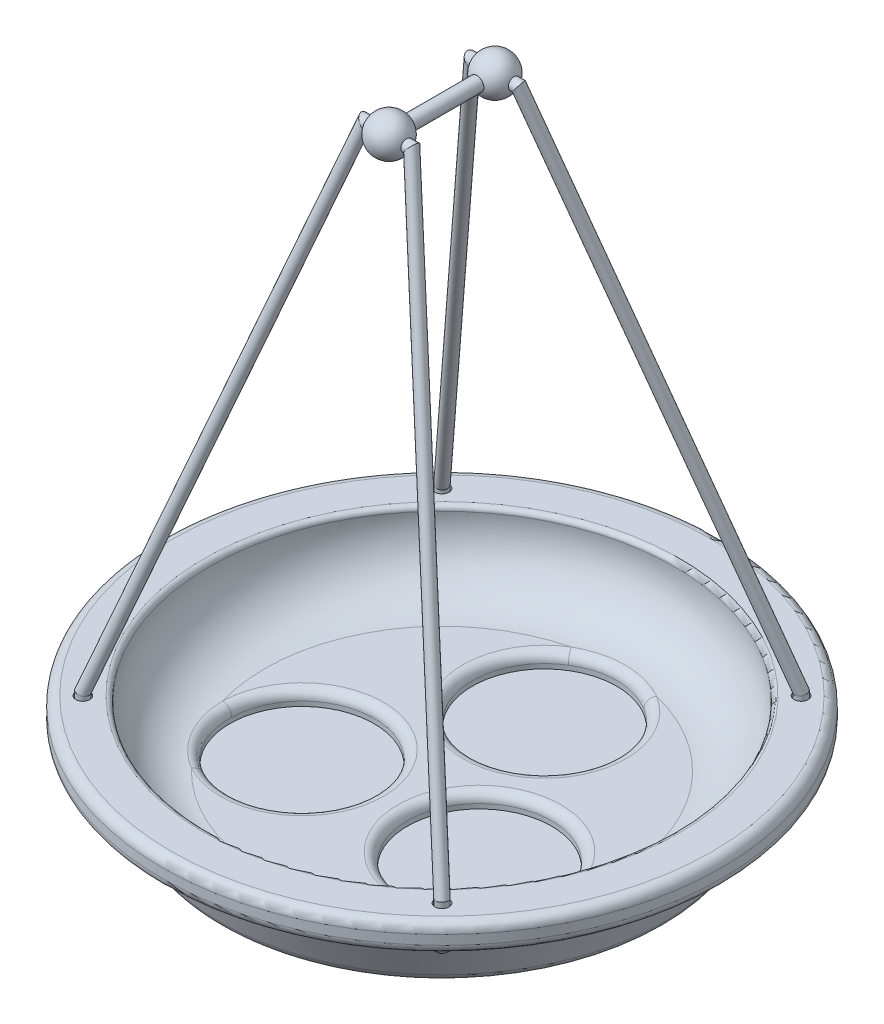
ISO-10303-21;
HEADER;
FILE_DESCRIPTION(('STEP AP214'),'2;1');
FILE_NAME('part.step','',(''),(''),'','','');
FILE_SCHEMA(('AUTOMOTIVE_DESIGN { 1 0 10303 214 1 1 1 1 }'));
ENDSEC;
DATA;
#1=APPLICATION_CONTEXT('core data for automotive mechanical design processes');
#2=APPLICATION_PROTOCOL_DEFINITION('international standard','automotive_design',2000,#1);
#3=PRODUCT_CONTEXT('',#1,'mechanical');
#4=PRODUCT('Part','Part','',(#3));
#5=PRODUCT_RELATED_PRODUCT_CATEGORY('part','',(#4));
#6=PRODUCT_DEFINITION_FORMATION('','',#4);
#7=PRODUCT_DEFINITION_CONTEXT('part definition',#1,'design');
#8=PRODUCT_DEFINITION('design','',#6,#7);
#9=PRODUCT_DEFINITION_SHAPE('','',#8);
#10=(LENGTH_UNIT() NAMED_UNIT(*) SI_UNIT(.MILLI.,.METRE.));
#11=(NAMED_UNIT(*) PLANE_ANGLE_UNIT() SI_UNIT($,.RADIAN.));
#12=(NAMED_UNIT(*) SI_UNIT($,.STERADIAN.) SOLID_ANGLE_UNIT());
#13=UNCERTAINTY_MEASURE_WITH_UNIT(LENGTH_MEASURE(1.E-05),#10,'distance_accuracy_value','');
#14=(GEOMETRIC_REPRESENTATION_CONTEXT(3) GLOBAL_UNCERTAINTY_ASSIGNED_CONTEXT((#13)) GLOBAL_UNIT_ASSIGNED_CONTEXT((#10,
#11,#12)) REPRESENTATION_CONTEXT('',''));
#15=CARTESIAN_POINT('',(0.,0.,0.));
#16=DIRECTION('',(0.,0.,1.));
#17=DIRECTION('',(1.,0.,0.));
#18=AXIS2_PLACEMENT_3D('',#15,#16,#17);
#19=CARTESIAN_POINT('',(-206.59355070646,181.364414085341,19.5));
#20=DIRECTION('',(0.,1.,0.));
#21=DIRECTION('',(1.,0.,0.));
#22=AXIS2_PLACEMENT_3D('',#19,#20,#21);
#23=PLANE('',#22);
#24=CARTESIAN_POINT('',(-206.59355070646,181.364414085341,19.5));
#25=DIRECTION('',(0.,-1.,0.));
#26=DIRECTION('',(1.,0.,0.));
#27=AXIS2_PLACEMENT_3D('',#24,#25,#26);
#28=CIRCLE('',#27,45.);
#29=CARTESIAN_POINT('',(-161.59355070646,181.364414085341,19.5));
#30=VERTEX_POINT('',#29);
#31=EDGE_CURVE('E159',#30,#30,#28,.T.);
#32=ORIENTED_EDGE('',*,*,#31,.T.);
#33=EDGE_LOOP('',(#32));
#34=FACE_BOUND('',#33,.T.);
#35=ADVANCED_FACE('F46',(#34),#23,.F.);
#36=CARTESIAN_POINT('',(-206.59355070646,184.364414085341,19.5));
#37=DIRECTION('',(0.,1.,0.));
#38=DIRECTION('',(1.,0.,0.));
#39=AXIS2_PLACEMENT_3D('',#36,#37,#38);
#40=TOROIDAL_SURFACE('',#39,45.,3.00000000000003);
#41=CARTESIAN_POINT('',(-206.59355070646,183.246964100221,19.5));
#42=DIRECTION('',(0.,-1.,0.));
#43=DIRECTION('',(1.,0.,0.));
#44=AXIS2_PLACEMENT_3D('',#41,#42,#43);
#45=CIRCLE('',#44,47.7841166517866);
#46=CARTESIAN_POINT('',(-158.809434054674,183.246964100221,19.5));
#47=VERTEX_POINT('',#46);
#48=EDGE_CURVE('E156',#47,#47,#45,.T.);
#49=ORIENTED_EDGE('',*,*,#48,.T.);
#50=EDGE_LOOP('',(#49));
#51=FACE_BOUND('',#50,.T.);
#52=ORIENTED_EDGE('',*,*,#31,.F.);
#53=EDGE_LOOP('',(#52));
#54=FACE_BOUND('',#53,.T.);
#55=ADVANCED_FACE('F347',(#51,#54),#40,.T.);
#56=CARTESIAN_POINT('',(-206.59355070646,183.246964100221,19.5));
#57=DIRECTION('',(0.,1.,0.));
#58=DIRECTION('',(1.,0.,0.));
#59=AXIS2_PLACEMENT_3D('',#56,#57,#58);
#60=CONICAL_SURFACE('',#59,47.7841166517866,0.381683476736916);
#61=CARTESIAN_POINT('',(-206.59355070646,194.109380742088,19.5));
#62=DIRECTION('',(0.,-1.,0.));
#63=DIRECTION('',(1.,0.,0.));
#64=AXIS2_PLACEMENT_3D('',#61,#62,#63);
#65=CIRCLE('',#64,52.1439222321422);
#66=CARTESIAN_POINT('',(-154.449628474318,194.109380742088,19.5));
#67=VERTEX_POINT('',#66);
#68=EDGE_CURVE('E153',#67,#67,#65,.T.);
#69=ORIENTED_EDGE('',*,*,#68,.T.);
#70=EDGE_LOOP('',(#69));
#71=FACE_BOUND('',#70,.T.);
#72=ORIENTED_EDGE('',*,*,#48,.F.);
#73=EDGE_LOOP('',(#72));
#74=FACE_BOUND('',#73,.T.);
#75=ADVANCED_FACE('F309',(#71,#74),#60,.T.);
#76=CARTESIAN_POINT('',(-206.59355070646,193.364414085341,19.5));
#77=DIRECTION('',(0.,1.,0.));
#78=DIRECTION('',(1.,0.,0.));
#79=AXIS2_PLACEMENT_3D('',#76,#77,#78);
#80=TOROIDAL_SURFACE('',#79,53.9999999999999,2.);
#81=CARTESIAN_POINT('',(-206.59355070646,195.364414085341,19.5));
#82=DIRECTION('',(0.,-1.,0.));
#83=DIRECTION('',(1.,0.,0.));
#84=AXIS2_PLACEMENT_3D('',#81,#82,#83);
#85=CIRCLE('',#84,53.9999999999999);
#86=CARTESIAN_POINT('',(-169.418076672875,195.364414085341,58.6661094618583));
#87=VERTEX_POINT('',#86);
#88=CARTESIAN_POINT('',(-243.769024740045,195.364414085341,58.6661094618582));
#89=VERTEX_POINT('',#88);
#90=EDGE_CURVE('E148',#87,#89,#85,.T.);
#91=ORIENTED_EDGE('',*,*,#90,.T.);
#92=CARTESIAN_POINT('',(-246.545980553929,194.109180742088,58.5347760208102));
#93=CARTESIAN_POINT('',(-246.560352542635,194.154789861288,58.4938684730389));
#94=CARTESIAN_POINT('',(-246.57308015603,194.200046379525,58.4520155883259));
#95=CARTESIAN_POINT('',(-246.594986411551,194.289741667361,58.3664442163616));
#96=CARTESIAN_POINT('',(-246.604161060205,194.334179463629,58.3227236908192));
#97=CARTESIAN_POINT('',(-246.626048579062,194.466715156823,58.1881553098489));
#98=CARTESIAN_POINT('',(-246.632861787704,194.553226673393,58.0946229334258));
#99=CARTESIAN_POINT('',(-246.628313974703,194.70463820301,57.9193361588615));
#100=CARTESIAN_POINT('',(-246.619977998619,194.770640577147,57.8384568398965));
#101=CARTESIAN_POINT('',(-246.588743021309,194.89605944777,57.6746608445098));
#102=CARTESIAN_POINT('',(-246.565894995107,194.955498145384,57.5917522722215));
#103=CARTESIAN_POINT('',(-246.51009502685,195.053933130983,57.4434914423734));
#104=CARTESIAN_POINT('',(-246.48025393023,195.094605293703,57.3780924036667));
#105=CARTESIAN_POINT('',(-246.4093040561,195.168835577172,57.2492818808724));
#106=CARTESIAN_POINT('',(-246.368196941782,195.20239474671,57.1858701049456));
#107=CARTESIAN_POINT('',(-246.274026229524,195.261054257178,57.0630355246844));
#108=CARTESIAN_POINT('',(-246.220857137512,195.286074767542,57.003654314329));
#109=CARTESIAN_POINT('',(-246.103670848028,195.325941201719,56.8927038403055));
#110=CARTESIAN_POINT('',(-246.039665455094,195.340798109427,56.8411261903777));
#111=CARTESIAN_POINT('',(-245.913148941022,195.358702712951,56.7555271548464));
#112=CARTESIAN_POINT('',(-245.851820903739,195.363173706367,56.7200369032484));
#113=CARTESIAN_POINT('',(-245.724682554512,195.36520204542,56.6580491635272));
#114=CARTESIAN_POINT('',(-245.658871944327,195.362758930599,56.6315522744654));
#115=CARTESIAN_POINT('',(-245.525651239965,195.352198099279,56.5885338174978));
#116=CARTESIAN_POINT('',(-245.458280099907,195.344166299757,56.5718681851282));
#117=CARTESIAN_POINT('',(-245.32251199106,195.323964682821,56.5480145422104));
#118=CARTESIAN_POINT('',(-245.254114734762,195.311793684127,56.5408292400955));
#119=CARTESIAN_POINT('',(-245.108835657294,195.28319022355,56.5355051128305));
#120=CARTESIAN_POINT('',(-245.031976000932,195.266413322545,56.5386268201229));
#121=CARTESIAN_POINT('',(-244.87976707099,195.231957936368,56.556498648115));
#122=CARTESIAN_POINT('',(-244.804419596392,195.214278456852,56.5712618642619));
#123=CARTESIAN_POINT('',(-244.647599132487,195.178425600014,56.614703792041));
#124=CARTESIAN_POINT('',(-244.566477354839,195.160447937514,56.6448408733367));
#125=CARTESIAN_POINT('',(-244.409850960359,195.129900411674,56.7191313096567));
#126=CARTESIAN_POINT('',(-244.334339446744,195.11732381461,56.7632670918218));
#127=CARTESIAN_POINT('',(-244.196214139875,195.100974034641,56.8612648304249));
#128=CARTESIAN_POINT('',(-244.133079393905,195.096677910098,56.9142997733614));
#129=CARTESIAN_POINT('',(-244.016376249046,195.096267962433,57.0300219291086));
#130=CARTESIAN_POINT('',(-243.962804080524,195.100150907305,57.0927053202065));
#131=CARTESIAN_POINT('',(-243.872227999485,195.114366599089,57.2180851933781));
#132=CARTESIAN_POINT('',(-243.834054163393,195.123949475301,57.2800341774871));
#133=CARTESIAN_POINT('',(-243.767282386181,195.147309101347,57.4081524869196));
#134=CARTESIAN_POINT('',(-243.738689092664,195.161087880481,57.474323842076));
#135=CARTESIAN_POINT('',(-243.689182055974,195.192284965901,57.6158215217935));
#136=CARTESIAN_POINT('',(-243.669215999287,195.209921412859,57.6914302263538));
#137=CARTESIAN_POINT('',(-243.641225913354,195.245321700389,57.8448444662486));
#138=CARTESIAN_POINT('',(-243.633211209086,195.263085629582,57.9226516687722));
#139=CARTESIAN_POINT('',(-243.629214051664,195.297957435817,58.0873776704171));
#140=CARTESIAN_POINT('',(-243.634586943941,195.314799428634,58.17439346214));
#141=CARTESIAN_POINT('',(-243.660624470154,195.342226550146,58.3471291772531));
#142=CARTESIAN_POINT('',(-243.681273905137,195.352817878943,58.4328503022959));
#143=CARTESIAN_POINT('',(-243.735060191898,195.364268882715,58.5924334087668));
#144=CARTESIAN_POINT('',(-243.766908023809,195.365917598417,58.6666688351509));
#145=CARTESIAN_POINT('',(-243.841940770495,195.359998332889,58.8087434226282));
#146=CARTESIAN_POINT('',(-243.885113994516,195.352439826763,58.8765890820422));
#147=CARTESIAN_POINT('',(-243.974217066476,195.329249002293,58.9948632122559));
#148=CARTESIAN_POINT('',(-244.01899960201,195.314836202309,59.0464072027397));
#149=CARTESIAN_POINT('',(-244.11367596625,195.279023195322,59.1417792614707));
#150=CARTESIAN_POINT('',(-244.1635707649,195.257621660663,59.1856058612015));
#151=CARTESIAN_POINT('',(-244.267503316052,195.208178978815,59.2657245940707));
#152=CARTESIAN_POINT('',(-244.321595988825,195.180033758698,59.3018799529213));
#153=CARTESIAN_POINT('',(-244.431514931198,195.118319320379,59.3658339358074));
#154=CARTESIAN_POINT('',(-244.487341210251,195.084750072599,59.3936325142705));
#155=CARTESIAN_POINT('',(-244.627185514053,194.995469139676,59.453154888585));
#156=CARTESIAN_POINT('',(-244.711512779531,194.937008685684,59.480039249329));
#157=CARTESIAN_POINT('',(-244.878672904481,194.812734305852,59.5184696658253));
#158=CARTESIAN_POINT('',(-244.961495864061,194.746884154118,59.5299362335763));
#159=CARTESIAN_POINT('',(-245.095306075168,194.63401320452,59.5378289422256));
#160=CARTESIAN_POINT('',(-245.147334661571,194.588422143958,59.5381024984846));
#161=CARTESIAN_POINT('',(-245.249637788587,194.49549636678,59.5334871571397));
#162=CARTESIAN_POINT('',(-245.29991117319,194.448160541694,59.5285949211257));
#163=CARTESIAN_POINT('',(-245.397810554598,194.352750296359,59.5141952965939));
#164=CARTESIAN_POINT('',(-245.445461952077,194.304692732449,59.5047469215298));
#165=CARTESIAN_POINT('',(-245.538561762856,194.207611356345,59.4816454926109));
#166=CARTESIAN_POINT('',(-245.58401352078,194.158589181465,59.4679990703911));
#167=CARTESIAN_POINT('',(-245.62832672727,194.109180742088,59.4524298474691));
#168=B_SPLINE_CURVE_WITH_KNOTS('',3,(#92,#93,#94,#95,#96,#97,#98,#99,#100,#101,#102,#103,#104,
#105,#106,#107,#108,#109,#110,#111,#112,#113,#114,#115,#116,#117,#118,#119,#120,#121,#122,#123,
#124,#125,#126,#127,#128,#129,#130,#131,#132,#133,#134,#135,#136,#137,#138,#139,#140,#141,#142,
#143,#144,#145,#146,#147,#148,#149,#150,#151,#152,#153,#154,#155,#156,#157,#158,#159,#160,#161,
#162,#163,#164,#165,#166,#167),.UNSPECIFIED.,.F.,.F.,(4,2,2,2,2,2,2,2,2,2,2,2,2,2,2,2,2,2,2,2,2,
2,2,2,2,2,2,2,2,2,2,2,2,2,2,2,2,4),(0.,0.1887183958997,0.377648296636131,0.758829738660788,
1.07201800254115,1.38411219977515,1.63096120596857,1.87777378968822,2.12683444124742,
2.37562550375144,2.58756325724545,2.79951512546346,3.0082785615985,3.21710162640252,
3.45236333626,3.68789006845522,3.95170500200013,4.21519006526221,4.46140673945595,
4.7075261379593,4.92679460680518,5.14616929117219,5.38571210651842,5.62544172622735,
5.89040581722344,6.15510664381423,6.3960188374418,6.63668331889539,6.84505332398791,
7.05346293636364,7.26532345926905,7.47718513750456,7.79365821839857,8.11175673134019,
8.31906707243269,8.52651147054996,8.73133831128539,8.93584323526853),.UNSPECIFIED.);
#169=CARTESIAN_POINT('',(-245.759660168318,195.364414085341,56.6754740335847));
#170=VERTEX_POINT('',#169);
#171=EDGE_CURVE('E290',#170,#89,#168,.T.);
#172=ORIENTED_EDGE('',*,*,#171,.F.);
#173=CARTESIAN_POINT('',(-245.759660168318,195.364414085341,-17.6754740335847));
#174=VERTEX_POINT('',#173);
#175=EDGE_CURVE('E146',#170,#174,#85,.T.);
#176=ORIENTED_EDGE('',*,*,#175,.T.);
#177=CARTESIAN_POINT('',(-245.62832672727,194.109180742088,-20.452429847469));
#178=CARTESIAN_POINT('',(-245.587419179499,194.154789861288,-20.4668018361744));
#179=CARTESIAN_POINT('',(-245.545566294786,194.200046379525,-20.4795294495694));
#180=CARTESIAN_POINT('',(-245.459994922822,194.289741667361,-20.5014357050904));
#181=CARTESIAN_POINT('',(-245.416274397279,194.334179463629,-20.5106103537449));
#182=CARTESIAN_POINT('',(-245.281706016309,194.466715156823,-20.5324978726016));
#183=CARTESIAN_POINT('',(-245.188173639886,194.553226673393,-20.5393110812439));
#184=CARTESIAN_POINT('',(-245.012886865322,194.70463820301,-20.5347632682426));
#185=CARTESIAN_POINT('',(-244.932007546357,194.770640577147,-20.5264272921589));
#186=CARTESIAN_POINT('',(-244.76821155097,194.89605944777,-20.4951923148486));
#187=CARTESIAN_POINT('',(-244.685302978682,194.955498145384,-20.4723442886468));
#188=CARTESIAN_POINT('',(-244.537042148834,195.053933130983,-20.41654432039));
#189=CARTESIAN_POINT('',(-244.471643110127,195.094605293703,-20.3867032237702));
#190=CARTESIAN_POINT('',(-244.342832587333,195.168835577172,-20.3157533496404));
#191=CARTESIAN_POINT('',(-244.279420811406,195.20239474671,-20.2746462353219));
#192=CARTESIAN_POINT('',(-244.156586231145,195.261054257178,-20.1804755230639));
#193=CARTESIAN_POINT('',(-244.097205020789,195.286074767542,-20.1273064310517));
#194=CARTESIAN_POINT('',(-243.986254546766,195.325941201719,-20.0101201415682));
#195=CARTESIAN_POINT('',(-243.934676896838,195.340798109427,-19.9461147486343));
#196=CARTESIAN_POINT('',(-243.849077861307,195.358702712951,-19.8195982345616));
#197=CARTESIAN_POINT('',(-243.813587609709,195.363173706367,-19.758270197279));
#198=CARTESIAN_POINT('',(-243.751599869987,195.36520204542,-19.631131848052));
#199=CARTESIAN_POINT('',(-243.725102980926,195.362758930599,-19.5653212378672));
#200=CARTESIAN_POINT('',(-243.682084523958,195.352198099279,-19.4321005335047));
#201=CARTESIAN_POINT('',(-243.665418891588,195.344166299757,-19.364729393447));
#202=CARTESIAN_POINT('',(-243.641565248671,195.323964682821,-19.2289612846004));
#203=CARTESIAN_POINT('',(-243.634379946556,195.311793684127,-19.1605640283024));
#204=CARTESIAN_POINT('',(-243.629055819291,195.28319022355,-19.0152849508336));
#205=CARTESIAN_POINT('',(-243.632177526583,195.266413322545,-18.938425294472));
#206=CARTESIAN_POINT('',(-243.650049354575,195.231957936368,-18.7862163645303));
#207=CARTESIAN_POINT('',(-243.664812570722,195.214278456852,-18.7108688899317));
#208=CARTESIAN_POINT('',(-243.708254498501,195.178425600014,-18.5540484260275));
#209=CARTESIAN_POINT('',(-243.738391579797,195.160447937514,-18.4729266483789));
#210=CARTESIAN_POINT('',(-243.812682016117,195.129900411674,-18.3163002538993));
#211=CARTESIAN_POINT('',(-243.856817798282,195.11732381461,-18.2407887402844));
#212=CARTESIAN_POINT('',(-243.954815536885,195.100974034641,-18.1026634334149));
#213=CARTESIAN_POINT('',(-244.007850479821,195.096677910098,-18.0395286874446));
#214=CARTESIAN_POINT('',(-244.123572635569,195.096267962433,-17.9228255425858));
#215=CARTESIAN_POINT('',(-244.186256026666,195.100150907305,-17.8692533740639));
#216=CARTESIAN_POINT('',(-244.311635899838,195.114366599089,-17.778677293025));
#217=CARTESIAN_POINT('',(-244.373584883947,195.123949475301,-17.7405034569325));
#218=CARTESIAN_POINT('',(-244.50170319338,195.147309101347,-17.6737316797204));
#219=CARTESIAN_POINT('',(-244.567874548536,195.161087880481,-17.6451383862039));
#220=CARTESIAN_POINT('',(-244.709372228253,195.192284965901,-17.5956313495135));
#221=CARTESIAN_POINT('',(-244.784980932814,195.209921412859,-17.575665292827));
#222=CARTESIAN_POINT('',(-244.938395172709,195.245321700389,-17.5476752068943));
#223=CARTESIAN_POINT('',(-245.016202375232,195.263085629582,-17.5396605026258));
#224=CARTESIAN_POINT('',(-245.180928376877,195.297957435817,-17.5356633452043));
#225=CARTESIAN_POINT('',(-245.2679441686,195.314799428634,-17.5410362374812));
#226=CARTESIAN_POINT('',(-245.440679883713,195.342226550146,-17.567073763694));
#227=CARTESIAN_POINT('',(-245.526401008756,195.352817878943,-17.587723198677));
#228=CARTESIAN_POINT('',(-245.685984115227,195.364268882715,-17.6415094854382));
#229=CARTESIAN_POINT('',(-245.760219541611,195.365917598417,-17.673357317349));
#230=CARTESIAN_POINT('',(-245.902294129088,195.359998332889,-17.7483900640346));
#231=CARTESIAN_POINT('',(-245.970139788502,195.352439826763,-17.7915632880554));
#232=CARTESIAN_POINT('',(-246.088413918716,195.329249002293,-17.8806663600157));
#233=CARTESIAN_POINT('',(-246.1399579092,195.314836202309,-17.9254488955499));
#234=CARTESIAN_POINT('',(-246.235329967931,195.279023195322,-18.0201252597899));
#235=CARTESIAN_POINT('',(-246.279156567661,195.257621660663,-18.07002005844));
#236=CARTESIAN_POINT('',(-246.359275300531,195.208178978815,-18.1739526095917));
#237=CARTESIAN_POINT('',(-246.395430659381,195.180033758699,-18.2280452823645));
#238=CARTESIAN_POINT('',(-246.459384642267,195.118319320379,-18.3379642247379));
#239=CARTESIAN_POINT('',(-246.48718322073,195.084750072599,-18.3937905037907));
#240=CARTESIAN_POINT('',(-246.546705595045,194.995469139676,-18.5336348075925));
#241=CARTESIAN_POINT('',(-246.573589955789,194.937008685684,-18.6179620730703));
#242=CARTESIAN_POINT('',(-246.612020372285,194.812734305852,-18.7851221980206));
#243=CARTESIAN_POINT('',(-246.623486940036,194.746884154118,-18.8679451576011));
#244=CARTESIAN_POINT('',(-246.631379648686,194.63401320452,-19.0017553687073));
#245=CARTESIAN_POINT('',(-246.631653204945,194.588422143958,-19.0537839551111));
#246=CARTESIAN_POINT('',(-246.6270378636,194.49549636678,-19.1560870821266));
#247=CARTESIAN_POINT('',(-246.622145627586,194.448160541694,-19.2063604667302));
#248=CARTESIAN_POINT('',(-246.607746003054,194.352750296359,-19.3042598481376));
#249=CARTESIAN_POINT('',(-246.59829762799,194.304692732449,-19.351911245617));
#250=CARTESIAN_POINT('',(-246.575196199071,194.207611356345,-19.4450110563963));
#251=CARTESIAN_POINT('',(-246.561549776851,194.158589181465,-19.4904628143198));
#252=CARTESIAN_POINT('',(-246.545980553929,194.109180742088,-19.5347760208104));
#253=B_SPLINE_CURVE_WITH_KNOTS('',3,(#177,#178,#179,#180,#181,#182,#183,#184,#185,#186,#187,
#188,#189,#190,#191,#192,#193,#194,#195,#196,#197,#198,#199,#200,#201,#202,#203,#204,#205,#206,
#207,#208,#209,#210,#211,#212,#213,#214,#215,#216,#217,#218,#219,#220,#221,#222,#223,#224,#225,
#226,#227,#228,#229,#230,#231,#232,#233,#234,#235,#236,#237,#238,#239,#240,#241,#242,#243,#244,
#245,#246,#247,#248,#249,#250,#251,#252),.UNSPECIFIED.,.F.,.F.,(4,2,2,2,2,2,2,2,2,2,2,2,2,2,2,2,
2,2,2,2,2,2,2,2,2,2,2,2,2,2,2,2,2,2,2,2,2,4),(0.,0.188718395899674,0.377648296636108,
0.758829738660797,1.07201800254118,1.38411219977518,1.63096120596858,1.87777378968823,
2.12683444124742,2.37562550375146,2.58756325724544,2.79951512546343,3.0082785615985,
3.2171016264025,3.45236333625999,3.68789006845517,3.95170500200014,4.21519006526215,
4.46140673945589,4.70752613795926,4.92679460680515,5.14616929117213,5.38571210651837,
5.62544172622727,5.89040581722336,6.15510664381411,6.39601883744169,6.63668331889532,
6.84505332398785,7.05346293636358,7.265323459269,7.4771851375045,7.79365821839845,
8.11175673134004,8.3190670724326,8.52651147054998,8.7313383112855,8.93584323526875),.UNSPECIFIED.);
#254=CARTESIAN_POINT('',(-243.769024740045,195.364414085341,-19.6661094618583));
#255=VERTEX_POINT('',#254);
#256=EDGE_CURVE('E145',#255,#174,#253,.T.);
#257=ORIENTED_EDGE('',*,*,#256,.F.);
#258=CARTESIAN_POINT('',(-169.418076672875,195.364414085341,-19.6661094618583));
#259=VERTEX_POINT('',#258);
#260=EDGE_CURVE('E130',#255,#259,#85,.T.);
#261=ORIENTED_EDGE('',*,*,#260,.T.);
#262=CARTESIAN_POINT('',(-166.641120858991,194.109180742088,-19.5347760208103));
#263=CARTESIAN_POINT('',(-166.626748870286,194.154789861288,-19.493868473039));
#264=CARTESIAN_POINT('',(-166.614021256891,194.200046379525,-19.452015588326));
#265=CARTESIAN_POINT('',(-166.59211500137,194.289741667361,-19.3664442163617));
#266=CARTESIAN_POINT('',(-166.582940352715,194.334179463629,-19.3227236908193));
#267=CARTESIAN_POINT('',(-166.561052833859,194.466715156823,-19.188155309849));
#268=CARTESIAN_POINT('',(-166.554239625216,194.553226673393,-19.0946229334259));
#269=CARTESIAN_POINT('',(-166.558787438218,194.70463820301,-18.9193361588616));
#270=CARTESIAN_POINT('',(-166.567123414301,194.770640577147,-18.8384568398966));
#271=CARTESIAN_POINT('',(-166.598358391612,194.89605944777,-18.6746608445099));
#272=CARTESIAN_POINT('',(-166.621206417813,194.955498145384,-18.5917522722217));
#273=CARTESIAN_POINT('',(-166.67700638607,195.053933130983,-18.4434914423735));
#274=CARTESIAN_POINT('',(-166.70684748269,195.094605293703,-18.3780924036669));
#275=CARTESIAN_POINT('',(-166.77779735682,195.168835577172,-18.2492818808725));
#276=CARTESIAN_POINT('',(-166.818904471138,195.20239474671,-18.1858701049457));
#277=CARTESIAN_POINT('',(-166.913075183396,195.261054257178,-18.0630355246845));
#278=CARTESIAN_POINT('',(-166.966244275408,195.286074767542,-18.0036543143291));
#279=CARTESIAN_POINT('',(-167.083430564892,195.325941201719,-17.8927038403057));
#280=CARTESIAN_POINT('',(-167.147435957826,195.340798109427,-17.8411261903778));
#281=CARTESIAN_POINT('',(-167.273952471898,195.358702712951,-17.7555271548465));
#282=CARTESIAN_POINT('',(-167.335280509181,195.363173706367,-17.7200369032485));
#283=CARTESIAN_POINT('',(-167.462418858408,195.36520204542,-17.6580491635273));
#284=CARTESIAN_POINT('',(-167.528229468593,195.362758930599,-17.6315522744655));
#285=CARTESIAN_POINT('',(-167.661450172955,195.352198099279,-17.5885338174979));
#286=CARTESIAN_POINT('',(-167.728821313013,195.344166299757,-17.5718681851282));
#287=CARTESIAN_POINT('',(-167.86458942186,195.323964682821,-17.5480145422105));
#288=CARTESIAN_POINT('',(-167.932986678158,195.311793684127,-17.5408292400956));
#289=CARTESIAN_POINT('',(-168.078265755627,195.28319022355,-17.5355051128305));
#290=CARTESIAN_POINT('',(-168.155125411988,195.266413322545,-17.538626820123));
#291=CARTESIAN_POINT('',(-168.30733434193,195.231957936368,-17.556498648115));
#292=CARTESIAN_POINT('',(-168.382681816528,195.214278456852,-17.5712618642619));
#293=CARTESIAN_POINT('',(-168.539502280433,195.178425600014,-17.614703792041));
#294=CARTESIAN_POINT('',(-168.620624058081,195.160447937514,-17.6448408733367));
#295=CARTESIAN_POINT('',(-168.777250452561,195.129900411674,-17.7191313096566));
#296=CARTESIAN_POINT('',(-168.852761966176,195.11732381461,-17.7632670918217));
#297=CARTESIAN_POINT('',(-168.990887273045,195.100974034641,-17.8612648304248));
#298=CARTESIAN_POINT('',(-169.054022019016,195.096677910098,-17.9142997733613));
#299=CARTESIAN_POINT('',(-169.170725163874,195.096267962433,-18.0300219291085));
#300=CARTESIAN_POINT('',(-169.224297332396,195.100150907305,-18.0927053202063));
#301=CARTESIAN_POINT('',(-169.314873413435,195.114366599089,-18.2180851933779));
#302=CARTESIAN_POINT('',(-169.353047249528,195.123949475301,-18.280034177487));
#303=CARTESIAN_POINT('',(-169.41981902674,195.147309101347,-18.4081524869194));
#304=CARTESIAN_POINT('',(-169.448412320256,195.161087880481,-18.4743238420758));
#305=CARTESIAN_POINT('',(-169.497919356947,195.192284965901,-18.6158215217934));
#306=CARTESIAN_POINT('',(-169.517885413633,195.209921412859,-18.6914302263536));
#307=CARTESIAN_POINT('',(-169.545875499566,195.245321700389,-18.8448444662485));
#308=CARTESIAN_POINT('',(-169.553890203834,195.263085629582,-18.922651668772));
#309=CARTESIAN_POINT('',(-169.557887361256,195.297957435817,-19.0873776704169));
#310=CARTESIAN_POINT('',(-169.552514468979,195.314799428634,-19.1743934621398));
#311=CARTESIAN_POINT('',(-169.526476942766,195.342226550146,-19.3471291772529));
#312=CARTESIAN_POINT('',(-169.505827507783,195.352817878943,-19.4328503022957));
#313=CARTESIAN_POINT('',(-169.452041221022,195.364268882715,-19.5924334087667));
#314=CARTESIAN_POINT('',(-169.420193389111,195.365917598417,-19.6666688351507));
#315=CARTESIAN_POINT('',(-169.345160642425,195.359998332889,-19.808743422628));
#316=CARTESIAN_POINT('',(-169.301987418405,195.352439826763,-19.8765890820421));
#317=CARTESIAN_POINT('',(-169.212884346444,195.329249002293,-19.9948632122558));
#318=CARTESIAN_POINT('',(-169.16810181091,195.314836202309,-20.0464072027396));
#319=CARTESIAN_POINT('',(-169.07342544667,195.279023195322,-20.1417792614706));
#320=CARTESIAN_POINT('',(-169.02353064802,195.257621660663,-20.1856058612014));
#321=CARTESIAN_POINT('',(-168.919598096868,195.208178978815,-20.2657245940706));
#322=CARTESIAN_POINT('',(-168.865505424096,195.180033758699,-20.3018799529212));
#323=CARTESIAN_POINT('',(-168.755586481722,195.118319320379,-20.3658339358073));
#324=CARTESIAN_POINT('',(-168.699760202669,195.084750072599,-20.3936325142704));
#325=CARTESIAN_POINT('',(-168.559915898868,194.995469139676,-20.453154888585));
#326=CARTESIAN_POINT('',(-168.47558863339,194.937008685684,-20.480039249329));
#327=CARTESIAN_POINT('',(-168.30842850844,194.812734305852,-20.5184696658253));
#328=CARTESIAN_POINT('',(-168.225605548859,194.746884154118,-20.5299362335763));
#329=CARTESIAN_POINT('',(-168.091795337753,194.63401320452,-20.5378289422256));
#330=CARTESIAN_POINT('',(-168.039766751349,194.588422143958,-20.5381024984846));
#331=CARTESIAN_POINT('',(-167.937463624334,194.49549636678,-20.5334871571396));
#332=CARTESIAN_POINT('',(-167.88719023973,194.448160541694,-20.5285949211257));
#333=CARTESIAN_POINT('',(-167.789290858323,194.352750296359,-20.5141952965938));
#334=CARTESIAN_POINT('',(-167.741639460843,194.304692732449,-20.5047469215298));
#335=CARTESIAN_POINT('',(-167.648539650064,194.207611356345,-20.4816454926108));
#336=CARTESIAN_POINT('',(-167.60308789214,194.158589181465,-20.4679990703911));
#337=CARTESIAN_POINT('',(-167.55877468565,194.109180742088,-20.452429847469));
#338=B_SPLINE_CURVE_WITH_KNOTS('',3,(#262,#263,#264,#265,#266,#267,#268,#269,#270,#271,#272,
#273,#274,#275,#276,#277,#278,#279,#280,#281,#282,#283,#284,#285,#286,#287,#288,#289,#290,#291,
#292,#293,#294,#295,#296,#297,#298,#299,#300,#301,#302,#303,#304,#305,#306,#307,#308,#309,#310,
#311,#312,#313,#314,#315,#316,#317,#318,#319,#320,#321,#322,#323,#324,#325,#326,#327,#328,#329,
#330,#331,#332,#333,#334,#335,#336,#337),.UNSPECIFIED.,.F.,.F.,(4,2,2,2,2,2,2,2,2,2,2,2,2,2,2,2,
2,2,2,2,2,2,2,2,2,2,2,2,2,2,2,2,2,2,2,2,2,4),(0.,0.188718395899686,0.377648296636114,
0.758829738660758,1.07201800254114,1.38411219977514,1.63096120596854,1.87777378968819,
2.12683444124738,2.37562550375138,2.58756325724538,2.7995151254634,3.00827856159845,
3.21710162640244,3.45236333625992,3.6878900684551,3.95170500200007,4.21519006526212,
4.46140673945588,4.70752613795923,4.92679460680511,5.1461692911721,5.38571210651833,
5.62544172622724,5.89040581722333,6.1551066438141,6.39601883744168,6.63668331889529,
6.84505332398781,7.05346293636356,7.26532345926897,7.47718513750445,7.79365821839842,
8.11175673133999,8.31906707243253,8.52651147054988,8.73133831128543,8.93584323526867),.UNSPECIFIED.);
#339=CARTESIAN_POINT('',(-167.427441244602,195.364414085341,-17.6754740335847));
#340=VERTEX_POINT('',#339);
#341=EDGE_CURVE('E135',#340,#259,#338,.T.);
#342=ORIENTED_EDGE('',*,*,#341,.F.);
#343=CARTESIAN_POINT('',(-167.427441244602,195.364414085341,56.6754740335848));
#344=VERTEX_POINT('',#343);
#345=EDGE_CURVE('E133',#340,#344,#85,.T.);
#346=ORIENTED_EDGE('',*,*,#345,.T.);
#347=CARTESIAN_POINT('',(-167.55877468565,194.109180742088,59.452429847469));
#348=CARTESIAN_POINT('',(-167.599682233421,194.154789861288,59.4668018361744));
#349=CARTESIAN_POINT('',(-167.641535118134,194.200046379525,59.4795294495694));
#350=CARTESIAN_POINT('',(-167.727106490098,194.289741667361,59.5014357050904));
#351=CARTESIAN_POINT('',(-167.770827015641,194.334179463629,59.5106103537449));
#352=CARTESIAN_POINT('',(-167.905395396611,194.466715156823,59.5324978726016));
#353=CARTESIAN_POINT('',(-167.998927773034,194.553226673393,59.5393110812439));
#354=CARTESIAN_POINT('',(-168.174214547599,194.70463820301,59.5347632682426));
#355=CARTESIAN_POINT('',(-168.255093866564,194.770640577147,59.5264272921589));
#356=CARTESIAN_POINT('',(-168.41888986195,194.89605944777,59.4951923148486));
#357=CARTESIAN_POINT('',(-168.501798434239,194.955498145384,59.4723442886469));
#358=CARTESIAN_POINT('',(-168.650059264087,195.053933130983,59.4165443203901));
#359=CARTESIAN_POINT('',(-168.715458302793,195.094605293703,59.3867032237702));
#360=CARTESIAN_POINT('',(-168.844268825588,195.168835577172,59.3157533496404));
#361=CARTESIAN_POINT('',(-168.907680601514,195.20239474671,59.274646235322));
#362=CARTESIAN_POINT('',(-169.030515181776,195.261054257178,59.1804755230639));
#363=CARTESIAN_POINT('',(-169.089896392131,195.286074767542,59.1273064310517));
#364=CARTESIAN_POINT('',(-169.200846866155,195.325941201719,59.0101201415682));
#365=CARTESIAN_POINT('',(-169.252424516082,195.340798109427,58.9461147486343));
#366=CARTESIAN_POINT('',(-169.338023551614,195.358702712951,58.8195982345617));
#367=CARTESIAN_POINT('',(-169.373513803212,195.363173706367,58.758270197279));
#368=CARTESIAN_POINT('',(-169.435501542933,195.36520204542,58.631131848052));
#369=CARTESIAN_POINT('',(-169.461998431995,195.362758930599,58.5653212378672));
#370=CARTESIAN_POINT('',(-169.505016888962,195.352198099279,58.4321005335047));
#371=CARTESIAN_POINT('',(-169.521682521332,195.344166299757,58.364729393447));
#372=CARTESIAN_POINT('',(-169.54553616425,195.323964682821,58.2289612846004));
#373=CARTESIAN_POINT('',(-169.552721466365,195.311793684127,58.1605640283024));
#374=CARTESIAN_POINT('',(-169.55804559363,195.28319022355,58.0152849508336));
#375=CARTESIAN_POINT('',(-169.554923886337,195.266413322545,57.938425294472));
#376=CARTESIAN_POINT('',(-169.537052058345,195.231957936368,57.7862163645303));
#377=CARTESIAN_POINT('',(-169.522288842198,195.214278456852,57.7108688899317));
#378=CARTESIAN_POINT('',(-169.478846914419,195.178425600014,57.5540484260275));
#379=CARTESIAN_POINT('',(-169.448709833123,195.160447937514,57.4729266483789));
#380=CARTESIAN_POINT('',(-169.374419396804,195.129900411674,57.3163002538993));
#381=CARTESIAN_POINT('',(-169.330283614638,195.11732381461,57.2407887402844));
#382=CARTESIAN_POINT('',(-169.232285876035,195.100974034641,57.1026634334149));
#383=CARTESIAN_POINT('',(-169.179250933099,195.096677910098,57.0395286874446));
#384=CARTESIAN_POINT('',(-169.063528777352,195.096267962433,56.9228255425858));
#385=CARTESIAN_POINT('',(-169.000845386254,195.100150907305,56.8692533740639));
#386=CARTESIAN_POINT('',(-168.875465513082,195.114366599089,56.7786772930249));
#387=CARTESIAN_POINT('',(-168.813516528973,195.123949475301,56.7405034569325));
#388=CARTESIAN_POINT('',(-168.685398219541,195.147309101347,56.6737316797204));
#389=CARTESIAN_POINT('',(-168.619226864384,195.161087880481,56.6451383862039));
#390=CARTESIAN_POINT('',(-168.477729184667,195.192284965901,56.5956313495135));
#391=CARTESIAN_POINT('',(-168.402120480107,195.209921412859,56.575665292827));
#392=CARTESIAN_POINT('',(-168.248706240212,195.245321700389,56.5476752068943));
#393=CARTESIAN_POINT('',(-168.170899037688,195.263085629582,56.5396605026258));
#394=CARTESIAN_POINT('',(-168.006173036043,195.297957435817,56.5356633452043));
#395=CARTESIAN_POINT('',(-167.91915724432,195.314799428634,56.5410362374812));
#396=CARTESIAN_POINT('',(-167.746421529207,195.342226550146,56.567073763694));
#397=CARTESIAN_POINT('',(-167.660700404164,195.352817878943,56.5877231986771));
#398=CARTESIAN_POINT('',(-167.501117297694,195.364268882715,56.6415094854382));
#399=CARTESIAN_POINT('',(-167.426881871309,195.365917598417,56.673357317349));
#400=CARTESIAN_POINT('',(-167.284807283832,195.359998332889,56.7483900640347));
#401=CARTESIAN_POINT('',(-167.216961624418,195.352439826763,56.7915632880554));
#402=CARTESIAN_POINT('',(-167.098687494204,195.329249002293,56.8806663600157));
#403=CARTESIAN_POINT('',(-167.047143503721,195.314836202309,56.9254488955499));
#404=CARTESIAN_POINT('',(-166.95177144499,195.279023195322,57.0201252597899));
#405=CARTESIAN_POINT('',(-166.907944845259,195.257621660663,57.0700200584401));
#406=CARTESIAN_POINT('',(-166.82782611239,195.208178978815,57.1739526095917));
#407=CARTESIAN_POINT('',(-166.791670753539,195.180033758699,57.2280452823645));
#408=CARTESIAN_POINT('',(-166.727716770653,195.118319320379,57.3379642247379));
#409=CARTESIAN_POINT('',(-166.69991819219,195.084750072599,57.3937905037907));
#410=CARTESIAN_POINT('',(-166.640395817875,194.995469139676,57.5336348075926));
#411=CARTESIAN_POINT('',(-166.613511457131,194.937008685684,57.6179620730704));
#412=CARTESIAN_POINT('',(-166.575081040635,194.812734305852,57.7851221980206));
#413=CARTESIAN_POINT('',(-166.563614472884,194.746884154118,57.8679451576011));
#414=CARTESIAN_POINT('',(-166.555721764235,194.63401320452,58.0017553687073));
#415=CARTESIAN_POINT('',(-166.555448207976,194.588422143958,58.0537839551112));
#416=CARTESIAN_POINT('',(-166.560063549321,194.49549636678,58.1560870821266));
#417=CARTESIAN_POINT('',(-166.564955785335,194.448160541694,58.2063604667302));
#418=CARTESIAN_POINT('',(-166.579355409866,194.352750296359,58.3042598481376));
#419=CARTESIAN_POINT('',(-166.58880378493,194.304692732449,58.3519112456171));
#420=CARTESIAN_POINT('',(-166.611905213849,194.207611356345,58.4450110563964));
#421=CARTESIAN_POINT('',(-166.625551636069,194.158589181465,58.4904628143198));
#422=CARTESIAN_POINT('',(-166.641120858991,194.109180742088,58.5347760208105));
#423=B_SPLINE_CURVE_WITH_KNOTS('',3,(#347,#348,#349,#350,#351,#352,#353,#354,#355,#356,#357,
#358,#359,#360,#361,#362,#363,#364,#365,#366,#367,#368,#369,#370,#371,#372,#373,#374,#375,#376,
#377,#378,#379,#380,#381,#382,#383,#384,#385,#386,#387,#388,#389,#390,#391,#392,#393,#394,#395,
#396,#397,#398,#399,#400,#401,#402,#403,#404,#405,#406,#407,#408,#409,#410,#411,#412,#413,#414,
#415,#416,#417,#418,#419,#420,#421,#422),.UNSPECIFIED.,.F.,.F.,(4,2,2,2,2,2,2,2,2,2,2,2,2,2,2,2,
2,2,2,2,2,2,2,2,2,2,2,2,2,2,2,2,2,2,2,2,2,4),(0.,0.188718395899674,0.377648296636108,
0.758829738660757,1.07201800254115,1.38411219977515,1.63096120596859,1.87777378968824,
2.12683444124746,2.37562550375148,2.58756325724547,2.79951512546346,3.00827856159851,
3.21710162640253,3.45236333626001,3.68789006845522,3.95170500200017,4.21519006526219,
4.46140673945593,4.70752613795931,4.92679460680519,5.1461692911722,5.38571210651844,
5.62544172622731,5.8904058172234,6.15510664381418,6.39601883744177,6.63668331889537,
6.84505332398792,7.05346293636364,7.26532345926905,7.47718513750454,7.7936582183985,
8.11175673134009,8.31906707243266,8.52651147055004,8.73133831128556,8.93584323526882),.UNSPECIFIED.);
#424=EDGE_CURVE('E284',#87,#344,#423,.T.);
#425=ORIENTED_EDGE('',*,*,#424,.F.);
#426=EDGE_LOOP('',(#91,#172,#176,#257,#261,#342,#346,#425));
#427=FACE_BOUND('',#426,.T.);
#428=ORIENTED_EDGE('',*,*,#68,.F.);
#429=EDGE_LOOP('',(#428));
#430=FACE_BOUND('',#429,.T.);
#431=ADVANCED_FACE('F142',(#427,#430),#80,.F.);
#432=CARTESIAN_POINT('',(-260.59355070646,195.364414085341,19.5));
#433=DIRECTION('',(0.,1.,0.));
#434=DIRECTION('',(1.,0.,0.));
#435=AXIS2_PLACEMENT_3D('',#432,#433,#434);
#436=PLANE('',#435);
#437=CARTESIAN_POINT('',(-206.59355070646,195.364414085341,19.5));
#438=DIRECTION('',(0.,-1.,0.));
#439=DIRECTION('',(1.,0.,0.));
#440=AXIS2_PLACEMENT_3D('',#437,#438,#439);
#441=CIRCLE('',#440,57.9999999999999);
#442=CARTESIAN_POINT('',(-148.59355070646,195.364414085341,19.5));
#443=VERTEX_POINT('',#442);
#444=EDGE_CURVE('E149',#443,#443,#441,.T.);
#445=ORIENTED_EDGE('',*,*,#444,.T.);
#446=EDGE_LOOP('',(#445));
#447=FACE_BOUND('',#446,.T.);
#448=ORIENTED_EDGE('',*,*,#345,.F.);
#449=CARTESIAN_POINT('',(-168.056231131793,195.364414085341,-19.0373195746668));
#450=DIRECTION('',(0.,-1.,0.));
#451=DIRECTION('',(1.,0.,0.));
#452=AXIS2_PLACEMENT_3D('',#449,#450,#451);
#453=CIRCLE('',#452,1.5);
#454=EDGE_CURVE('E67',#259,#340,#453,.T.);
#455=ORIENTED_EDGE('',*,*,#454,.F.);
#456=ORIENTED_EDGE('',*,*,#260,.F.);
#457=CARTESIAN_POINT('',(-245.130870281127,195.364414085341,-19.0373195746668));
#458=DIRECTION('',(0.,-1.,0.));
#459=DIRECTION('',(1.,0.,0.));
#460=AXIS2_PLACEMENT_3D('',#457,#458,#459);
#461=CIRCLE('',#460,1.5);
#462=EDGE_CURVE('E74',#174,#255,#461,.T.);
#463=ORIENTED_EDGE('',*,*,#462,.F.);
#464=ORIENTED_EDGE('',*,*,#175,.F.);
#465=CARTESIAN_POINT('',(-245.130870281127,195.364414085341,58.0373195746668));
#466=DIRECTION('',(0.,-1.,0.));
#467=DIRECTION('',(1.,0.,0.));
#468=AXIS2_PLACEMENT_3D('',#465,#466,#467);
#469=CIRCLE('',#468,1.50000000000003);
#470=EDGE_CURVE('E332',#89,#170,#469,.T.);
#471=ORIENTED_EDGE('',*,*,#470,.F.);
#472=ORIENTED_EDGE('',*,*,#90,.F.);
#473=CARTESIAN_POINT('',(-168.056231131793,195.364414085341,58.0373195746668));
#474=DIRECTION('',(0.,-1.,0.));
#475=DIRECTION('',(1.,0.,0.));
#476=AXIS2_PLACEMENT_3D('',#473,#474,#475);
#477=CIRCLE('',#476,1.5);
#478=EDGE_CURVE('E286',#344,#87,#477,.T.);
#479=ORIENTED_EDGE('',*,*,#478,.F.);
#480=EDGE_LOOP('',(#448,#455,#456,#463,#464,#471,#472,#479));
#481=FACE_BOUND('',#480,.T.);
#482=ADVANCED_FACE('F128',(#447,#481),#436,.F.);
#483=CARTESIAN_POINT('',(-206.59355070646,197.364414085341,19.5));
#484=DIRECTION('',(0.,1.,0.));
#485=DIRECTION('',(1.,0.,0.));
#486=AXIS2_PLACEMENT_3D('',#483,#484,#485);
#487=TOROIDAL_SURFACE('',#486,57.9999999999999,2.00000000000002);
#488=CARTESIAN_POINT('',(-206.59355070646,197.364414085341,19.5));
#489=DIRECTION('',(0.,-1.,0.));
#490=DIRECTION('',(1.,0.,0.));
#491=AXIS2_PLACEMENT_3D('',#488,#489,#490);
#492=CIRCLE('',#491,59.9999999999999);
#493=CARTESIAN_POINT('',(-146.59355070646,197.364414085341,19.5));
#494=VERTEX_POINT('',#493);
#495=EDGE_CURVE('E601',#494,#494,#492,.T.);
#496=ORIENTED_EDGE('',*,*,#495,.T.);
#497=EDGE_LOOP('',(#496));
#498=FACE_BOUND('',#497,.T.);
#499=ORIENTED_EDGE('',*,*,#444,.F.);
#500=EDGE_LOOP('',(#499));
#501=FACE_BOUND('',#500,.T.);
#502=ADVANCED_FACE('F376',(#498,#501),#487,.T.);
#503=CARTESIAN_POINT('',(-206.59355070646,311.364414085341,19.5));
#504=DIRECTION('',(0.,1.,0.));
#505=DIRECTION('',(1.,0.,0.));
#506=AXIS2_PLACEMENT_3D('',#503,#504,#505);
#507=CYLINDRICAL_SURFACE('',#506,59.9999999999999);
#508=CARTESIAN_POINT('',(-206.59355070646,199.364414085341,19.5));
#509=DIRECTION('',(0.,-1.,0.));
#510=DIRECTION('',(1.,0.,0.));
#511=AXIS2_PLACEMENT_3D('',#508,#509,#510);
#512=CIRCLE('',#511,59.9999999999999);
#513=CARTESIAN_POINT('',(-146.59355070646,199.364414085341,19.5));
#514=VERTEX_POINT('',#513);
#515=EDGE_CURVE('E598',#514,#514,#512,.T.);
#516=ORIENTED_EDGE('',*,*,#515,.T.);
#517=EDGE_LOOP('',(#516));
#518=FACE_BOUND('',#517,.T.);
#519=ORIENTED_EDGE('',*,*,#495,.F.);
#520=EDGE_LOOP('',(#519));
#521=FACE_BOUND('',#520,.T.);
#522=ADVANCED_FACE('F384',(#518,#521),#507,.T.);
#523=CARTESIAN_POINT('',(-206.59355070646,199.364414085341,19.5));
#524=DIRECTION('',(0.,1.,0.));
#525=DIRECTION('',(1.,0.,0.));
#526=AXIS2_PLACEMENT_3D('',#523,#524,#525);
#527=TOROIDAL_SURFACE('',#526,57.9999999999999,1.99999999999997);
#528=CARTESIAN_POINT('',(-206.59355070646,201.364414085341,19.5));
#529=DIRECTION('',(0.,-1.,0.));
#530=DIRECTION('',(1.,0.,0.));
#531=AXIS2_PLACEMENT_3D('',#528,#529,#530);
#532=CIRCLE('',#531,57.9999999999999);
#533=CARTESIAN_POINT('',(-148.59355070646,201.364414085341,19.5));
#534=VERTEX_POINT('',#533);
#535=EDGE_CURVE('E597',#534,#534,#532,.T.);
#536=ORIENTED_EDGE('',*,*,#535,.T.);
#537=EDGE_LOOP('',(#536));
#538=FACE_BOUND('',#537,.T.);
#539=ORIENTED_EDGE('',*,*,#515,.F.);
#540=EDGE_LOOP('',(#539));
#541=FACE_BOUND('',#540,.T.);
#542=ADVANCED_FACE('F392',(#538,#541),#527,.T.);
#543=CARTESIAN_POINT('',(-264.59355070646,201.364414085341,19.5));
#544=DIRECTION('',(0.,-1.,0.));
#545=DIRECTION('',(-1.,0.,0.));
#546=AXIS2_PLACEMENT_3D('',#543,#544,#545);
#547=PLANE('',#546);
#548=CARTESIAN_POINT('',(-168.056231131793,201.364414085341,58.0373195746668));
#549=DIRECTION('',(0.,-1.,0.));
#550=DIRECTION('',(1.,0.,0.));
#551=AXIS2_PLACEMENT_3D('',#548,#549,#550);
#552=CIRCLE('',#551,1.5);
#553=CARTESIAN_POINT('',(-166.556231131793,201.364414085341,58.0373195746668));
#554=VERTEX_POINT('',#553);
#555=EDGE_CURVE('E573',#554,#554,#552,.T.);
#556=ORIENTED_EDGE('',*,*,#555,.T.);
#557=EDGE_LOOP('',(#556));
#558=FACE_BOUND('',#557,.T.);
#559=CARTESIAN_POINT('',(-245.130870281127,201.364414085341,58.0373195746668));
#560=DIRECTION('',(0.,-1.,0.));
#561=DIRECTION('',(1.,0.,0.));
#562=AXIS2_PLACEMENT_3D('',#559,#560,#561);
#563=CIRCLE('',#562,1.50000000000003);
#564=CARTESIAN_POINT('',(-243.630870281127,201.364414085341,58.0373195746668));
#565=VERTEX_POINT('',#564);
#566=EDGE_CURVE('E578',#565,#565,#563,.T.);
#567=ORIENTED_EDGE('',*,*,#566,.T.);
#568=EDGE_LOOP('',(#567));
#569=FACE_BOUND('',#568,.T.);
#570=CARTESIAN_POINT('',(-245.130870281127,201.364414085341,-19.0373195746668));
#571=DIRECTION('',(0.,-1.,0.));
#572=DIRECTION('',(1.,0.,0.));
#573=AXIS2_PLACEMENT_3D('',#570,#571,#572);
#574=CIRCLE('',#573,1.5);
#575=CARTESIAN_POINT('',(-243.630870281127,201.364414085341,-19.0373195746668));
#576=VERTEX_POINT('',#575);
#577=EDGE_CURVE('E581',#576,#576,#574,.T.);
#578=ORIENTED_EDGE('',*,*,#577,.T.);
#579=EDGE_LOOP('',(#578));
#580=FACE_BOUND('',#579,.T.);
#581=CARTESIAN_POINT('',(-168.056231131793,201.364414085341,-19.0373195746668));
#582=DIRECTION('',(0.,-1.,0.));
#583=DIRECTION('',(1.,0.,0.));
#584=AXIS2_PLACEMENT_3D('',#581,#582,#583);
#585=CIRCLE('',#584,1.5);
#586=CARTESIAN_POINT('',(-166.556231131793,201.364414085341,-19.0373195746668));
#587=VERTEX_POINT('',#586);
#588=EDGE_CURVE('E136',#587,#587,#585,.T.);
#589=ORIENTED_EDGE('',*,*,#588,.T.);
#590=EDGE_LOOP('',(#589));
#591=FACE_BOUND('',#590,.T.);
#592=CARTESIAN_POINT('',(-206.59355070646,201.364414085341,19.5));
#593=DIRECTION('',(0.,-1.,0.));
#594=DIRECTION('',(1.,0.,0.));
#595=AXIS2_PLACEMENT_3D('',#592,#593,#594);
#596=CIRCLE('',#595,50.9970370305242);
#597=CARTESIAN_POINT('',(-155.596513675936,201.364414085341,19.5));
#598=VERTEX_POINT('',#597);
#599=EDGE_CURVE('E594',#598,#598,#596,.T.);
#600=ORIENTED_EDGE('',*,*,#599,.T.);
#601=EDGE_LOOP('',(#600));
#602=FACE_BOUND('',#601,.T.);
#603=ORIENTED_EDGE('',*,*,#535,.F.);
#604=EDGE_LOOP('',(#603));
#605=FACE_BOUND('',#604,.T.);
#606=ADVANCED_FACE('F401',(#558,#569,#580,#591,#602,#605),#547,.F.);
#607=CARTESIAN_POINT('',(-206.59355070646,200.364414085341,19.5));
#608=DIRECTION('',(0.,1.,0.));
#609=DIRECTION('',(1.,0.,0.));
#610=AXIS2_PLACEMENT_3D('',#607,#608,#609);
#611=TOROIDAL_SURFACE('',#610,50.9970370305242,1.);
#612=CARTESIAN_POINT('',(-206.59355070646,200.287491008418,19.5));
#613=DIRECTION('',(0.,-1.,0.));
#614=DIRECTION('',(1.,0.,0.));
#615=AXIS2_PLACEMENT_3D('',#612,#613,#614);
#616=CIRCLE('',#615,49.9999999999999);
#617=CARTESIAN_POINT('',(-156.59355070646,200.287491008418,19.5));
#618=VERTEX_POINT('',#617);
#619=EDGE_CURVE('E603',#618,#618,#616,.T.);
#620=ORIENTED_EDGE('',*,*,#619,.T.);
#621=EDGE_LOOP('',(#620));
#622=FACE_BOUND('',#621,.T.);
#623=ORIENTED_EDGE('',*,*,#599,.F.);
#624=EDGE_LOOP('',(#623));
#625=FACE_BOUND('',#624,.T.);
#626=ADVANCED_FACE('F410',(#622,#625),#611,.T.);
#627=CARTESIAN_POINT('',(-206.59355070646,199.364414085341,19.5));
#628=DIRECTION('',(0.,1.,0.));
#629=DIRECTION('',(1.,0.,0.));
#630=AXIS2_PLACEMENT_3D('',#627,#628,#629);
#631=TOROIDAL_SURFACE('',#630,38.0355556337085,12.);
#632=CARTESIAN_POINT('',(-206.59355070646,187.364414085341,19.5));
#633=DIRECTION('',(0.,-1.,0.));
#634=DIRECTION('',(1.,0.,0.));
#635=AXIS2_PLACEMENT_3D('',#632,#633,#634);
#636=CIRCLE('',#635,38.0355556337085);
#637=CARTESIAN_POINT('',(-179.193749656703,187.364414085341,45.8809475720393));
#638=VERTEX_POINT('',#637);
#639=CARTESIAN_POINT('',(-233.993351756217,187.364414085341,45.8809475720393));
#640=VERTEX_POINT('',#639);
#641=EDGE_CURVE('E614',#638,#640,#636,.T.);
#642=ORIENTED_EDGE('',*,*,#641,.T.);
#643=CARTESIAN_POINT('',(-228.284038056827,185.54072470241,45.7738774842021));
#644=CARTESIAN_POINT('',(-228.4550100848,187.835642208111,45.7443491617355));
#645=CARTESIAN_POINT('',(-228.819017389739,187.5155374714,47.9941894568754));
#646=CARTESIAN_POINT('',(-228.698701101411,185.504855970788,45.7023223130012));
#647=CARTESIAN_POINT('',(-228.841014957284,187.771558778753,45.6730945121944));
#648=CARTESIAN_POINT('',(-229.270406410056,187.48479284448,47.8858664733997));
#649=CARTESIAN_POINT('',(-229.110826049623,185.47600354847,45.6136976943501));
#650=CARTESIAN_POINT('',(-229.231309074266,187.714672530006,45.5856719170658));
#651=CARTESIAN_POINT('',(-229.718849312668,187.460062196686,47.7599861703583));
#652=CARTESIAN_POINT('',(-229.926850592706,185.429710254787,45.4030957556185));
#653=CARTESIAN_POINT('',(-230.009216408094,187.614450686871,45.378821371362));
#654=CARTESIAN_POINT('',(-230.60662168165,187.420382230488,47.4739668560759));
#655=CARTESIAN_POINT('',(-230.330752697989,185.41226584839,45.2811287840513));
#656=CARTESIAN_POINT('',(-230.397232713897,187.570878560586,45.2597436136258));
#657=CARTESIAN_POINT('',(-231.045953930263,187.405429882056,47.313838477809));
#658=CARTESIAN_POINT('',(-231.127033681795,185.386161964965,45.0047251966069));
#659=CARTESIAN_POINT('',(-231.166340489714,187.495149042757,44.9894112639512));
#660=CARTESIAN_POINT('',(-231.912121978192,187.383055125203,46.9602926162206));
#661=CARTESIAN_POINT('',(-231.519423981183,185.377493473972,44.8503220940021));
#662=CARTESIAN_POINT('',(-231.547932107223,187.462798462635,44.8384450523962));
#663=CARTESIAN_POINT('',(-232.338970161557,187.375624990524,46.7669095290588));
#664=CARTESIAN_POINT('',(-232.290403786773,185.36661925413,44.5100283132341));
#665=CARTESIAN_POINT('',(-232.300810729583,187.407340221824,44.5047369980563));
#666=CARTESIAN_POINT('',(-233.177896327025,187.366304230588,46.3478378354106));
#667=CARTESIAN_POINT('',(-232.668992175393,185.364414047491,44.3241350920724));
#668=CARTESIAN_POINT('',(-232.672657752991,187.38409802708,44.3221465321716));
#669=CARTESIAN_POINT('',(-233.589973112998,187.364414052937,46.1221466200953));
#670=CARTESIAN_POINT('',(-233.422218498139,185.364414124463,43.9153592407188));
#671=CARTESIAN_POINT('',(-233.414674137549,187.344270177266,43.9194527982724));
#672=CARTESIAN_POINT('',(-234.41028735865,187.364414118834,45.6316421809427));
#673=CARTESIAN_POINT('',(-233.796296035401,185.366770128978,43.6914434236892));
#674=CARTESIAN_POINT('',(-233.785139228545,187.327823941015,43.6982803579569));
#675=CARTESIAN_POINT('',(-234.817930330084,187.366433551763,45.3657690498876));
#676=CARTESIAN_POINT('',(-234.524255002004,185.374220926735,43.2129174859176));
#677=CARTESIAN_POINT('',(-234.50769693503,187.300819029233,43.2242947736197));
#678=CARTESIAN_POINT('',(-235.611932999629,187.372819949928,44.802525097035));
#679=CARTESIAN_POINT('',(-234.878135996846,185.379315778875,42.9583067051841));
#680=CARTESIAN_POINT('',(-234.86045728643,187.290191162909,42.9714152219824));
#681=CARTESIAN_POINT('',(-235.998292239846,187.377186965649,44.5051535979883));
#682=CARTESIAN_POINT('',(-235.563161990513,185.390569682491,42.4202244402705));
#683=CARTESIAN_POINT('',(-235.544293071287,187.273162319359,42.4358182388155));
#684=CARTESIAN_POINT('',(-236.74716824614,187.386833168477,43.8807777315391));
#685=CARTESIAN_POINT('',(-235.8943091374,185.396728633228,42.1367556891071));
#686=CARTESIAN_POINT('',(-235.876023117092,187.266718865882,42.1529205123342));
#687=CARTESIAN_POINT('',(-237.109687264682,187.392112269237,43.5537761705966));
#688=CARTESIAN_POINT('',(-236.53156048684,185.408746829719,41.5429449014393));
#689=CARTESIAN_POINT('',(-236.514848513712,187.256687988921,41.5593875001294));
#690=CARTESIAN_POINT('',(-237.808565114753,187.402413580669,42.8721484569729));
#691=CARTESIAN_POINT('',(-236.837664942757,185.414606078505,41.2326031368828));
#692=CARTESIAN_POINT('',(-236.822559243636,187.253077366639,41.2484579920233));
#693=CARTESIAN_POINT('',(-238.144924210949,187.407435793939,42.5175225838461));
#694=CARTESIAN_POINT('',(-237.422600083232,185.424981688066,40.5873120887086));
#695=CARTESIAN_POINT('',(-237.410601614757,187.247660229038,40.601354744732));
#696=CARTESIAN_POINT('',(-238.789232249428,187.416329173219,41.7829448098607));
#697=CARTESIAN_POINT('',(-237.701436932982,185.429498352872,40.2523683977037));
#698=CARTESIAN_POINT('',(-237.691496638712,187.245842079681,40.264790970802));
#699=CARTESIAN_POINT('',(-239.09718761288,187.420200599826,41.4029986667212));
#700=CARTESIAN_POINT('',(-238.229936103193,185.436484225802,39.5601831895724));
#701=CARTESIAN_POINT('',(-238.223621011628,187.243292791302,39.5690491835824));
#702=CARTESIAN_POINT('',(-239.682782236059,187.426188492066,40.6201026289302));
#703=CARTESIAN_POINT('',(-238.479598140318,185.438953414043,39.2029414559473));
#704=CARTESIAN_POINT('',(-238.475333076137,187.242557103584,39.2093853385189));
#705=CARTESIAN_POINT('',(-239.960421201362,187.428304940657,40.2171525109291));
#706=CARTESIAN_POINT('',(-238.948095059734,185.4414842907,38.4685011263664));
#707=CARTESIAN_POINT('',(-238.947180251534,187.241806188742,38.4701774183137));
#708=CARTESIAN_POINT('',(-240.483732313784,187.430474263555,39.3905872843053));
#709=CARTESIAN_POINT('',(-239.166912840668,185.441544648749,38.0912916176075));
#710=CARTESIAN_POINT('',(-239.167692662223,187.24179018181,38.0900608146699));
#711=CARTESIAN_POINT('',(-240.7293867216,187.430525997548,38.9669608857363));
#712=CARTESIAN_POINT('',(-239.571989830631,185.439245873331,37.319800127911));
#713=CARTESIAN_POINT('',(-239.575275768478,187.242468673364,37.3132872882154));
#714=CARTESIAN_POINT('',(-241.186966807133,187.428555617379,38.1019766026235));
#715=CARTESIAN_POINT('',(-239.758250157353,185.436886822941,36.9255187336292));
#716=CARTESIAN_POINT('',(-239.762641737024,187.243164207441,36.9160106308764));
#717=CARTESIAN_POINT('',(-241.398893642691,187.426533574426,37.6606193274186));
#718=CARTESIAN_POINT('',(-240.096873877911,185.430094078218,36.1227369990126));
#719=CARTESIAN_POINT('',(-240.102594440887,187.245608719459,36.1082700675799));
#720=CARTESIAN_POINT('',(-241.787664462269,187.420711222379,36.7630544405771));
#721=CARTESIAN_POINT('',(-240.249241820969,185.425660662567,35.7142385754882));
#722=CARTESIAN_POINT('',(-240.255370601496,187.247361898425,35.697147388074));
#723=CARTESIAN_POINT('',(-241.964513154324,187.416911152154,36.3068488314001));
#724=CARTESIAN_POINT('',(-240.519032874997,185.415409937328,34.8858734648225));
#725=CARTESIAN_POINT('',(-240.525234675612,187.252608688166,34.865098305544));
#726=CARTESIAN_POINT('',(-242.28207015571,187.408124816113,35.3824539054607));
#727=CARTESIAN_POINT('',(-240.636456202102,185.409592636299,34.4660068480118));
#728=CARTESIAN_POINT('',(-240.64239274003,187.256113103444,34.4434908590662));
#729=CARTESIAN_POINT('',(-242.422778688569,187.403138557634,34.9142646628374));
#730=CARTESIAN_POINT('',(-240.835355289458,185.397612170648,33.6186391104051));
#731=CARTESIAN_POINT('',(-240.840305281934,187.265867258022,33.5947647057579));
#732=CARTESIAN_POINT('',(-242.666998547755,187.39286958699,33.9697459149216));
#733=CARTESIAN_POINT('',(-240.916893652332,185.391449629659,33.191152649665));
#734=CARTESIAN_POINT('',(-240.921077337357,187.272134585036,33.16697526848));
#735=CARTESIAN_POINT('',(-242.770574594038,187.387587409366,33.4934321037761));
#736=CARTESIAN_POINT('',(-241.043714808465,185.380112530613,32.3310038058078));
#737=CARTESIAN_POINT('',(-241.046351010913,187.288722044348,32.3089004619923));
#738=CARTESIAN_POINT('',(-242.940243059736,187.377869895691,32.5350817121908));
#739=CARTESIAN_POINT('',(-241.089016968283,185.374937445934,31.8983443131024));
#740=CARTESIAN_POINT('',(-241.09071121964,187.299080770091,31.8779594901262));
#741=CARTESIAN_POINT('',(-243.006355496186,187.373434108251,32.0530483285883));
#742=CARTESIAN_POINT('',(-241.130324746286,185.36904999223,31.2359505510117));
#743=CARTESIAN_POINT('',(-241.130971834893,187.319160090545,31.2219718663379));
#744=CARTESIAN_POINT('',(-243.078497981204,187.368387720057,31.314852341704));
#745=CARTESIAN_POINT('',(-241.139510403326,185.367384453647,31.0069730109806));
#746=CARTESIAN_POINT('',(-241.139854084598,187.326902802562,30.9950715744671));
#747=CARTESIAN_POINT('',(-243.098156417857,187.366960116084,31.059632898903));
#748=CARTESIAN_POINT('',(-241.147722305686,185.365067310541,30.5490272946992));
#749=CARTESIAN_POINT('',(-241.147714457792,187.344217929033,30.5421711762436));
#750=CARTESIAN_POINT('',(-243.126960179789,187.364973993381,30.5490806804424));
#751=CARTESIAN_POINT('',(-241.146757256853,185.364414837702,30.3200592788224));
#752=CARTESIAN_POINT('',(-241.146653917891,187.353801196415,30.3160851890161));
#753=CARTESIAN_POINT('',(-243.136114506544,187.364414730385,30.2937481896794));
#754=CARTESIAN_POINT('',(-241.129643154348,185.364412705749,29.6715407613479));
#755=CARTESIAN_POINT('',(-241.129750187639,187.38402216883,29.6757041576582));
#756=CARTESIAN_POINT('',(-243.147187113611,187.364412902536,29.5703142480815));
#757=CARTESIAN_POINT('',(-241.101506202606,185.366602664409,29.2522437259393));
#758=CARTESIAN_POINT('',(-241.102123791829,187.407166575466,29.2638634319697));
#759=CARTESIAN_POINT('',(-243.136710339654,187.36629001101,29.102293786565));
#760=CARTESIAN_POINT('',(-241.011279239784,185.377393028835,28.417186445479));
#761=CARTESIAN_POINT('',(-241.01521976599,187.46237162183,28.4476799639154));
#762=CARTESIAN_POINT('',(-243.080628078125,187.375538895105,28.1693364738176));
#763=CARTESIAN_POINT('',(-240.949170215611,185.385997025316,28.0014283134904));
#764=CARTESIAN_POINT('',(-240.955515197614,187.494570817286,28.0429403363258));
#765=CARTESIAN_POINT('',(-243.035002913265,187.382913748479,27.7044014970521));
#766=CARTESIAN_POINT('',(-240.790808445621,185.411989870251,27.1732862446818));
#767=CARTESIAN_POINT('',(-240.805436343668,187.570176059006,27.2412879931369));
#768=CARTESIAN_POINT('',(-242.90853075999,187.405193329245,26.7771394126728));
#769=CARTESIAN_POINT('',(-240.694293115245,185.429446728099,26.760953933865));
#770=CARTESIAN_POINT('',(-240.714360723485,187.613847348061,26.8441913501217));
#771=CARTESIAN_POINT('',(-242.827411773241,187.42015635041,26.3148609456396));
#772=CARTESIAN_POINT('',(-240.468108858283,185.475826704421,25.9461467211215));
#773=CARTESIAN_POINT('',(-240.504013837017,187.714325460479,26.064362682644));
#774=CARTESIAN_POINT('',(-242.630774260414,187.459910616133,25.3998735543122));
#775=CARTESIAN_POINT('',(-240.338449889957,185.504746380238,25.5436688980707));
#776=CARTESIAN_POINT('',(-240.384249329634,187.771363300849,25.681442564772));
#777=CARTESIAN_POINT('',(-242.515266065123,187.484698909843,24.9471617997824));
#778=CARTESIAN_POINT('',(-240.192639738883,185.54072470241,25.1475743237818));
#779=CARTESIAN_POINT('',(-240.252553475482,187.835642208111,25.310404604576));
#780=CARTESIAN_POINT('',(-242.382975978,187.5155374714,24.5007240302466));
#781=(BOUNDED_SURFACE() B_SPLINE_SURFACE(3,2,((#643,#644,#645),(#646,#647,#648),(#649,#650,
#651),(#652,#653,#654),(#655,#656,#657),(#658,#659,#660),(#661,#662,#663),(#664,#665,#666),
(#667,#668,#669),(#670,#671,#672),(#673,#674,#675),(#676,#677,#678),(#679,#680,#681),(#682,#683,
#684),(#685,#686,#687),(#688,#689,#690),(#691,#692,#693),(#694,#695,#696),(#697,#698,#699),
(#700,#701,#702),(#703,#704,#705),(#706,#707,#708),(#709,#710,#711),(#712,#713,#714),(#715,#716,
#717),(#718,#719,#720),(#721,#722,#723),(#724,#725,#726),(#727,#728,#729),(#730,#731,#732),
(#733,#734,#735),(#736,#737,#738),(#739,#740,#741),(#742,#743,#744),(#745,#746,#747),(#748,#749,
#750),(#751,#752,#753),(#754,#755,#756),(#757,#758,#759),(#760,#761,#762),(#763,#764,#765),
(#766,#767,#768),(#769,#770,#771),(#772,#773,#774),(#775,#776,#777),(#778,#779,#780)),
.UNSPECIFIED.,.F.,.F.,.F.) B_SPLINE_SURFACE_WITH_KNOTS((4,2,2,2,2,2,2,2,2,2,2,2,2,2,2,2,2,2,2,2,
2,2,4),(3,3),(0.,1.42876521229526,2.85708747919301,4.28394118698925,5.71091017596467,
7.18583748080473,8.66079650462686,10.1356159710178,11.6104205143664,13.0848908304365,
14.5593754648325,16.0346744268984,17.5099227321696,18.984972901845,20.4600139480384,
21.9324714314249,23.4041414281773,24.1801261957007,24.9554454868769,26.3771345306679,
27.7996200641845,29.2332027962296,30.6663553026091),(0.,1.),
.UNSPECIFIED.) GEOMETRIC_REPRESENTATION_ITEM() RATIONAL_B_SPLINE_SURFACE(((1.,0.655940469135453,
1.),(1.,0.660883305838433,1.),(1.,0.665692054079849,1.),(1.,0.674985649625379,1.),(1.,
0.679470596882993,1.),(1.,0.688059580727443,1.),(1.,0.692164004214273,1.),(1.,0.699956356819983,
1.),(1.,0.703644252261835,1.),(1.,0.71068568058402,1.),(1.,0.714023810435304,1.),(1.,
0.720188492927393,1.),(1.,0.723015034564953,1.),(1.,0.728132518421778,1.),(1.,0.730423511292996,
1.),(1.,0.734451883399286,1.),(1.,0.736189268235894,1.),(1.,0.73909666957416,1.),(1.,
0.740266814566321,1.),(1.,0.742031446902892,1.),(1.,0.742625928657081,1.),(1.,0.743234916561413,
1.),(1.,0.743249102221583,1.),(1.,0.742696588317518,1.),(1.,0.742129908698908,1.),(1.,
0.740420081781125,1.),(1.,0.739277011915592,1.),(1.,0.736423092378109,1.),(1.,0.734712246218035,
1.),(1.,0.730739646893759,1.),(1.,0.728478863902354,1.),(1.,0.723423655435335,1.),(1.,
0.720629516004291,1.),(1.,0.715973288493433,1.),(1.,0.714294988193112,1.),(1.,0.71080221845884,
1.),(1.,0.708987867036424,1.),(1.,0.703657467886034,1.),(1.,0.699983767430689,1.),(1.,
0.692220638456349,1.),(1.,0.688130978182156,1.),(1.,0.679544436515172,1.),(1.,0.675044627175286,
1.),(1.,0.665721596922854,1.),(1.,0.660898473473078,1.),(1.,0.655940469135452,1.))) REPRESENTATION_ITEM('') SURFACE());
#782=CARTESIAN_POINT('',(-242.382975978,187.5155374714,24.5007240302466));
#783=CARTESIAN_POINT('',(-242.515266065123,187.484698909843,24.9471617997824));
#784=CARTESIAN_POINT('',(-242.630774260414,187.459910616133,25.3998735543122));
#785=CARTESIAN_POINT('',(-242.827411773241,187.42015635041,26.3148609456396));
#786=CARTESIAN_POINT('',(-242.90853075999,187.405193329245,26.7771394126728));
#787=CARTESIAN_POINT('',(-243.035002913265,187.382913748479,27.7044014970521));
#788=CARTESIAN_POINT('',(-243.080628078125,187.375538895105,28.1693364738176));
#789=CARTESIAN_POINT('',(-243.136710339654,187.36629001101,29.102293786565));
#790=CARTESIAN_POINT('',(-243.147187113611,187.364412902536,29.5703142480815));
#791=CARTESIAN_POINT('',(-243.136114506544,187.364414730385,30.2937481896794));
#792=CARTESIAN_POINT('',(-243.126960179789,187.364973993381,30.5490806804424));
#793=CARTESIAN_POINT('',(-243.098156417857,187.366960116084,31.059632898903));
#794=CARTESIAN_POINT('',(-243.078497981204,187.368387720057,31.314852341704));
#795=CARTESIAN_POINT('',(-243.006355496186,187.373434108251,32.0530483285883));
#796=CARTESIAN_POINT('',(-242.940243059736,187.377869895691,32.5350817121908));
#797=CARTESIAN_POINT('',(-242.770574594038,187.387587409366,33.4934321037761));
#798=CARTESIAN_POINT('',(-242.666998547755,187.39286958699,33.9697459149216));
#799=CARTESIAN_POINT('',(-242.422778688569,187.403138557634,34.9142646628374));
#800=CARTESIAN_POINT('',(-242.28207015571,187.408124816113,35.3824539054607));
#801=CARTESIAN_POINT('',(-241.964513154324,187.416911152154,36.3068488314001));
#802=CARTESIAN_POINT('',(-241.787664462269,187.420711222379,36.7630544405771));
#803=CARTESIAN_POINT('',(-241.398893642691,187.426533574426,37.6606193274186));
#804=CARTESIAN_POINT('',(-241.186966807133,187.428555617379,38.1019766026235));
#805=CARTESIAN_POINT('',(-240.7293867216,187.430525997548,38.9669608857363));
#806=CARTESIAN_POINT('',(-240.483732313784,187.430474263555,39.3905872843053));
#807=CARTESIAN_POINT('',(-239.960421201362,187.428304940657,40.2171525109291));
#808=CARTESIAN_POINT('',(-239.682782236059,187.426188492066,40.6201026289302));
#809=CARTESIAN_POINT('',(-239.09718761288,187.420200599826,41.4029986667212));
#810=CARTESIAN_POINT('',(-238.789232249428,187.416329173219,41.7829448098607));
#811=CARTESIAN_POINT('',(-238.144924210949,187.407435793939,42.5175225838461));
#812=CARTESIAN_POINT('',(-237.808565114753,187.402413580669,42.8721484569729));
#813=CARTESIAN_POINT('',(-237.109687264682,187.392112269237,43.5537761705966));
#814=CARTESIAN_POINT('',(-236.74716824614,187.386833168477,43.8807777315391));
#815=CARTESIAN_POINT('',(-235.998292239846,187.377186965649,44.5051535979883));
#816=CARTESIAN_POINT('',(-235.611932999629,187.372819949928,44.802525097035));
#817=CARTESIAN_POINT('',(-234.817930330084,187.366433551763,45.3657690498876));
#818=CARTESIAN_POINT('',(-234.41028735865,187.364414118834,45.6316421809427));
#819=CARTESIAN_POINT('',(-233.589973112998,187.364414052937,46.1221466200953));
#820=CARTESIAN_POINT('',(-233.177896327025,187.366304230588,46.3478378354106));
#821=CARTESIAN_POINT('',(-232.338970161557,187.375624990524,46.7669095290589));
#822=CARTESIAN_POINT('',(-231.912121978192,187.383055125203,46.9602926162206));
#823=CARTESIAN_POINT('',(-231.045953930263,187.405429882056,47.313838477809));
#824=CARTESIAN_POINT('',(-230.60662168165,187.420382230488,47.4739668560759));
#825=CARTESIAN_POINT('',(-229.718849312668,187.460062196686,47.7599861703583));
#826=CARTESIAN_POINT('',(-229.270406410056,187.48479284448,47.8858664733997));
#827=CARTESIAN_POINT('',(-228.819017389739,187.5155374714,47.9941894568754));
#828=B_SPLINE_CURVE_WITH_KNOTS('',3,(#782,#783,#784,#785,#786,#787,#788,#789,#790,#791,#792,
#793,#794,#795,#796,#797,#798,#799,#800,#801,#802,#803,#804,#805,#806,#807,#808,#809,#810,#811,
#812,#813,#814,#815,#816,#817,#818,#819,#820,#821,#822,#823,#824,#825,#826,#827),.UNSPECIFIED.,
.F.,.F.,(4,2,2,2,2,2,2,2,2,2,2,2,2,2,2,2,2,2,2,2,2,2,4),(0.,1.43315250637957,2.86673523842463,
4.28922077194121,5.71090981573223,6.48622910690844,7.26221387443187,8.73388387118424,
10.2063413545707,11.6813824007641,13.1564325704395,14.6316808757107,16.1069798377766,
17.5814644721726,19.0559347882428,20.5307393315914,22.0055587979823,23.4805178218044,
24.9554451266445,26.3824141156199,27.8092678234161,29.2375900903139,30.6663553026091),.UNSPECIFIED.);
#829=CARTESIAN_POINT('',(-243.14002200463,187.364414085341,30.0384499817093));
#830=VERTEX_POINT('',#829);
#831=EDGE_CURVE('E638',#830,#640,#828,.T.);
#832=ORIENTED_EDGE('',*,*,#831,.F.);
#833=CARTESIAN_POINT('',(-215.740220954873,187.364414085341,-17.4193975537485));
#834=VERTEX_POINT('',#833);
#835=EDGE_CURVE('E618',#830,#834,#636,.T.);
#836=ORIENTED_EDGE('',*,*,#835,.T.);
#837=CARTESIAN_POINT('',(-218.502152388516,185.54072470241,-12.4214518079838));
#838=CARTESIAN_POINT('',(-218.391094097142,187.835642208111,-12.5547537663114));
#839=CARTESIAN_POINT('',(-220.157509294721,187.5155374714,-13.9949134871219));
#840=CARTESIAN_POINT('',(-218.232852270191,185.504855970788,-12.7447829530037));
#841=CARTESIAN_POINT('',(-218.136383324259,187.771558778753,-12.8534164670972));
#842=CARTESIAN_POINT('',(-219.838004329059,187.48479284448,-14.3316663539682));
#843=CARTESIAN_POINT('',(-217.950038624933,185.47600354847,-13.0573813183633));
#844=CARTESIAN_POINT('',(-217.865526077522,187.714672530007,-13.1477097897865));
#845=CARTESIAN_POINT('',(-219.504767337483,187.460062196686,-14.6570891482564));
#846=CARTESIAN_POINT('',(-217.359639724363,185.429710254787,-13.6587783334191));
#847=CARTESIAN_POINT('',(-217.297434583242,187.614450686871,-13.7179720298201));
#848=CARTESIAN_POINT('',(-218.813181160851,187.420382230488,-15.282912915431));
#849=CARTESIAN_POINT('',(-217.052062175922,185.41226584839,-13.9475843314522));
#850=CARTESIAN_POINT('',(-217.000302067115,187.570878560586,-13.9944651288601));
#851=CARTESIAN_POINT('',(-218.454839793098,187.405429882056,-15.5833216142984));
#852=CARTESIAN_POINT('',(-216.414549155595,185.386161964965,-14.4989820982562));
#853=CARTESIAN_POINT('',(-216.381633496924,187.495149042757,-14.5253658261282));
#854=CARTESIAN_POINT('',(-217.715576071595,187.383055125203,-16.156672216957));
#855=CARTESIAN_POINT('',(-216.084636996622,185.377493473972,-14.7616005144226));
#856=CARTESIAN_POINT('',(-216.06009711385,187.462798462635,-14.780350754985));
#857=CARTESIAN_POINT('',(-217.334677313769,187.375624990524,-16.4296420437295));
#858=CARTESIAN_POINT('',(-215.404444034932,185.36661925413,-15.2591417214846));
#859=CARTESIAN_POINT('',(-215.394658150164,187.407340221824,-15.2655087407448));
#860=CARTESIAN_POINT('',(-216.552287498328,187.366304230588,-16.9466375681));
#861=CARTESIAN_POINT('',(-215.054161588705,185.364414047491,-15.4940622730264));
#862=CARTESIAN_POINT('',(-215.050606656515,187.38409802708,-15.4962424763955));
#863=CARTESIAN_POINT('',(-216.150794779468,187.364414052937,-17.1906609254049));
#864=CARTESIAN_POINT('',(-214.323538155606,185.364414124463,-15.9419874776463));
#865=CARTESIAN_POINT('',(-214.330855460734,187.344270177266,-15.9375006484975));
#866=CARTESIAN_POINT('',(-215.315848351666,187.364414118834,-17.6558216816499));
#867=CARTESIAN_POINT('',(-213.942582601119,185.366770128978,-16.1539902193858));
#868=CARTESIAN_POINT('',(-213.954081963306,187.327823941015,-16.1477466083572));
#869=CARTESIAN_POINT('',(-214.881773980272,187.366433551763,-17.8759142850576));
#870=CARTESIAN_POINT('',(-213.164187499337,185.374220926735,-16.5451582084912));
#871=CARTESIAN_POINT('',(-213.182319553,187.300819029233,-16.5365071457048));
#872=CARTESIAN_POINT('',(-213.996989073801,187.372819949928,-18.28191879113));
#873=CARTESIAN_POINT('',(-212.766747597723,185.379315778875,-16.7243227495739));
#874=CARTESIAN_POINT('',(-212.786939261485,187.290191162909,-16.7155667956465));
#875=CARTESIAN_POINT('',(-213.546278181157,187.377186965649,-18.4678299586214));
#876=CARTESIAN_POINT('',(-211.958241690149,185.390569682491,-17.048531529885));
#877=CARTESIAN_POINT('',(-211.981180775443,187.273162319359,-17.039987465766));
#878=CARTESIAN_POINT('',(-212.631114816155,187.386833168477,-18.8041876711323));
#879=CARTESIAN_POINT('',(-211.547176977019,185.396728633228,-17.1935789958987));
#880=CARTESIAN_POINT('',(-211.570319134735,187.266718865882,-17.1858252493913));
#881=CARTESIAN_POINT('',(-212.166663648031,187.392112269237,-18.9546375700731));
#882=CARTESIAN_POINT('',(-210.714296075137,185.408746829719,-17.4485494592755));
#883=CARTESIAN_POINT('',(-210.736891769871,187.256687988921,-17.4422977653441));
#884=CARTESIAN_POINT('',(-211.226917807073,187.402413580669,-19.2190696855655));
#885=CARTESIAN_POINT('',(-210.292479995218,185.414606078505,-17.5584728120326));
#886=CARTESIAN_POINT('',(-210.313763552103,187.253077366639,-17.5533183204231));
#887=CARTESIAN_POINT('',(-210.751623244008,187.407435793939,-19.3330522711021));
#888=CARTESIAN_POINT('',(-209.441173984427,185.424981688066,-17.7423959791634));
#889=CARTESIAN_POINT('',(-209.459334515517,187.247660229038,-17.7390263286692));
#890=CARTESIAN_POINT('',(-209.793306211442,187.416329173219,-19.523750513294));
#891=CARTESIAN_POINT('',(-209.011685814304,185.429498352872,-17.8164039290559));
#892=CARTESIAN_POINT('',(-209.027414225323,187.245842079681,-17.8140066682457));
#893=CARTESIAN_POINT('',(-209.310285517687,187.420200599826,-19.6004746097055));
#894=CARTESIAN_POINT('',(-208.147986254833,185.436484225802,-17.9280050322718));
#895=CARTESIAN_POINT('',(-208.158821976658,187.243292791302,-17.9269689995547));
#896=CARTESIAN_POINT('',(-208.339480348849,187.426188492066,-19.7161664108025));
#897=CARTESIAN_POINT('',(-207.713774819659,185.438953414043,-17.9655978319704));
#898=CARTESIAN_POINT('',(-207.721487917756,187.242557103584,-17.9651261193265));
#899=CARTESIAN_POINT('',(-207.85169582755,187.428304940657,-19.755133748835));
#900=CARTESIAN_POINT('',(-206.84348237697,185.4414842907,-18.0041079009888));
#901=CARTESIAN_POINT('',(-206.845391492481,187.241806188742,-18.0041537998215));
#902=CARTESIAN_POINT('',(-206.874213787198,187.430474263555,-19.7950518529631));
#903=CARTESIAN_POINT('',(-206.407400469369,185.441544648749,-18.005004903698));
#904=CARTESIAN_POINT('',(-206.40594465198,187.24179018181,-18.0050648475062));
#905=CARTESIAN_POINT('',(-206.384515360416,187.430525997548,-19.7959816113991));
#906=CARTESIAN_POINT('',(-205.536730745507,185.439245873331,-17.970066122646));
#907=CARTESIAN_POINT('',(-205.529447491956,187.242468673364,-17.9696554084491));
#908=CARTESIAN_POINT('',(-205.406626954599,187.428555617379,-19.7597654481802));
#909=CARTESIAN_POINT('',(-205.102142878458,185.436886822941,-17.9342316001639));
#910=CARTESIAN_POINT('',(-205.091712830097,187.243164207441,-17.9332807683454));
#911=CARTESIAN_POINT('',(-204.918436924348,187.426533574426,-19.7226208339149));
#912=CARTESIAN_POINT('',(-204.237601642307,185.430094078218,-17.8260974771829));
#913=CARTESIAN_POINT('',(-204.222212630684,187.245608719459,-17.8238181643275));
#914=CARTESIAN_POINT('',(-203.946737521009,187.420711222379,-19.6105237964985));
#915=CARTESIAN_POINT('',(-203.8076476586,185.425660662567,-17.7538027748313));
#916=CARTESIAN_POINT('',(-203.789781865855,187.247361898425,-17.7505648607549));
#917=CARTESIAN_POINT('',(-203.463227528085,187.416911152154,-19.535576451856));
#918=CARTESIAN_POINT('',(-202.955366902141,185.415409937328,-17.5732661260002));
#919=CARTESIAN_POINT('',(-202.934274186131,187.252608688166,-17.5682494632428));
#920=CARTESIAN_POINT('',(-202.5038995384,187.408124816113,-19.3483914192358));
#921=CARTESIAN_POINT('',(-202.533040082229,185.409592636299,-17.4650244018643));
#922=CARTESIAN_POINT('',(-202.510572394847,187.256113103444,-17.4589076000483));
#923=CARTESIAN_POINT('',(-202.02808149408,187.403138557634,-19.2361539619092));
#924=CARTESIAN_POINT('',(-201.699748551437,185.397612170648,-17.2135921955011));
#925=CARTESIAN_POINT('',(-201.676597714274,187.265867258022,-17.2059418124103));
#926=CARTESIAN_POINT('',(-201.087994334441,187.39286958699,-18.9753951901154));
#927=CARTESIAN_POINT('',(-201.288765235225,185.391449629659,-17.0704632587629));
#928=CARTESIAN_POINT('',(-201.265735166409,187.272134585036,-17.0619977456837));
#929=CARTESIAN_POINT('',(-200.623706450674,187.387587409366,-18.8269377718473));
#930=CARTESIAN_POINT('',(-200.480443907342,185.380112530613,-16.7502191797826));
#931=CARTESIAN_POINT('',(-200.459983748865,187.288722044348,-16.7414505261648));
#932=CARTESIAN_POINT('',(-199.708916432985,187.377869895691,-18.4946997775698));
#933=CARTESIAN_POINT('',(-200.083098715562,185.374937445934,-16.5731222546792));
#934=CARTESIAN_POINT('',(-200.064597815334,187.299080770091,-16.5643971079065));
#935=CARTESIAN_POINT('',(-199.258407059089,187.373434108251,-18.3109381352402));
#936=CARTESIAN_POINT('',(-199.488795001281,185.36904999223,-16.2776989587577));
#937=CARTESIAN_POINT('',(-199.476365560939,187.319160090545,-16.2712700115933));
#938=CARTESIAN_POINT('',(-198.583039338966,187.368387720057,-18.0043173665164));
#939=CARTESIAN_POINT('',(-199.285901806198,185.367384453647,-16.1711652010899));
#940=CARTESIAN_POINT('',(-199.2754230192,187.326902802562,-16.1655121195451));
#941=CARTESIAN_POINT('',(-198.352183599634,187.366960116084,-17.8937323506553));
#942=CARTESIAN_POINT('',(-198.885203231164,185.365067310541,-15.9493040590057));
#943=CARTESIAN_POINT('',(-198.879269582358,187.344217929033,-15.9458692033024));
#944=CARTESIAN_POINT('',(-197.895630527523,187.364973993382,-17.6634010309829));
#945=CARTESIAN_POINT('',(-198.687393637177,185.364414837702,-15.833984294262));
#946=CARTESIAN_POINT('',(-198.684003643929,187.353801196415,-15.8319077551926));
#947=CARTESIAN_POINT('',(-197.669928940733,187.364414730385,-17.5436626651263));
#948=CARTESIAN_POINT('',(-198.134317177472,185.364412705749,-15.494903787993));
#949=CARTESIAN_POINT('',(-198.137869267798,187.38402216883,-15.497078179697));
#950=CARTESIAN_POINT('',(-197.037880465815,187.364412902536,-17.1915348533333));
#951=CARTESIAN_POINT('',(-197.785263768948,185.366602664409,-15.2608879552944));
#952=CARTESIAN_POINT('',(-197.795017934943,187.407166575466,-15.2672326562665));
#953=CARTESIAN_POINT('',(-196.63780124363,187.36629001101,-16.9484514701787));
#954=CARTESIAN_POINT('',(-197.107196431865,185.377393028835,-14.7652204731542));
#955=CARTESIAN_POINT('',(-197.131634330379,187.46237162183,-14.7838798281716));
#956=CARTESIAN_POINT('',(-195.857877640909,187.375538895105,-16.433404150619));
#957=CARTESIAN_POINT('',(-196.77819383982,185.385997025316,-14.5035534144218));
#958=CARTESIAN_POINT('',(-196.810971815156,187.494570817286,-14.5298043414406));
#959=CARTESIAN_POINT('',(-195.478044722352,187.382913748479,-16.1614241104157));
#960=CARTESIAN_POINT('',(-196.140182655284,185.411989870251,-13.9523370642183));
#961=CARTESIAN_POINT('',(-196.191759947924,187.570176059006,-13.999006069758));
#962=CARTESIAN_POINT('',(-194.738248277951,187.405193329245,-15.5882649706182));
#963=CARTESIAN_POINT('',(-195.831350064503,185.429446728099,-13.6625861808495));
#964=CARTESIAN_POINT('',(-195.893401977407,187.613847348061,-13.721583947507));
#965=CARTESIAN_POINT('',(-194.378462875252,187.42015635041,-15.2868746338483));
#966=CARTESIAN_POINT('',(-195.238798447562,185.475826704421,-13.0593012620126));
#967=CARTESIAN_POINT('',(-195.323223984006,187.714325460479,-13.14950386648));
#968=CARTESIAN_POINT('',(-193.684379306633,187.459910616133,-14.6590878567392));
#969=CARTESIAN_POINT('',(-194.955071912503,185.504746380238,-12.7457743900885));
#970=CARTESIAN_POINT('',(-195.051487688,187.771363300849,-12.8543247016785));
#971=CARTESIAN_POINT('',(-193.350073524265,187.484698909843,-14.3326989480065));
#972=CARTESIAN_POINT('',(-194.684949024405,185.54072470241,-12.4214518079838));
#973=CARTESIAN_POINT('',(-194.796007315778,187.835642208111,-12.5547537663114));
#974=CARTESIAN_POINT('',(-193.029592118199,187.5155374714,-13.9949134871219));
#975=(BOUNDED_SURFACE() B_SPLINE_SURFACE(3,2,((#837,#838,#839),(#840,#841,#842),(#843,#844,
#845),(#846,#847,#848),(#849,#850,#851),(#852,#853,#854),(#855,#856,#857),(#858,#859,#860),
(#861,#862,#863),(#864,#865,#866),(#867,#868,#869),(#870,#871,#872),(#873,#874,#875),(#876,#877,
#878),(#879,#880,#881),(#882,#883,#884),(#885,#886,#887),(#888,#889,#890),(#891,#892,#893),
(#894,#895,#896),(#897,#898,#899),(#900,#901,#902),(#903,#904,#905),(#906,#907,#908),(#909,#910,
#911),(#912,#913,#914),(#915,#916,#917),(#918,#919,#920),(#921,#922,#923),(#924,#925,#926),
(#927,#928,#929),(#930,#931,#932),(#933,#934,#935),(#936,#937,#938),(#939,#940,#941),(#942,#943,
#944),(#945,#946,#947),(#948,#949,#950),(#951,#952,#953),(#954,#955,#956),(#957,#958,#959),
(#960,#961,#962),(#963,#964,#965),(#966,#967,#968),(#969,#970,#971),(#972,#973,#974)),
.UNSPECIFIED.,.F.,.F.,.F.) B_SPLINE_SURFACE_WITH_KNOTS((4,2,2,2,2,2,2,2,2,2,2,2,2,2,2,2,2,2,2,2,
2,2,4),(3,3),(0.,1.42876521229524,2.85708747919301,4.28394118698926,5.71091017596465,
7.18583748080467,8.66079650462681,10.1356159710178,11.6104205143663,13.0848908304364,
14.5593754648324,16.0346744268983,17.5099227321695,18.9849729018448,20.4600139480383,
21.9324714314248,23.4041414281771,24.1801261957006,24.9554454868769,26.3771345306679,
27.7996200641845,29.2332027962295,30.6663553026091),(0.,1.),
.UNSPECIFIED.) GEOMETRIC_REPRESENTATION_ITEM() RATIONAL_B_SPLINE_SURFACE(((1.,0.655940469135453,
1.),(1.,0.660883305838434,1.),(1.,0.665692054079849,1.),(1.,0.674985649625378,1.),(1.,
0.679470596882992,1.),(1.,0.688059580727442,1.),(1.,0.692164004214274,1.),(1.,0.699956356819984,
1.),(1.,0.703644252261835,1.),(1.,0.71068568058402,1.),(1.,0.714023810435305,1.),(1.,
0.720188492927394,1.),(1.,0.723015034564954,1.),(1.,0.728132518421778,1.),(1.,0.730423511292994,
1.),(1.,0.734451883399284,1.),(1.,0.736189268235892,1.),(1.,0.739096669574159,1.),(1.,
0.740266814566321,1.),(1.,0.742031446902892,1.),(1.,0.74262592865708,1.),(1.,0.743234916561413,
1.),(1.,0.743249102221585,1.),(1.,0.742696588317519,1.),(1.,0.742129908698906,1.),(1.,
0.740420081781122,1.),(1.,0.739277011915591,1.),(1.,0.73642309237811,1.),(1.,0.734712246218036,
1.),(1.,0.73073964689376,1.),(1.,0.728478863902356,1.),(1.,0.723423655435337,1.),(1.,
0.720629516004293,1.),(1.,0.715973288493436,1.),(1.,0.714294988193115,1.),(1.,0.710802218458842,
1.),(1.,0.708987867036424,1.),(1.,0.703657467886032,1.),(1.,0.699983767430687,1.),(1.,
0.692220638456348,1.),(1.,0.688130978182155,1.),(1.,0.67954443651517,1.),(1.,0.675044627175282,
1.),(1.,0.665721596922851,1.),(1.,0.660898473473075,1.),(1.,0.655940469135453,1.))) REPRESENTATION_ITEM('') SURFACE());
#976=CARTESIAN_POINT('',(-193.029592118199,187.5155374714,-13.9949134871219));
#977=CARTESIAN_POINT('',(-193.350073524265,187.484698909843,-14.3326989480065));
#978=CARTESIAN_POINT('',(-193.684379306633,187.459910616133,-14.6590878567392));
#979=CARTESIAN_POINT('',(-194.378462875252,187.42015635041,-15.2868746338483));
#980=CARTESIAN_POINT('',(-194.738248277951,187.405193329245,-15.5882649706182));
#981=CARTESIAN_POINT('',(-195.478044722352,187.382913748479,-16.1614241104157));
#982=CARTESIAN_POINT('',(-195.857877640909,187.375538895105,-16.433404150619));
#983=CARTESIAN_POINT('',(-196.63780124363,187.36629001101,-16.9484514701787));
#984=CARTESIAN_POINT('',(-197.037880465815,187.364412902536,-17.1915348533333));
#985=CARTESIAN_POINT('',(-197.669928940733,187.364414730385,-17.5436626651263));
#986=CARTESIAN_POINT('',(-197.895630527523,187.364973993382,-17.6634010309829));
#987=CARTESIAN_POINT('',(-198.352183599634,187.366960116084,-17.8937323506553));
#988=CARTESIAN_POINT('',(-198.583039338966,187.368387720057,-18.0043173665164));
#989=CARTESIAN_POINT('',(-199.258407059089,187.373434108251,-18.3109381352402));
#990=CARTESIAN_POINT('',(-199.708916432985,187.377869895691,-18.4946997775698));
#991=CARTESIAN_POINT('',(-200.623706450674,187.387587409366,-18.8269377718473));
#992=CARTESIAN_POINT('',(-201.087994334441,187.39286958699,-18.9753951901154));
#993=CARTESIAN_POINT('',(-202.02808149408,187.403138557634,-19.2361539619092));
#994=CARTESIAN_POINT('',(-202.5038995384,187.408124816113,-19.3483914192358));
#995=CARTESIAN_POINT('',(-203.463227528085,187.416911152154,-19.535576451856));
#996=CARTESIAN_POINT('',(-203.946737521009,187.420711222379,-19.6105237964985));
#997=CARTESIAN_POINT('',(-204.918436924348,187.426533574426,-19.7226208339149));
#998=CARTESIAN_POINT('',(-205.406626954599,187.428555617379,-19.7597654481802));
#999=CARTESIAN_POINT('',(-206.384515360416,187.430525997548,-19.7959816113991));
#1000=CARTESIAN_POINT('',(-206.874213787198,187.430474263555,-19.7950518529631));
#1001=CARTESIAN_POINT('',(-207.85169582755,187.428304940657,-19.755133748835));
#1002=CARTESIAN_POINT('',(-208.339480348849,187.426188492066,-19.7161664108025));
#1003=CARTESIAN_POINT('',(-209.310285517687,187.420200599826,-19.6004746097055));
#1004=CARTESIAN_POINT('',(-209.793306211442,187.416329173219,-19.523750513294));
#1005=CARTESIAN_POINT('',(-210.751623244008,187.407435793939,-19.3330522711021));
#1006=CARTESIAN_POINT('',(-211.226917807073,187.402413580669,-19.2190696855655));
#1007=CARTESIAN_POINT('',(-212.166663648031,187.392112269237,-18.9546375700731));
#1008=CARTESIAN_POINT('',(-212.631114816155,187.386833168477,-18.8041876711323));
#1009=CARTESIAN_POINT('',(-213.546278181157,187.377186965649,-18.4678299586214));
#1010=CARTESIAN_POINT('',(-213.996989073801,187.372819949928,-18.28191879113));
#1011=CARTESIAN_POINT('',(-214.881773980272,187.366433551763,-17.8759142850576));
#1012=CARTESIAN_POINT('',(-215.315848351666,187.364414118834,-17.6558216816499));
#1013=CARTESIAN_POINT('',(-216.150794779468,187.364414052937,-17.1906609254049));
#1014=CARTESIAN_POINT('',(-216.552287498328,187.366304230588,-16.9466375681));
#1015=CARTESIAN_POINT('',(-217.334677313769,187.375624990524,-16.4296420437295));
#1016=CARTESIAN_POINT('',(-217.715576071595,187.383055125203,-16.156672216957));
#1017=CARTESIAN_POINT('',(-218.454839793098,187.405429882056,-15.5833216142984));
#1018=CARTESIAN_POINT('',(-218.813181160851,187.420382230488,-15.282912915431));
#1019=CARTESIAN_POINT('',(-219.504767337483,187.460062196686,-14.6570891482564));
#1020=CARTESIAN_POINT('',(-219.838004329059,187.48479284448,-14.3316663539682));
#1021=CARTESIAN_POINT('',(-220.157509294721,187.5155374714,-13.9949134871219));
#1022=B_SPLINE_CURVE_WITH_KNOTS('',3,(#976,#977,#978,#979,#980,#981,#982,#983,#984,#985,#986,
#987,#988,#989,#990,#991,#992,#993,#994,#995,#996,#997,#998,#999,#1000,#1001,#1002,#1003,#1004,
#1005,#1006,#1007,#1008,#1009,#1010,#1011,#1012,#1013,#1014,#1015,#1016,#1017,#1018,#1019,#1020,
#1021),.UNSPECIFIED.,.F.,.F.,(4,2,2,2,2,2,2,2,2,2,2,2,2,2,2,2,2,2,2,2,2,2,4),(0.,
1.43315250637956,2.86673523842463,4.28922077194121,5.71090981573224,6.4862291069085,
7.26221387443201,8.73388387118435,10.2063413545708,11.6813824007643,13.1564325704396,
14.6316808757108,16.1069798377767,17.5814644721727,19.0559347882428,20.5307393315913,
22.0055587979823,23.4805178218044,24.9554451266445,26.3824141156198,27.8092678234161,
29.2375900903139,30.6663553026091),.UNSPECIFIED.);
#1023=CARTESIAN_POINT('',(-197.446880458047,187.364414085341,-17.4193975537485));
#1024=VERTEX_POINT('',#1023);
#1025=EDGE_CURVE('E646',#1024,#834,#1022,.T.);
#1026=ORIENTED_EDGE('',*,*,#1025,.F.);
#1027=CARTESIAN_POINT('',(-170.04707940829,187.364414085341,30.0384499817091));
#1028=VERTEX_POINT('',#1027);
#1029=EDGE_CURVE('E615',#1024,#1028,#636,.T.);
#1030=ORIENTED_EDGE('',*,*,#1029,.T.);
#1031=CARTESIAN_POINT('',(-172.994461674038,185.54072470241,25.1475743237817));
#1032=CARTESIAN_POINT('',(-172.934547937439,187.835642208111,25.3104046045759));
#1033=CARTESIAN_POINT('',(-170.80412543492,187.5155374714,24.5007240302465));
#1034=CARTESIAN_POINT('',(-172.849098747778,185.504855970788,25.5424606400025));
#1035=CARTESIAN_POINT('',(-172.803253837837,187.771558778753,25.6803219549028));
#1036=CARTESIAN_POINT('',(-170.672241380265,187.48479284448,24.9457998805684));
#1037=CARTESIAN_POINT('',(-172.719787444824,185.47600354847,25.9436836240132));
#1038=CARTESIAN_POINT('',(-172.683816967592,187.714672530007,26.0620378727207));
#1039=CARTESIAN_POINT('',(-170.557035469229,187.460062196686,25.3971029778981));
#1040=CARTESIAN_POINT('',(-172.494161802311,185.429710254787,26.7556825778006));
#1041=CARTESIAN_POINT('',(-172.474001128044,187.614450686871,26.8391506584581));
#1042=CARTESIAN_POINT('',(-170.36084927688,187.420382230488,26.308946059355));
#1043=CARTESIAN_POINT('',(-172.397837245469,185.41226584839,27.1664555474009));
#1044=CARTESIAN_POINT('',(-172.383117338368,187.570878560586,27.2347215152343));
#1045=CARTESIAN_POINT('',(-170.279858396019,187.405429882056,26.7694831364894));
#1046=CARTESIAN_POINT('',(-172.23906928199,185.386161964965,27.9942569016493));
#1047=CARTESIAN_POINT('',(-172.232678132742,187.495149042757,28.0359545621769));
#1048=CARTESIAN_POINT('',(-170.152954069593,187.383055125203,27.6963796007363));
#1049=CARTESIAN_POINT('',(-172.176591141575,185.377493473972,28.4112784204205));
#1050=CARTESIAN_POINT('',(-172.172622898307,187.462798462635,28.4419057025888));
#1051=CARTESIAN_POINT('',(-170.107004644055,187.375624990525,28.1627325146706));
#1052=CARTESIAN_POINT('',(-172.085804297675,185.36661925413,29.2491134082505));
#1053=CARTESIAN_POINT('',(-172.085183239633,187.407340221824,29.2607717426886));
#1054=CARTESIAN_POINT('',(-170.050468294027,187.366304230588,29.0987997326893));
#1055=CARTESIAN_POINT('',(-172.057498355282,185.364414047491,29.669927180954));
#1056=CARTESIAN_POINT('',(-172.057387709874,187.38409802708,29.6740959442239));
#1057=CARTESIAN_POINT('',(-170.039884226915,187.364414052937,29.5685143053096));
#1058=CARTESIAN_POINT('',(-172.034895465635,185.364414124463,30.5266282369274));
#1059=CARTESIAN_POINT('',(-172.035122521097,187.344270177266,30.5180478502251));
#1060=CARTESIAN_POINT('',(-170.054516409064,187.364414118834,30.5241795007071));
#1061=CARTESIAN_POINT('',(-172.041773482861,185.366770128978,30.9625467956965));
#1062=CARTESIAN_POINT('',(-172.041430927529,187.327823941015,30.9494662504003));
#1063=CARTESIAN_POINT('',(-170.080947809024,187.366433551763,31.0101452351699));
#1064=CARTESIAN_POINT('',(-172.092209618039,185.374220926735,31.8322407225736));
#1065=CARTESIAN_POINT('',(-172.09063563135,187.300819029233,31.812212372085));
#1066=CARTESIAN_POINT('',(-170.17173004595,187.372819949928,31.979393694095));
#1067=CARTESIAN_POINT('',(-172.135768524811,185.379315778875,32.2660160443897));
#1068=CARTESIAN_POINT('',(-172.133255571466,187.290191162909,32.244151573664));
#1069=CARTESIAN_POINT('',(-170.236081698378,187.377186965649,32.4626763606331));
#1070=CARTESIAN_POINT('',(-172.259248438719,185.390569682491,33.1283070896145));
#1071=CARTESIAN_POINT('',(-172.25517827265,187.273162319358,33.1041692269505));
#1072=CARTESIAN_POINT('',(-170.402369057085,187.386833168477,33.4234099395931));
#1073=CARTESIAN_POINT('',(-172.339166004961,185.396728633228,33.5568233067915));
#1074=CARTESIAN_POINT('',(-172.334309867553,187.266718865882,33.532904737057));
#1075=CARTESIAN_POINT('',(-170.504301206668,187.392112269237,33.9008613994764));
#1076=CARTESIAN_POINT('',(-172.534795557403,185.408746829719,34.4056045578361));
#1077=CARTESIAN_POINT('',(-172.528911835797,187.256687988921,34.3829102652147));
#1078=CARTESIAN_POINT('',(-170.745169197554,187.402413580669,34.8469212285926));
#1079=CARTESIAN_POINT('',(-172.650507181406,185.414606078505,34.8258696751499));
#1080=CARTESIAN_POINT('',(-172.644329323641,187.253077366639,34.8048603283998));
#1081=CARTESIAN_POINT('',(-170.884104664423,187.407435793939,35.3155296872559));
#1082=CARTESIAN_POINT('',(-172.916878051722,185.424981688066,35.6550838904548));
#1083=CARTESIAN_POINT('',(-172.910715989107,187.247660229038,35.6376715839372));
#1084=CARTESIAN_POINT('',(-171.19811365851,187.416329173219,36.2408057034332));
#1085=CARTESIAN_POINT('',(-173.067529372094,185.429498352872,36.0640355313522));
#1086=CARTESIAN_POINT('',(-173.061741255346,187.24584207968,36.0492156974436));
#1087=CARTESIAN_POINT('',(-171.373178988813,187.420200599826,36.6974759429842));
#1088=CARTESIAN_POINT('',(-173.402729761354,185.436484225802,36.8678218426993));
#1089=CARTESIAN_POINT('',(-173.398209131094,187.243292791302,36.8579198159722));
#1090=CARTESIAN_POINT('',(-171.758389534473,187.426188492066,37.5960637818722));
#1091=CARTESIAN_POINT('',(-173.587279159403,185.438953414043,37.262656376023));
#1092=CARTESIAN_POINT('',(-173.583831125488,187.242557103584,37.2557407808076));
#1093=CARTESIAN_POINT('',(-171.968535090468,187.428304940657,38.0379812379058));
#1094=CARTESIAN_POINT('',(-173.989074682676,185.4414842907,38.0356067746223));
#1095=CARTESIAN_POINT('',(-173.988080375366,187.241806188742,38.0339763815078));
#1096=CARTESIAN_POINT('',(-172.422706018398,187.430474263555,38.9044645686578));
#1097=CARTESIAN_POINT('',(-174.206338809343,185.441544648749,38.4137132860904));
#1098=CARTESIAN_POINT('',(-174.207014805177,187.24179018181,38.4150040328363));
#1099=CARTESIAN_POINT('',(-172.666750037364,187.430525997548,39.3290207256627));
#1100=CARTESIAN_POINT('',(-174.671931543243,185.439245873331,39.150265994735));
#1101=CARTESIAN_POINT('',(-174.675928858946,187.242468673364,39.1563681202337));
#1102=CARTESIAN_POINT('',(-173.187058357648,187.428555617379,40.1577888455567));
#1103=CARTESIAN_POINT('',(-174.920259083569,185.436886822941,39.5087128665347));
#1104=CARTESIAN_POINT('',(-174.926297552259,187.243164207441,39.517270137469));
#1105=CARTESIAN_POINT('',(-173.463321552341,187.426533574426,40.5620015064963));
#1106=CARTESIAN_POINT('',(-175.446176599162,185.430094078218,40.2033604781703));
#1107=CARTESIAN_POINT('',(-175.45584504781,187.245608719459,40.2155480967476));
#1108=CARTESIAN_POINT('',(-174.046250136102,187.420711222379,41.3474693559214));
#1109=CARTESIAN_POINT('',(-175.723762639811,185.425660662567,40.5395641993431));
#1110=CARTESIAN_POINT('',(-175.735499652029,187.247361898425,40.5534174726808));
#1111=CARTESIAN_POINT('',(-174.352911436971,187.416911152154,41.7287276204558));
#1112=CARTESIAN_POINT('',(-176.306252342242,185.415409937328,41.1873926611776));
#1113=CARTESIAN_POINT('',(-176.321143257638,187.252608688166,41.2031511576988));
#1114=CARTESIAN_POINT('',(-174.994682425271,187.408124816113,42.465937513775));
#1115=CARTESIAN_POINT('',(-176.611155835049,185.409592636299,41.4990175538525));
#1116=CARTESIAN_POINT('',(-176.627686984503,187.256113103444,41.5154167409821));
#1117=CARTESIAN_POINT('',(-175.329791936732,187.403138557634,42.8218892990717));
#1118=CARTESIAN_POINT('',(-177.245548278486,185.397612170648,42.094953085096));
#1119=CARTESIAN_POINT('',(-177.263749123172,187.265867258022,42.1111771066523));
#1120=CARTESIAN_POINT('',(-176.025659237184,187.39286958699,43.5056492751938));
#1121=CARTESIAN_POINT('',(-177.574993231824,185.391449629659,42.3793106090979));
#1122=CARTESIAN_POINT('',(-177.593839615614,187.272134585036,42.3950224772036));
#1123=CARTESIAN_POINT('',(-176.386371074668,187.387587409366,43.8335056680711));
#1124=CARTESIAN_POINT('',(-178.256493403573,185.380112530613,42.9192153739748));
#1125=CARTESIAN_POINT('',(-178.274317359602,187.288722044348,42.9325500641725));
#1126=CARTESIAN_POINT('',(-177.131492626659,187.377869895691,44.4596180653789));
#1127=CARTESIAN_POINT('',(-178.608536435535,185.374937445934,43.1747779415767));
#1128=CARTESIAN_POINT('',(-178.625343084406,187.299080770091,43.1864376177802));
#1129=CARTESIAN_POINT('',(-177.515889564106,187.373434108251,44.7578898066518));
#1130=CARTESIAN_POINT('',(-179.161532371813,185.36904999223,43.541748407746));
#1131=CARTESIAN_POINT('',(-179.173314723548,187.319160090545,43.5492981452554));
#1132=CARTESIAN_POINT('',(-178.11911479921,187.368387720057,45.1894650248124));
#1133=CARTESIAN_POINT('',(-179.355239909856,185.367384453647,43.6641921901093));
#1134=CARTESIAN_POINT('',(-179.365375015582,187.326902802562,43.6704405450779));
#1135=CARTESIAN_POINT('',(-178.33031210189,187.366960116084,45.3340994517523));
#1136=CARTESIAN_POINT('',(-179.74772658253,185.365067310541,43.9002767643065));
#1137=CARTESIAN_POINT('',(-179.753668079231,187.344217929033,43.9036980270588));
#1138=CARTESIAN_POINT('',(-178.758061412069,187.364973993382,45.6143203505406));
#1139=CARTESIAN_POINT('',(-179.94650122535,185.364414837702,44.0139250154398));
#1140=CARTESIAN_POINT('',(-179.94999455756,187.353801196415,44.0158225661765));
#1141=CARTESIAN_POINT('',(-178.974608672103,187.364414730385,45.749914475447));
#1142=CARTESIAN_POINT('',(-180.51669178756,185.364412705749,44.3233630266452));
#1143=CARTESIAN_POINT('',(-180.513032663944,187.38402216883,44.3213740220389));
#1144=CARTESIAN_POINT('',(-179.595584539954,187.364412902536,46.121220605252));
#1145=CARTESIAN_POINT('',(-180.893882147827,185.366602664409,44.5086442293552));
#1146=CARTESIAN_POINT('',(-180.883510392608,187.407166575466,44.5033692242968));
#1147=CARTESIAN_POINT('',(-180.006140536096,187.36629001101,46.3461576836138));
#1148=CARTESIAN_POINT('',(-181.662176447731,185.377393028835,44.8480340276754));
#1149=CARTESIAN_POINT('',(-181.633798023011,187.46237162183,44.8361998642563));
#1150=CARTESIAN_POINT('',(-180.842146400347,187.375538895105,46.7640676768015));
#1151=CARTESIAN_POINT('',(-182.05328806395,185.385997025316,45.0021251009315));
#1152=CARTESIAN_POINT('',(-182.014165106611,187.494570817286,44.9868640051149));
#1153=CARTESIAN_POINT('',(-181.267604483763,187.382913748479,46.9570226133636));
#1154=CARTESIAN_POINT('',(-182.849661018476,185.411989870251,45.2790508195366));
#1155=CARTESIAN_POINT('',(-182.783455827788,187.570176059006,45.2577180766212));
#1156=CARTESIAN_POINT('',(-182.13387308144,187.405193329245,47.3111255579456));
#1157=CARTESIAN_POINT('',(-183.255008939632,185.429446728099,45.4016322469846));
#1158=CARTESIAN_POINT('',(-183.172889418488,187.613847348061,45.3773925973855));
#1159=CARTESIAN_POINT('',(-182.574777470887,187.42015635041,47.4720136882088));
#1160=CARTESIAN_POINT('',(-184.073744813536,185.475826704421,45.6131545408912));
#1161=CARTESIAN_POINT('',(-183.953414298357,187.714325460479,45.585141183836));
#1162=CARTESIAN_POINT('',(-183.465498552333,187.459910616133,47.7592143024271));
#1163=CARTESIAN_POINT('',(-184.487130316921,185.504746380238,45.7021054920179));
#1164=CARTESIAN_POINT('',(-184.344915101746,187.771363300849,45.6728821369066));
#1165=CARTESIAN_POINT('',(-183.915312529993,187.484698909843,47.8855371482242));
#1166=CARTESIAN_POINT('',(-184.903063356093,185.54072470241,45.7738774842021));
#1167=CARTESIAN_POINT('',(-184.732091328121,187.835642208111,45.7443491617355));
#1168=CARTESIAN_POINT('',(-184.368084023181,187.5155374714,47.9941894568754));
#1169=(BOUNDED_SURFACE() B_SPLINE_SURFACE(3,2,((#1031,#1032,#1033),(#1034,#1035,#1036),(#1037,
#1038,#1039),(#1040,#1041,#1042),(#1043,#1044,#1045),(#1046,#1047,#1048),(#1049,#1050,#1051),
(#1052,#1053,#1054),(#1055,#1056,#1057),(#1058,#1059,#1060),(#1061,#1062,#1063),(#1064,#1065,
#1066),(#1067,#1068,#1069),(#1070,#1071,#1072),(#1073,#1074,#1075),(#1076,#1077,#1078),(#1079,
#1080,#1081),(#1082,#1083,#1084),(#1085,#1086,#1087),(#1088,#1089,#1090),(#1091,#1092,#1093),
(#1094,#1095,#1096),(#1097,#1098,#1099),(#1100,#1101,#1102),(#1103,#1104,#1105),(#1106,#1107,
#1108),(#1109,#1110,#1111),(#1112,#1113,#1114),(#1115,#1116,#1117),(#1118,#1119,#1120),(#1121,
#1122,#1123),(#1124,#1125,#1126),(#1127,#1128,#1129),(#1130,#1131,#1132),(#1133,#1134,#1135),
(#1136,#1137,#1138),(#1139,#1140,#1141),(#1142,#1143,#1144),(#1145,#1146,#1147),(#1148,#1149,
#1150),(#1151,#1152,#1153),(#1154,#1155,#1156),(#1157,#1158,#1159),(#1160,#1161,#1162),(#1163,
#1164,#1165),(#1166,#1167,#1168)),.UNSPECIFIED.,.F.,.F.,.F.) B_SPLINE_SURFACE_WITH_KNOTS((4,2,2,
2,2,2,2,2,2,2,2,2,2,2,2,2,2,2,2,2,2,2,4),(3,3),(0.,1.42876521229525,2.857087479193,
4.28394118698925,5.71091017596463,7.18583748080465,8.66079650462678,10.1356159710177,
11.6104205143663,13.0848908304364,14.5593754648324,16.0346744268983,17.5099227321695,
18.9849729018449,20.4600139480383,21.9324714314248,23.4041414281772,24.1801261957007,
24.955445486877,26.377134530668,27.7996200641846,29.2332027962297,30.6663553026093),(0.,1.),
.UNSPECIFIED.) GEOMETRIC_REPRESENTATION_ITEM() RATIONAL_B_SPLINE_SURFACE(((1.,0.655940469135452,
1.),(1.,0.660883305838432,1.),(1.,0.665692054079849,1.),(1.,0.674985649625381,1.),(1.,
0.679470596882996,1.),(1.,0.688059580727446,1.),(1.,0.692164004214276,1.),(1.,0.699956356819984,
1.),(1.,0.703644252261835,1.),(1.,0.71068568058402,1.),(1.,0.714023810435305,1.),(1.,
0.720188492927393,1.),(1.,0.723015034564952,1.),(1.,0.728132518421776,1.),(1.,0.730423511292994,
1.),(1.,0.734451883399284,1.),(1.,0.736189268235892,1.),(1.,0.73909666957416,1.),(1.,
0.740266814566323,1.),(1.,0.742031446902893,1.),(1.,0.742625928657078,1.),(1.,0.743234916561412,
1.),(1.,0.743249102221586,1.),(1.,0.742696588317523,1.),(1.,0.74212990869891,1.),(1.,
0.740420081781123,1.),(1.,0.739277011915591,1.),(1.,0.736423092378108,1.),(1.,0.734712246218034,
1.),(1.,0.73073964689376,1.),(1.,0.728478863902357,1.),(1.,0.72342365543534,1.),(1.,
0.720629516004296,1.),(1.,0.715973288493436,1.),(1.,0.714294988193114,1.),(1.,0.710802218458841,
1.),(1.,0.708987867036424,1.),(1.,0.703657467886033,1.),(1.,0.699983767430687,1.),(1.,
0.692220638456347,1.),(1.,0.688130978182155,1.),(1.,0.67954443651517,1.),(1.,0.675044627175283,
1.),(1.,0.665721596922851,1.),(1.,0.660898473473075,1.),(1.,0.655940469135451,1.))) REPRESENTATION_ITEM('') SURFACE());
#1170=CARTESIAN_POINT('',(-184.368084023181,187.5155374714,47.9941894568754));
#1171=CARTESIAN_POINT('',(-183.915312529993,187.484698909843,47.8855371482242));
#1172=CARTESIAN_POINT('',(-183.465498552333,187.459910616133,47.7592143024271));
#1173=CARTESIAN_POINT('',(-182.574777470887,187.42015635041,47.4720136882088));
#1174=CARTESIAN_POINT('',(-182.13387308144,187.405193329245,47.3111255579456));
#1175=CARTESIAN_POINT('',(-181.267604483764,187.382913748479,46.9570226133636));
#1176=CARTESIAN_POINT('',(-180.842146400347,187.375538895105,46.7640676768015));
#1177=CARTESIAN_POINT('',(-180.006140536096,187.36629001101,46.3461576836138));
#1178=CARTESIAN_POINT('',(-179.595584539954,187.364412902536,46.121220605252));
#1179=CARTESIAN_POINT('',(-178.974608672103,187.364414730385,45.749914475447));
#1180=CARTESIAN_POINT('',(-178.758061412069,187.364973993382,45.6143203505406));
#1181=CARTESIAN_POINT('',(-178.33031210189,187.366960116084,45.3340994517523));
#1182=CARTESIAN_POINT('',(-178.11911479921,187.368387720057,45.1894650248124));
#1183=CARTESIAN_POINT('',(-177.515889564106,187.373434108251,44.7578898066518));
#1184=CARTESIAN_POINT('',(-177.131492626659,187.377869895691,44.4596180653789));
#1185=CARTESIAN_POINT('',(-176.386371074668,187.387587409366,43.8335056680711));
#1186=CARTESIAN_POINT('',(-176.025659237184,187.39286958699,43.5056492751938));
#1187=CARTESIAN_POINT('',(-175.329791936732,187.403138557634,42.8218892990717));
#1188=CARTESIAN_POINT('',(-174.994682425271,187.408124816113,42.465937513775));
#1189=CARTESIAN_POINT('',(-174.352911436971,187.416911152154,41.7287276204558));
#1190=CARTESIAN_POINT('',(-174.046250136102,187.420711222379,41.3474693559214));
#1191=CARTESIAN_POINT('',(-173.463321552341,187.426533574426,40.5620015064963));
#1192=CARTESIAN_POINT('',(-173.187058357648,187.428555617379,40.1577888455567));
#1193=CARTESIAN_POINT('',(-172.666750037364,187.430525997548,39.3290207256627));
#1194=CARTESIAN_POINT('',(-172.422706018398,187.430474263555,38.9044645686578));
#1195=CARTESIAN_POINT('',(-171.968535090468,187.428304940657,38.0379812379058));
#1196=CARTESIAN_POINT('',(-171.758389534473,187.426188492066,37.5960637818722));
#1197=CARTESIAN_POINT('',(-171.373178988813,187.420200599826,36.6974759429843));
#1198=CARTESIAN_POINT('',(-171.19811365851,187.416329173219,36.2408057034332));
#1199=CARTESIAN_POINT('',(-170.884104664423,187.407435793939,35.3155296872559));
#1200=CARTESIAN_POINT('',(-170.745169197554,187.402413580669,34.8469212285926));
#1201=CARTESIAN_POINT('',(-170.504301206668,187.392112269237,33.9008613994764));
#1202=CARTESIAN_POINT('',(-170.402369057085,187.386833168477,33.4234099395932));
#1203=CARTESIAN_POINT('',(-170.236081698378,187.377186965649,32.4626763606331));
#1204=CARTESIAN_POINT('',(-170.17173004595,187.372819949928,31.979393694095));
#1205=CARTESIAN_POINT('',(-170.080947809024,187.366433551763,31.0101452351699));
#1206=CARTESIAN_POINT('',(-170.054516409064,187.364414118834,30.5241795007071));
#1207=CARTESIAN_POINT('',(-170.039884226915,187.364414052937,29.5685143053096));
#1208=CARTESIAN_POINT('',(-170.050468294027,187.366304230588,29.0987997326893));
#1209=CARTESIAN_POINT('',(-170.107004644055,187.375624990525,28.1627325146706));
#1210=CARTESIAN_POINT('',(-170.152954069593,187.383055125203,27.6963796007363));
#1211=CARTESIAN_POINT('',(-170.279858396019,187.405429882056,26.7694831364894));
#1212=CARTESIAN_POINT('',(-170.36084927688,187.420382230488,26.308946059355));
#1213=CARTESIAN_POINT('',(-170.557035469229,187.460062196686,25.3971029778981));
#1214=CARTESIAN_POINT('',(-170.672241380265,187.48479284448,24.9457998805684));
#1215=CARTESIAN_POINT('',(-170.80412543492,187.5155374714,24.5007240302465));
#1216=B_SPLINE_CURVE_WITH_KNOTS('',3,(#1170,#1171,#1172,#1173,#1174,#1175,#1176,#1177,#1178,
#1179,#1180,#1181,#1182,#1183,#1184,#1185,#1186,#1187,#1188,#1189,#1190,#1191,#1192,#1193,#1194,
#1195,#1196,#1197,#1198,#1199,#1200,#1201,#1202,#1203,#1204,#1205,#1206,#1207,#1208,#1209,#1210,
#1211,#1212,#1213,#1214,#1215),.UNSPECIFIED.,.F.,.F.,(4,2,2,2,2,2,2,2,2,2,2,2,2,2,2,2,2,2,2,2,2,
2,4),(0.,1.43315250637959,2.86673523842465,4.28922077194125,5.71090981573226,6.48622910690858,
7.26221387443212,8.73388387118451,10.206341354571,11.6813824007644,13.1564325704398,
14.631680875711,16.1069798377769,17.5814644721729,19.055934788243,20.5307393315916,
22.0055587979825,23.4805178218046,24.9554451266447,26.38241411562,27.8092678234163,
29.237590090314,30.6663553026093),.UNSPECIFIED.);
#1217=EDGE_CURVE('E640',#638,#1028,#1216,.T.);
#1218=ORIENTED_EDGE('',*,*,#1217,.F.);
#1219=EDGE_LOOP('',(#642,#832,#836,#1026,#1030,#1218));
#1220=FACE_BOUND('',#1219,.T.);
#1221=ORIENTED_EDGE('',*,*,#619,.F.);
#1222=EDGE_LOOP('',(#1221));
#1223=FACE_BOUND('',#1222,.T.);
#1224=ADVANCED_FACE('F206',(#1220,#1223),#631,.F.);
#1225=CARTESIAN_POINT('',(-206.59355070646,187.364414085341,19.5));
#1226=DIRECTION('',(0.,-1.,0.));
#1227=DIRECTION('',(-1.,0.,0.));
#1228=AXIS2_PLACEMENT_3D('',#1225,#1226,#1227);
#1229=PLANE('',#1228);
#1230=ORIENTED_EDGE('',*,*,#1029,.F.);
#1231=CARTESIAN_POINT('',(-206.59355070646,187.364414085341,-2.5));
#1232=DIRECTION('',(0.,1.,0.));
#1233=DIRECTION('',(-1.,0.,0.));
#1234=AXIS2_PLACEMENT_3D('',#1231,#1232,#1233);
#1235=CIRCLE('',#1234,17.5);
#1236=EDGE_CURVE('E174',#834,#1024,#1235,.T.);
#1237=ORIENTED_EDGE('',*,*,#1236,.F.);
#1238=ORIENTED_EDGE('',*,*,#835,.F.);
#1239=CARTESIAN_POINT('',(-225.646109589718,187.364414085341,30.5));
#1240=DIRECTION('',(0.,1.,0.));
#1241=DIRECTION('',(-1.,0.,0.));
#1242=AXIS2_PLACEMENT_3D('',#1239,#1240,#1241);
#1243=CIRCLE('',#1242,17.5);
#1244=EDGE_CURVE('E644',#640,#830,#1243,.T.);
#1245=ORIENTED_EDGE('',*,*,#1244,.F.);
#1246=ORIENTED_EDGE('',*,*,#641,.F.);
#1247=CARTESIAN_POINT('',(-187.540991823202,187.364414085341,30.5));
#1248=DIRECTION('',(0.,1.,0.));
#1249=DIRECTION('',(-1.,0.,0.));
#1250=AXIS2_PLACEMENT_3D('',#1247,#1248,#1249);
#1251=CIRCLE('',#1250,17.5);
#1252=EDGE_CURVE('E642',#1028,#638,#1251,.T.);
#1253=ORIENTED_EDGE('',*,*,#1252,.F.);
#1254=EDGE_LOOP('',(#1230,#1237,#1238,#1245,#1246,#1253));
#1255=FACE_BOUND('',#1254,.T.);
#1256=ADVANCED_FACE('F186',(#1255),#1229,.F.);
#1257=CARTESIAN_POINT('',(-187.540991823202,184.364414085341,30.5));
#1258=DIRECTION('',(0.,1.,0.));
#1259=DIRECTION('',(1.,0.,0.));
#1260=AXIS2_PLACEMENT_3D('',#1257,#1258,#1259);
#1261=CYLINDRICAL_SURFACE('',#1260,15.5);
#1262=CARTESIAN_POINT('',(-187.540991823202,185.364414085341,30.5));
#1263=DIRECTION('',(0.,1.,0.));
#1264=DIRECTION('',(-1.,0.,0.));
#1265=AXIS2_PLACEMENT_3D('',#1262,#1263,#1264);
#1266=CIRCLE('',#1265,15.5);
#1267=CARTESIAN_POINT('',(-180.147720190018,185.364414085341,44.1231249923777));
#1268=VERTEX_POINT('',#1267);
#1269=CARTESIAN_POINT('',(-172.04638368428,185.364414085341,30.0911985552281));
#1270=VERTEX_POINT('',#1269);
#1271=EDGE_CURVE('E162',#1268,#1270,#1266,.F.);
#1272=ORIENTED_EDGE('',*,*,#1271,.F.);
#1273=CARTESIAN_POINT('',(-172.994461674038,185.54072470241,25.1475743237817));
#1274=CARTESIAN_POINT('',(-172.849098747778,185.504855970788,25.5424606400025));
#1275=CARTESIAN_POINT('',(-172.719787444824,185.47600354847,25.9436836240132));
#1276=CARTESIAN_POINT('',(-172.494161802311,185.429710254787,26.7556825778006));
#1277=CARTESIAN_POINT('',(-172.397837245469,185.41226584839,27.1664555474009));
#1278=CARTESIAN_POINT('',(-172.23906928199,185.386161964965,27.9942569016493));
#1279=CARTESIAN_POINT('',(-172.176591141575,185.377493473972,28.4112784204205));
#1280=CARTESIAN_POINT('',(-172.085804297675,185.36661925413,29.2491134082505));
#1281=CARTESIAN_POINT('',(-172.057498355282,185.364414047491,29.669927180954));
#1282=CARTESIAN_POINT('',(-172.034895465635,185.364414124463,30.5266282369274));
#1283=CARTESIAN_POINT('',(-172.041773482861,185.366770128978,30.9625467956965));
#1284=CARTESIAN_POINT('',(-172.092209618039,185.374220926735,31.8322407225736));
#1285=CARTESIAN_POINT('',(-172.135768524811,185.379315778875,32.2660160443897));
#1286=CARTESIAN_POINT('',(-172.259248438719,185.390569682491,33.1283070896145));
#1287=CARTESIAN_POINT('',(-172.339166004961,185.396728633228,33.5568233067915));
#1288=CARTESIAN_POINT('',(-172.534795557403,185.408746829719,34.4056045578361));
#1289=CARTESIAN_POINT('',(-172.650507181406,185.414606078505,34.8258696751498));
#1290=CARTESIAN_POINT('',(-172.916878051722,185.424981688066,35.6550838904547));
#1291=CARTESIAN_POINT('',(-173.067529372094,185.429498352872,36.0640355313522));
#1292=CARTESIAN_POINT('',(-173.402729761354,185.436484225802,36.8678218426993));
#1293=CARTESIAN_POINT('',(-173.587279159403,185.438953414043,37.262656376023));
#1294=CARTESIAN_POINT('',(-173.989074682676,185.4414842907,38.0356067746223));
#1295=CARTESIAN_POINT('',(-174.206338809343,185.441544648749,38.4137132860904));
#1296=CARTESIAN_POINT('',(-174.671931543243,185.439245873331,39.150265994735));
#1297=CARTESIAN_POINT('',(-174.920259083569,185.436886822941,39.5087128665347));
#1298=CARTESIAN_POINT('',(-175.446176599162,185.430094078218,40.2033604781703));
#1299=CARTESIAN_POINT('',(-175.723762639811,185.425660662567,40.5395641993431));
#1300=CARTESIAN_POINT('',(-176.306252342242,185.415409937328,41.1873926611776));
#1301=CARTESIAN_POINT('',(-176.611155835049,185.409592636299,41.4990175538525));
#1302=CARTESIAN_POINT('',(-177.245548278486,185.397612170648,42.094953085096));
#1303=CARTESIAN_POINT('',(-177.574993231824,185.391449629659,42.3793106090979));
#1304=CARTESIAN_POINT('',(-178.256493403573,185.380112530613,42.9192153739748));
#1305=CARTESIAN_POINT('',(-178.608536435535,185.374937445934,43.1747779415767));
#1306=CARTESIAN_POINT('',(-179.161532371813,185.36904999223,43.541748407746));
#1307=CARTESIAN_POINT('',(-179.355239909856,185.367384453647,43.6641921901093));
#1308=CARTESIAN_POINT('',(-179.74772658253,185.365067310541,43.9002767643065));
#1309=CARTESIAN_POINT('',(-179.94650122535,185.364414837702,44.0139250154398));
#1310=CARTESIAN_POINT('',(-180.51669178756,185.364412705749,44.3233630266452));
#1311=CARTESIAN_POINT('',(-180.893882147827,185.366602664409,44.5086442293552));
#1312=CARTESIAN_POINT('',(-181.662176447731,185.377393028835,44.8480340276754));
#1313=CARTESIAN_POINT('',(-182.05328806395,185.385997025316,45.0021251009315));
#1314=CARTESIAN_POINT('',(-182.849661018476,185.411989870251,45.2790508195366));
#1315=CARTESIAN_POINT('',(-183.255008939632,185.429446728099,45.4016322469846));
#1316=CARTESIAN_POINT('',(-184.073744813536,185.475826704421,45.6131545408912));
#1317=CARTESIAN_POINT('',(-184.487130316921,185.504746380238,45.7021054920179));
#1318=CARTESIAN_POINT('',(-184.903063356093,185.54072470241,45.7738774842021));
#1319=B_SPLINE_CURVE_WITH_KNOTS('',3,(#1273,#1274,#1275,#1276,#1277,#1278,#1279,#1280,#1281,
#1282,#1283,#1284,#1285,#1286,#1287,#1288,#1289,#1290,#1291,#1292,#1293,#1294,#1295,#1296,#1297,
#1298,#1299,#1300,#1301,#1302,#1303,#1304,#1305,#1306,#1307,#1308,#1309,#1310,#1311,#1312,#1313,
#1314,#1315,#1316,#1317,#1318),.UNSPECIFIED.,.F.,.F.,(4,2,2,2,2,2,2,2,2,2,2,2,2,2,2,2,2,2,2,2,2,
2,4),(0.,1.42876521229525,2.857087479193,4.28394118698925,5.71091017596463,7.18583748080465,
8.66079650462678,10.1356159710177,11.6104205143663,13.0848908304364,14.5593754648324,
16.0346744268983,17.5099227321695,18.9849729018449,20.4600139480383,21.9324714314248,
23.4041414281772,24.1801261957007,24.955445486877,26.377134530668,27.7996200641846,
29.2332027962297,30.6663553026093),.UNSPECIFIED.);
#1320=EDGE_CURVE('E165',#1270,#1268,#1319,.T.);
#1321=ORIENTED_EDGE('',*,*,#1320,.F.);
#1322=EDGE_LOOP('',(#1272,#1321));
#1323=FACE_BOUND('',#1322,.T.);
#1324=CARTESIAN_POINT('',(-187.540991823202,184.364414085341,30.5));
#1325=DIRECTION('',(0.,-1.,0.));
#1326=DIRECTION('',(1.,0.,0.));
#1327=AXIS2_PLACEMENT_3D('',#1324,#1325,#1326);
#1328=CIRCLE('',#1327,15.5);
#1329=CARTESIAN_POINT('',(-172.040991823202,184.364414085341,30.5));
#1330=VERTEX_POINT('',#1329);
#1331=EDGE_CURVE('E274',#1330,#1330,#1328,.T.);
#1332=ORIENTED_EDGE('',*,*,#1331,.T.);
#1333=EDGE_LOOP('',(#1332));
#1334=FACE_BOUND('',#1333,.T.);
#1335=ADVANCED_FACE('F180',(#1323,#1334),#1261,.F.);
#1336=CARTESIAN_POINT('',(-187.540991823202,184.364414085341,30.5));
#1337=DIRECTION('',(0.,1.,0.));
#1338=DIRECTION('',(1.,0.,0.));
#1339=AXIS2_PLACEMENT_3D('',#1336,#1337,#1338);
#1340=PLANE('',#1339);
#1341=ORIENTED_EDGE('',*,*,#1331,.F.);
#1342=EDGE_LOOP('',(#1341));
#1343=FACE_BOUND('',#1342,.T.);
#1344=ADVANCED_FACE('F185',(#1343),#1340,.T.);
#1345=CARTESIAN_POINT('',(-225.646109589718,184.364414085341,30.5));
#1346=DIRECTION('',(0.,1.,0.));
#1347=DIRECTION('',(1.,0.,0.));
#1348=AXIS2_PLACEMENT_3D('',#1345,#1346,#1347);
#1349=CYLINDRICAL_SURFACE('',#1348,15.5);
#1350=CARTESIAN_POINT('',(-225.646109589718,185.364414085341,30.5));
#1351=DIRECTION('',(0.,1.,0.));
#1352=DIRECTION('',(-1.,0.,0.));
#1353=AXIS2_PLACEMENT_3D('',#1350,#1351,#1352);
#1354=CIRCLE('',#1353,15.5);
#1355=CARTESIAN_POINT('',(-241.14071772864,185.364414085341,30.0911985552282));
#1356=VERTEX_POINT('',#1355);
#1357=CARTESIAN_POINT('',(-233.039381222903,185.364414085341,44.1231249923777));
#1358=VERTEX_POINT('',#1357);
#1359=EDGE_CURVE('E648',#1356,#1358,#1354,.F.);
#1360=ORIENTED_EDGE('',*,*,#1359,.F.);
#1361=CARTESIAN_POINT('',(-228.284038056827,185.54072470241,45.7738774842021));
#1362=CARTESIAN_POINT('',(-228.698701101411,185.504855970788,45.7023223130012));
#1363=CARTESIAN_POINT('',(-229.110826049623,185.47600354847,45.6136976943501));
#1364=CARTESIAN_POINT('',(-229.926850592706,185.429710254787,45.4030957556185));
#1365=CARTESIAN_POINT('',(-230.330752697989,185.41226584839,45.2811287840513));
#1366=CARTESIAN_POINT('',(-231.127033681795,185.386161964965,45.0047251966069));
#1367=CARTESIAN_POINT('',(-231.519423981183,185.377493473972,44.8503220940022));
#1368=CARTESIAN_POINT('',(-232.290403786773,185.36661925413,44.5100283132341));
#1369=CARTESIAN_POINT('',(-232.668992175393,185.364414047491,44.3241350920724));
#1370=CARTESIAN_POINT('',(-233.422218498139,185.364414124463,43.9153592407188));
#1371=CARTESIAN_POINT('',(-233.796296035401,185.366770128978,43.6914434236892));
#1372=CARTESIAN_POINT('',(-234.524255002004,185.374220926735,43.2129174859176));
#1373=CARTESIAN_POINT('',(-234.878135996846,185.379315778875,42.9583067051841));
#1374=CARTESIAN_POINT('',(-235.563161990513,185.390569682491,42.4202244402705));
#1375=CARTESIAN_POINT('',(-235.8943091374,185.396728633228,42.1367556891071));
#1376=CARTESIAN_POINT('',(-236.53156048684,185.408746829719,41.5429449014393));
#1377=CARTESIAN_POINT('',(-236.837664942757,185.414606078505,41.2326031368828));
#1378=CARTESIAN_POINT('',(-237.422600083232,185.424981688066,40.5873120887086));
#1379=CARTESIAN_POINT('',(-237.701436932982,185.429498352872,40.2523683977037));
#1380=CARTESIAN_POINT('',(-238.229936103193,185.436484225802,39.5601831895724));
#1381=CARTESIAN_POINT('',(-238.479598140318,185.438953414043,39.2029414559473));
#1382=CARTESIAN_POINT('',(-238.948095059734,185.4414842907,38.4685011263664));
#1383=CARTESIAN_POINT('',(-239.166912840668,185.441544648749,38.0912916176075));
#1384=CARTESIAN_POINT('',(-239.571989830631,185.439245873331,37.319800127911));
#1385=CARTESIAN_POINT('',(-239.758250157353,185.436886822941,36.9255187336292));
#1386=CARTESIAN_POINT('',(-240.096873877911,185.430094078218,36.1227369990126));
#1387=CARTESIAN_POINT('',(-240.249241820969,185.425660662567,35.7142385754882));
#1388=CARTESIAN_POINT('',(-240.519032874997,185.415409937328,34.8858734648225));
#1389=CARTESIAN_POINT('',(-240.636456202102,185.409592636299,34.4660068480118));
#1390=CARTESIAN_POINT('',(-240.835355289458,185.397612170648,33.6186391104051));
#1391=CARTESIAN_POINT('',(-240.916893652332,185.391449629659,33.191152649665));
#1392=CARTESIAN_POINT('',(-241.043714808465,185.380112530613,32.3310038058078));
#1393=CARTESIAN_POINT('',(-241.089016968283,185.374937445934,31.8983443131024));
#1394=CARTESIAN_POINT('',(-241.130324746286,185.36904999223,31.2359505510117));
#1395=CARTESIAN_POINT('',(-241.139510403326,185.367384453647,31.0069730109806));
#1396=CARTESIAN_POINT('',(-241.147722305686,185.365067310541,30.5490272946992));
#1397=CARTESIAN_POINT('',(-241.146757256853,185.364414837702,30.3200592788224));
#1398=CARTESIAN_POINT('',(-241.129643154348,185.364412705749,29.6715407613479));
#1399=CARTESIAN_POINT('',(-241.101506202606,185.366602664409,29.2522437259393));
#1400=CARTESIAN_POINT('',(-241.011279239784,185.377393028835,28.417186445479));
#1401=CARTESIAN_POINT('',(-240.949170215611,185.385997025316,28.0014283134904));
#1402=CARTESIAN_POINT('',(-240.790808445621,185.411989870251,27.1732862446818));
#1403=CARTESIAN_POINT('',(-240.694293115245,185.429446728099,26.760953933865));
#1404=CARTESIAN_POINT('',(-240.468108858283,185.475826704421,25.9461467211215));
#1405=CARTESIAN_POINT('',(-240.338449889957,185.504746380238,25.5436688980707));
#1406=CARTESIAN_POINT('',(-240.192639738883,185.54072470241,25.1475743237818));
#1407=B_SPLINE_CURVE_WITH_KNOTS('',3,(#1361,#1362,#1363,#1364,#1365,#1366,#1367,#1368,#1369,
#1370,#1371,#1372,#1373,#1374,#1375,#1376,#1377,#1378,#1379,#1380,#1381,#1382,#1383,#1384,#1385,
#1386,#1387,#1388,#1389,#1390,#1391,#1392,#1393,#1394,#1395,#1396,#1397,#1398,#1399,#1400,#1401,
#1402,#1403,#1404,#1405,#1406),.UNSPECIFIED.,.F.,.F.,(4,2,2,2,2,2,2,2,2,2,2,2,2,2,2,2,2,2,2,2,2,
2,4),(0.,1.42876521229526,2.85708747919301,4.28394118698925,5.71091017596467,7.18583748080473,
8.66079650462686,10.1356159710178,11.6104205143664,13.0848908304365,14.5593754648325,
16.0346744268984,17.5099227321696,18.984972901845,20.4600139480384,21.9324714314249,
23.4041414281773,24.1801261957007,24.9554454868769,26.3771345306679,27.7996200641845,
29.2332027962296,30.6663553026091),.UNSPECIFIED.);
#1408=EDGE_CURVE('E671',#1358,#1356,#1407,.T.);
#1409=ORIENTED_EDGE('',*,*,#1408,.F.);
#1410=EDGE_LOOP('',(#1360,#1409));
#1411=FACE_BOUND('',#1410,.T.);
#1412=CARTESIAN_POINT('',(-225.646109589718,184.364414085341,30.5));
#1413=DIRECTION('',(0.,-1.,0.));
#1414=DIRECTION('',(1.,0.,0.));
#1415=AXIS2_PLACEMENT_3D('',#1412,#1413,#1414);
#1416=CIRCLE('',#1415,15.5);
#1417=CARTESIAN_POINT('',(-210.146109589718,184.364414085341,30.5));
#1418=VERTEX_POINT('',#1417);
#1419=EDGE_CURVE('E620',#1418,#1418,#1416,.T.);
#1420=ORIENTED_EDGE('',*,*,#1419,.T.);
#1421=EDGE_LOOP('',(#1420));
#1422=FACE_BOUND('',#1421,.T.);
#1423=ADVANCED_FACE('F236',(#1411,#1422),#1349,.F.);
#1424=CARTESIAN_POINT('',(-225.646109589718,184.364414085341,30.5));
#1425=DIRECTION('',(0.,1.,0.));
#1426=DIRECTION('',(1.,0.,0.));
#1427=AXIS2_PLACEMENT_3D('',#1424,#1425,#1426);
#1428=PLANE('',#1427);
#1429=ORIENTED_EDGE('',*,*,#1419,.F.);
#1430=EDGE_LOOP('',(#1429));
#1431=FACE_BOUND('',#1430,.T.);
#1432=ADVANCED_FACE('F262',(#1431),#1428,.T.);
#1433=CARTESIAN_POINT('',(-206.59355070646,184.364414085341,-2.5));
#1434=DIRECTION('',(0.,1.,0.));
#1435=DIRECTION('',(1.,0.,0.));
#1436=AXIS2_PLACEMENT_3D('',#1433,#1434,#1435);
#1437=CYLINDRICAL_SURFACE('',#1436,15.5);
#1438=CARTESIAN_POINT('',(-206.59355070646,185.364414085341,-2.5));
#1439=DIRECTION('',(0.,1.,0.));
#1440=DIRECTION('',(-1.,0.,0.));
#1441=AXIS2_PLACEMENT_3D('',#1438,#1439,#1440);
#1442=CIRCLE('',#1441,15.5);
#1443=CARTESIAN_POINT('',(-198.492214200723,185.364414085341,-15.7143235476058));
#1444=VERTEX_POINT('',#1443);
#1445=CARTESIAN_POINT('',(-214.694887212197,185.364414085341,-15.7143235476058));
#1446=VERTEX_POINT('',#1445);
#1447=EDGE_CURVE('E60',#1444,#1446,#1442,.F.);
#1448=ORIENTED_EDGE('',*,*,#1447,.F.);
#1449=CARTESIAN_POINT('',(-218.502152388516,185.54072470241,-12.4214518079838));
#1450=CARTESIAN_POINT('',(-218.232852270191,185.504855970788,-12.7447829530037));
#1451=CARTESIAN_POINT('',(-217.950038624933,185.47600354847,-13.0573813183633));
#1452=CARTESIAN_POINT('',(-217.359639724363,185.429710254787,-13.6587783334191));
#1453=CARTESIAN_POINT('',(-217.052062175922,185.41226584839,-13.9475843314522));
#1454=CARTESIAN_POINT('',(-216.414549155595,185.386161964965,-14.4989820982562));
#1455=CARTESIAN_POINT('',(-216.084636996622,185.377493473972,-14.7616005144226));
#1456=CARTESIAN_POINT('',(-215.404444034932,185.36661925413,-15.2591417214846));
#1457=CARTESIAN_POINT('',(-215.054161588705,185.364414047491,-15.4940622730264));
#1458=CARTESIAN_POINT('',(-214.323538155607,185.364414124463,-15.9419874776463));
#1459=CARTESIAN_POINT('',(-213.942582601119,185.366770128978,-16.1539902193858));
#1460=CARTESIAN_POINT('',(-213.164187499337,185.374220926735,-16.5451582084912));
#1461=CARTESIAN_POINT('',(-212.766747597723,185.379315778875,-16.7243227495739));
#1462=CARTESIAN_POINT('',(-211.958241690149,185.390569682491,-17.048531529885));
#1463=CARTESIAN_POINT('',(-211.547176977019,185.396728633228,-17.1935789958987));
#1464=CARTESIAN_POINT('',(-210.714296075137,185.408746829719,-17.4485494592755));
#1465=CARTESIAN_POINT('',(-210.292479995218,185.414606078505,-17.5584728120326));
#1466=CARTESIAN_POINT('',(-209.441173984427,185.424981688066,-17.7423959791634));
#1467=CARTESIAN_POINT('',(-209.011685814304,185.429498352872,-17.8164039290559));
#1468=CARTESIAN_POINT('',(-208.147986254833,185.436484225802,-17.9280050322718));
#1469=CARTESIAN_POINT('',(-207.713774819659,185.438953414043,-17.9655978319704));
#1470=CARTESIAN_POINT('',(-206.84348237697,185.4414842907,-18.0041079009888));
#1471=CARTESIAN_POINT('',(-206.407400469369,185.441544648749,-18.005004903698));
#1472=CARTESIAN_POINT('',(-205.536730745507,185.439245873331,-17.970066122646));
#1473=CARTESIAN_POINT('',(-205.102142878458,185.436886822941,-17.9342316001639));
#1474=CARTESIAN_POINT('',(-204.237601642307,185.430094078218,-17.8260974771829));
#1475=CARTESIAN_POINT('',(-203.8076476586,185.425660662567,-17.7538027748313));
#1476=CARTESIAN_POINT('',(-202.955366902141,185.415409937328,-17.5732661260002));
#1477=CARTESIAN_POINT('',(-202.533040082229,185.409592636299,-17.4650244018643));
#1478=CARTESIAN_POINT('',(-201.699748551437,185.397612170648,-17.2135921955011));
#1479=CARTESIAN_POINT('',(-201.288765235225,185.391449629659,-17.0704632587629));
#1480=CARTESIAN_POINT('',(-200.480443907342,185.380112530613,-16.7502191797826));
#1481=CARTESIAN_POINT('',(-200.083098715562,185.374937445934,-16.5731222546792));
#1482=CARTESIAN_POINT('',(-199.488795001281,185.36904999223,-16.2776989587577));
#1483=CARTESIAN_POINT('',(-199.285901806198,185.367384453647,-16.1711652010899));
#1484=CARTESIAN_POINT('',(-198.885203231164,185.365067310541,-15.9493040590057));
#1485=CARTESIAN_POINT('',(-198.687393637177,185.364414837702,-15.833984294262));
#1486=CARTESIAN_POINT('',(-198.134317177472,185.364412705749,-15.494903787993));
#1487=CARTESIAN_POINT('',(-197.785263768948,185.366602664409,-15.2608879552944));
#1488=CARTESIAN_POINT('',(-197.107196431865,185.377393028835,-14.7652204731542));
#1489=CARTESIAN_POINT('',(-196.77819383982,185.385997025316,-14.5035534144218));
#1490=CARTESIAN_POINT('',(-196.140182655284,185.411989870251,-13.9523370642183));
#1491=CARTESIAN_POINT('',(-195.831350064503,185.429446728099,-13.6625861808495));
#1492=CARTESIAN_POINT('',(-195.238798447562,185.475826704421,-13.0593012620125));
#1493=CARTESIAN_POINT('',(-194.955071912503,185.504746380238,-12.7457743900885));
#1494=CARTESIAN_POINT('',(-194.684949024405,185.54072470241,-12.4214518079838));
#1495=B_SPLINE_CURVE_WITH_KNOTS('',3,(#1449,#1450,#1451,#1452,#1453,#1454,#1455,#1456,#1457,
#1458,#1459,#1460,#1461,#1462,#1463,#1464,#1465,#1466,#1467,#1468,#1469,#1470,#1471,#1472,#1473,
#1474,#1475,#1476,#1477,#1478,#1479,#1480,#1481,#1482,#1483,#1484,#1485,#1486,#1487,#1488,#1489,
#1490,#1491,#1492,#1493,#1494),.UNSPECIFIED.,.F.,.F.,(4,2,2,2,2,2,2,2,2,2,2,2,2,2,2,2,2,2,2,2,2,
2,4),(0.,1.42876521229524,2.85708747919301,4.28394118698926,5.71091017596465,7.18583748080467,
8.66079650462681,10.1356159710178,11.6104205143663,13.0848908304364,14.5593754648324,
16.0346744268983,17.5099227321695,18.9849729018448,20.4600139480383,21.9324714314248,
23.4041414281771,24.1801261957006,24.9554454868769,26.3771345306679,27.7996200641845,
29.2332027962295,30.6663553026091),.UNSPECIFIED.);
#1496=EDGE_CURVE('E12',#1446,#1444,#1495,.T.);
#1497=ORIENTED_EDGE('',*,*,#1496,.F.);
#1498=EDGE_LOOP('',(#1448,#1497));
#1499=FACE_BOUND('',#1498,.T.);
#1500=CARTESIAN_POINT('',(-206.59355070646,184.364414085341,-2.5));
#1501=DIRECTION('',(0.,-1.,0.));
#1502=DIRECTION('',(1.,0.,0.));
#1503=AXIS2_PLACEMENT_3D('',#1500,#1501,#1502);
#1504=CIRCLE('',#1503,15.5);
#1505=CARTESIAN_POINT('',(-191.09355070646,184.364414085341,-2.5));
#1506=VERTEX_POINT('',#1505);
#1507=EDGE_CURVE('E300',#1506,#1506,#1504,.T.);
#1508=ORIENTED_EDGE('',*,*,#1507,.T.);
#1509=EDGE_LOOP('',(#1508));
#1510=FACE_BOUND('',#1509,.T.);
#1511=ADVANCED_FACE('F258',(#1499,#1510),#1437,.F.);
#1512=CARTESIAN_POINT('',(-206.59355070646,184.364414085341,-2.5));
#1513=DIRECTION('',(0.,1.,0.));
#1514=DIRECTION('',(1.,0.,0.));
#1515=AXIS2_PLACEMENT_3D('',#1512,#1513,#1514);
#1516=PLANE('',#1515);
#1517=ORIENTED_EDGE('',*,*,#1507,.F.);
#1518=EDGE_LOOP('',(#1517));
#1519=FACE_BOUND('',#1518,.T.);
#1520=ADVANCED_FACE('F224',(#1519),#1516,.T.);
#1521=CARTESIAN_POINT('',(-187.540991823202,185.364414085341,30.5));
#1522=DIRECTION('',(0.,-1.,0.));
#1523=DIRECTION('',(-1.,0.,0.));
#1524=AXIS2_PLACEMENT_3D('',#1521,#1522,#1523);
#1525=TOROIDAL_SURFACE('',#1524,17.5,2.);
#1526=CARTESIAN_POINT('',(-179.193749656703,185.364414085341,45.8809475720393));
#1527=DIRECTION('',(-0.878911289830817,0.,0.476985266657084));
#1528=DIRECTION('',(0.476985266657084,0.,0.878911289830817));
#1529=AXIS2_PLACEMENT_3D('',#1526,#1527,#1528);
#1530=CIRCLE('',#1529,2.);
#1531=EDGE_CURVE('E272',#638,#1268,#1530,.T.);
#1532=ORIENTED_EDGE('',*,*,#1531,.T.);
#1533=ORIENTED_EDGE('',*,*,#1271,.T.);
#1534=CARTESIAN_POINT('',(-170.04707940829,185.364414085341,30.0384499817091));
#1535=DIRECTION('',(-0.0263742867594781,0.,-0.999652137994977));
#1536=DIRECTION('',(-0.999652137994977,0.,0.0263742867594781));
#1537=AXIS2_PLACEMENT_3D('',#1534,#1535,#1536);
#1538=CIRCLE('',#1537,2.);
#1539=EDGE_CURVE('E216',#1270,#1028,#1538,.T.);
#1540=ORIENTED_EDGE('',*,*,#1539,.T.);
#1541=ORIENTED_EDGE('',*,*,#1252,.T.);
#1542=EDGE_LOOP('',(#1532,#1533,#1540,#1541));
#1543=FACE_BOUND('',#1542,.T.);
#1544=ADVANCED_FACE('F198',(#1543),#1525,.T.);
#1545=ORIENTED_EDGE('',*,*,#1539,.F.);
#1546=ORIENTED_EDGE('',*,*,#1320,.T.);
#1547=ORIENTED_EDGE('',*,*,#1531,.F.);
#1548=ORIENTED_EDGE('',*,*,#1217,.T.);
#1549=EDGE_LOOP('',(#1545,#1546,#1547,#1548));
#1550=FACE_BOUND('',#1549,.T.);
#1551=ADVANCED_FACE('F191',(#1550),#1169,.T.);
#1552=CARTESIAN_POINT('',(-225.646109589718,185.364414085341,30.5));
#1553=DIRECTION('',(0.,-1.,0.));
#1554=DIRECTION('',(-1.,0.,0.));
#1555=AXIS2_PLACEMENT_3D('',#1552,#1553,#1554);
#1556=TOROIDAL_SURFACE('',#1555,17.5,2.);
#1557=CARTESIAN_POINT('',(-243.14002200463,185.364414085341,30.0384499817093));
#1558=DIRECTION('',(0.0263742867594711,0.,-0.999652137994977));
#1559=DIRECTION('',(-0.999652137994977,0.,-0.0263742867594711));
#1560=AXIS2_PLACEMENT_3D('',#1557,#1558,#1559);
#1561=CIRCLE('',#1560,2.);
#1562=EDGE_CURVE('E218',#830,#1356,#1561,.T.);
#1563=ORIENTED_EDGE('',*,*,#1562,.T.);
#1564=ORIENTED_EDGE('',*,*,#1359,.T.);
#1565=CARTESIAN_POINT('',(-233.993351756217,185.364414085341,45.8809475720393));
#1566=DIRECTION('',(0.878911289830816,0.,0.476985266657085));
#1567=DIRECTION('',(0.476985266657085,0.,-0.878911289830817));
#1568=AXIS2_PLACEMENT_3D('',#1565,#1566,#1567);
#1569=CIRCLE('',#1568,2.);
#1570=EDGE_CURVE('E245',#1358,#640,#1569,.T.);
#1571=ORIENTED_EDGE('',*,*,#1570,.T.);
#1572=ORIENTED_EDGE('',*,*,#1244,.T.);
#1573=EDGE_LOOP('',(#1563,#1564,#1571,#1572));
#1574=FACE_BOUND('',#1573,.T.);
#1575=ADVANCED_FACE('F197',(#1574),#1556,.T.);
#1576=ORIENTED_EDGE('',*,*,#1570,.F.);
#1577=ORIENTED_EDGE('',*,*,#1408,.T.);
#1578=ORIENTED_EDGE('',*,*,#1562,.F.);
#1579=ORIENTED_EDGE('',*,*,#831,.T.);
#1580=EDGE_LOOP('',(#1576,#1577,#1578,#1579));
#1581=FACE_BOUND('',#1580,.T.);
#1582=ADVANCED_FACE('F226',(#1581),#781,.T.);
#1583=CARTESIAN_POINT('',(-206.59355070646,185.364414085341,-2.5));
#1584=DIRECTION('',(0.,-1.,0.));
#1585=DIRECTION('',(-1.,0.,0.));
#1586=AXIS2_PLACEMENT_3D('',#1583,#1584,#1585);
#1587=TOROIDAL_SURFACE('',#1586,17.5,2.);
#1588=CARTESIAN_POINT('',(-197.446880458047,185.364414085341,-17.4193975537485));
#1589=DIRECTION('',(0.852537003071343,0.,0.522666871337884));
#1590=DIRECTION('',(0.522666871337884,0.,-0.852537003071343));
#1591=AXIS2_PLACEMENT_3D('',#1588,#1589,#1590);
#1592=CIRCLE('',#1591,2.);
#1593=EDGE_CURVE('E246',#1024,#1444,#1592,.T.);
#1594=ORIENTED_EDGE('',*,*,#1593,.T.);
#1595=ORIENTED_EDGE('',*,*,#1447,.T.);
#1596=CARTESIAN_POINT('',(-215.740220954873,185.364414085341,-17.4193975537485));
#1597=DIRECTION('',(-0.852537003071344,0.,0.522666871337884));
#1598=DIRECTION('',(0.522666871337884,0.,0.852537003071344));
#1599=AXIS2_PLACEMENT_3D('',#1596,#1597,#1598);
#1600=CIRCLE('',#1599,2.);
#1601=EDGE_CURVE('E278',#1446,#834,#1600,.T.);
#1602=ORIENTED_EDGE('',*,*,#1601,.T.);
#1603=ORIENTED_EDGE('',*,*,#1236,.T.);
#1604=EDGE_LOOP('',(#1594,#1595,#1602,#1603));
#1605=FACE_BOUND('',#1604,.T.);
#1606=ADVANCED_FACE('F48',(#1605),#1587,.T.);
#1607=ORIENTED_EDGE('',*,*,#1601,.F.);
#1608=ORIENTED_EDGE('',*,*,#1496,.T.);
#1609=ORIENTED_EDGE('',*,*,#1593,.F.);
#1610=ORIENTED_EDGE('',*,*,#1025,.T.);
#1611=EDGE_LOOP('',(#1607,#1608,#1609,#1610));
#1612=FACE_BOUND('',#1611,.T.);
#1613=ADVANCED_FACE('F251',(#1612),#975,.T.);
#1614=CARTESIAN_POINT('',(-168.056231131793,-10.0000000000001,-19.0373195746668));
#1615=DIRECTION('',(0.,1.,0.));
#1616=DIRECTION('',(1.,0.,0.));
#1617=AXIS2_PLACEMENT_3D('',#1614,#1615,#1616);
#1618=CYLINDRICAL_SURFACE('',#1617,1.5);
#1619=ORIENTED_EDGE('',*,*,#588,.F.);
#1620=EDGE_LOOP('',(#1619));
#1621=FACE_BOUND('',#1620,.T.);
#1622=ORIENTED_EDGE('',*,*,#454,.T.);
#1623=ORIENTED_EDGE('',*,*,#341,.T.);
#1624=EDGE_LOOP('',(#1622,#1623));
#1625=FACE_BOUND('',#1624,.T.);
#1626=ADVANCED_FACE('F138',(#1621,#1625),#1618,.F.);
#1627=CARTESIAN_POINT('',(-245.130870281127,-10.0000000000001,-19.0373195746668));
#1628=DIRECTION('',(0.,1.,0.));
#1629=DIRECTION('',(1.,0.,0.));
#1630=AXIS2_PLACEMENT_3D('',#1627,#1628,#1629);
#1631=CYLINDRICAL_SURFACE('',#1630,1.5);
#1632=ORIENTED_EDGE('',*,*,#577,.F.);
#1633=EDGE_LOOP('',(#1632));
#1634=FACE_BOUND('',#1633,.T.);
#1635=ORIENTED_EDGE('',*,*,#462,.T.);
#1636=ORIENTED_EDGE('',*,*,#256,.T.);
#1637=EDGE_LOOP('',(#1635,#1636));
#1638=FACE_BOUND('',#1637,.T.);
#1639=ADVANCED_FACE('F336',(#1634,#1638),#1631,.F.);
#1640=CARTESIAN_POINT('',(-245.130870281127,-10.0000000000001,58.0373195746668));
#1641=DIRECTION('',(0.,1.,0.));
#1642=DIRECTION('',(1.,0.,0.));
#1643=AXIS2_PLACEMENT_3D('',#1640,#1641,#1642);
#1644=CYLINDRICAL_SURFACE('',#1643,1.50000000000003);
#1645=ORIENTED_EDGE('',*,*,#566,.F.);
#1646=EDGE_LOOP('',(#1645));
#1647=FACE_BOUND('',#1646,.T.);
#1648=ORIENTED_EDGE('',*,*,#470,.T.);
#1649=ORIENTED_EDGE('',*,*,#171,.T.);
#1650=EDGE_LOOP('',(#1648,#1649));
#1651=FACE_BOUND('',#1650,.T.);
#1652=ADVANCED_FACE('F333',(#1647,#1651),#1644,.F.);
#1653=CARTESIAN_POINT('',(-168.056231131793,-10.0000000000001,58.0373195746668));
#1654=DIRECTION('',(0.,1.,0.));
#1655=DIRECTION('',(1.,0.,0.));
#1656=AXIS2_PLACEMENT_3D('',#1653,#1654,#1655);
#1657=CYLINDRICAL_SURFACE('',#1656,1.5);
#1658=ORIENTED_EDGE('',*,*,#555,.F.);
#1659=EDGE_LOOP('',(#1658));
#1660=FACE_BOUND('',#1659,.T.);
#1661=ORIENTED_EDGE('',*,*,#478,.T.);
#1662=ORIENTED_EDGE('',*,*,#424,.T.);
#1663=EDGE_LOOP('',(#1661,#1662));
#1664=FACE_BOUND('',#1663,.T.);
#1665=ADVANCED_FACE('F302',(#1660,#1664),#1657,.F.);
#1666=CLOSED_SHELL('',(#35,#55,#75,#431,#482,#502,#522,#542,#606,#626,#1224,#1256,#1335,#1344,
#1423,#1432,#1511,#1520,#1544,#1551,#1575,#1582,#1606,#1613,#1626,#1639,#1652,#1665));
#1667=MANIFOLD_SOLID_BREP('B2',#1666);
#1668=CARTESIAN_POINT('',(-206.59355070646,311.364414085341,27.));
#1669=DIRECTION('',(0.,0.,-1.));
#1670=DIRECTION('',(-1.,0.,0.));
#1671=AXIS2_PLACEMENT_3D('',#1668,#1669,#1670);
#1672=CYLINDRICAL_SURFACE('',#1671,1.5);
#1673=CARTESIAN_POINT('',(-206.59355070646,311.364414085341,27.));
#1674=DIRECTION('',(0.,0.,1.));
#1675=DIRECTION('',(1.,0.,0.));
#1676=AXIS2_PLACEMENT_3D('',#1673,#1674,#1675);
#1677=CIRCLE('',#1676,1.5);
#1678=CARTESIAN_POINT('',(-205.09355070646,311.364414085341,27.));
#1679=VERTEX_POINT('',#1678);
#1680=EDGE_CURVE('E45',#1679,#1679,#1677,.T.);
#1681=ORIENTED_EDGE('',*,*,#1680,.F.);
#1682=EDGE_LOOP('',(#1681));
#1683=FACE_BOUND('',#1682,.T.);
#1684=CARTESIAN_POINT('',(-206.59355070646,311.364414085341,12.));
#1685=DIRECTION('',(0.,0.,1.));
#1686=DIRECTION('',(1.,0.,0.));
#1687=AXIS2_PLACEMENT_3D('',#1684,#1685,#1686);
#1688=CIRCLE('',#1687,1.5);
#1689=CARTESIAN_POINT('',(-205.09355070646,311.364414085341,12.));
#1690=VERTEX_POINT('',#1689);
#1691=EDGE_CURVE('E710',#1690,#1690,#1688,.T.);
#1692=ORIENTED_EDGE('',*,*,#1691,.T.);
#1693=EDGE_LOOP('',(#1692));
#1694=FACE_BOUND('',#1693,.T.);
#1695=ADVANCED_FACE('F697',(#1683,#1694),#1672,.T.);
#1696=CARTESIAN_POINT('',(-206.59355070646,311.364414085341,30.859375));
#1697=DIRECTION('',(0.,0.,1.));
#1698=DIRECTION('',(1.,0.,0.));
#1699=AXIS2_PLACEMENT_3D('',#1696,#1697,#1698);
#1700=SPHERICAL_SURFACE('',#1699,4.140625);
#1701=CARTESIAN_POINT('',(-210.569637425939,310.474083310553,30.1226111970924));
#1702=CARTESIAN_POINT('',(-210.567867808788,310.424780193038,30.1726460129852));
#1703=CARTESIAN_POINT('',(-210.565948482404,310.379670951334,30.226880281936));
#1704=CARTESIAN_POINT('',(-210.561864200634,310.299168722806,30.342194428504));
#1705=CARTESIAN_POINT('',(-210.559698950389,310.263787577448,30.4032825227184));
#1706=CARTESIAN_POINT('',(-210.555185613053,310.203804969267,30.5305029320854));
#1707=CARTESIAN_POINT('',(-210.552837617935,310.179198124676,30.5966327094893));
#1708=CARTESIAN_POINT('',(-210.548024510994,310.141445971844,30.7320629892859));
#1709=CARTESIAN_POINT('',(-210.545559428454,310.128297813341,30.8013626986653));
#1710=CARTESIAN_POINT('',(-210.540579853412,310.113818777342,30.9412164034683));
#1711=CARTESIAN_POINT('',(-210.538065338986,310.112493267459,31.0117709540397));
#1712=CARTESIAN_POINT('',(-210.533059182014,310.121711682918,31.1521039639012));
#1713=CARTESIAN_POINT('',(-210.530567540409,310.132256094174,31.2218823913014));
#1714=CARTESIAN_POINT('',(-210.525677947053,310.16491901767,31.3586892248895));
#1715=CARTESIAN_POINT('',(-210.52328000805,310.187039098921,31.4257172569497));
#1716=CARTESIAN_POINT('',(-210.518647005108,310.242228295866,31.5551090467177));
#1717=CARTESIAN_POINT('',(-210.516411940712,310.275297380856,31.6174728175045));
#1718=CARTESIAN_POINT('',(-210.512169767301,310.35143824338,31.7357481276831));
#1719=CARTESIAN_POINT('',(-210.51016260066,310.394507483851,31.7916612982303));
#1720=CARTESIAN_POINT('',(-210.50643386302,310.489432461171,31.895462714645));
#1721=CARTESIAN_POINT('',(-210.504712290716,310.541288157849,31.9433509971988));
#1722=CARTESIAN_POINT('',(-210.501605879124,310.652283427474,32.0297144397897));
#1723=CARTESIAN_POINT('',(-210.500220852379,310.711418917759,32.0681948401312));
#1724=CARTESIAN_POINT('',(-210.497826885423,310.83531824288,32.1346807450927));
#1725=CARTESIAN_POINT('',(-210.496817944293,310.900082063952,32.1626862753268));
#1726=CARTESIAN_POINT('',(-210.49520633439,311.033356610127,32.2074098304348));
#1727=CARTESIAN_POINT('',(-210.494603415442,311.101864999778,32.2241348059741));
#1728=CARTESIAN_POINT('',(-210.493820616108,311.24071940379,32.2458481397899));
#1729=CARTESIAN_POINT('',(-210.493640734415,311.311065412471,32.2508365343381));
#1730=CARTESIAN_POINT('',(-210.493709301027,311.451568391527,32.2489348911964));
#1731=CARTESIAN_POINT('',(-210.49395757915,311.521725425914,32.2420495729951));
#1732=CARTESIAN_POINT('',(-210.494874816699,311.659886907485,32.2166058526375));
#1733=CARTESIAN_POINT('',(-210.495543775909,311.727891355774,32.1980474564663));
#1734=CARTESIAN_POINT('',(-210.497282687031,311.859818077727,32.1497862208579));
#1735=CARTESIAN_POINT('',(-210.498352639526,311.923740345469,32.1200833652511));
#1736=CARTESIAN_POINT('',(-210.500862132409,312.045690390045,32.050378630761));
#1737=CARTESIAN_POINT('',(-210.502301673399,312.103718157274,32.0103767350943));
#1738=CARTESIAN_POINT('',(-210.505508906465,312.212257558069,31.9211932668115));
#1739=CARTESIAN_POINT('',(-210.507276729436,312.26276617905,31.8720080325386));
#1740=CARTESIAN_POINT('',(-210.511088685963,312.354809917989,31.765865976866));
#1741=CARTESIAN_POINT('',(-210.513132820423,312.396345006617,31.7089091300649));
#1742=CARTESIAN_POINT('',(-210.517439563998,312.469289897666,31.5888030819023));
#1743=CARTESIAN_POINT('',(-210.519702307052,312.500693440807,31.5256500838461));
#1744=CARTESIAN_POINT('',(-210.524380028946,312.552452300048,31.3949735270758));
#1745=CARTESIAN_POINT('',(-210.526795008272,312.572807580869,31.3274499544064));
#1746=CARTESIAN_POINT('',(-210.531709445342,312.601902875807,31.1899085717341));
#1747=CARTESIAN_POINT('',(-210.534208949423,312.61063640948,31.1198893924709));
#1748=CARTESIAN_POINT('',(-210.539219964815,312.616220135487,30.9793791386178));
#1749=CARTESIAN_POINT('',(-210.541731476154,312.613070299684,30.9088880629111));
#1750=CARTESIAN_POINT('',(-210.546696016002,312.594973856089,30.769416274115));
#1751=CARTESIAN_POINT('',(-210.549149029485,312.580024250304,30.7004359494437));
#1752=CARTESIAN_POINT('',(-210.553926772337,312.538747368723,30.5659631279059));
#1753=CARTESIAN_POINT('',(-210.556251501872,312.512420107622,30.5004706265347));
#1754=CARTESIAN_POINT('',(-210.560707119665,312.449138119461,30.374844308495));
#1755=CARTESIAN_POINT('',(-210.562838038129,312.412185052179,30.3147096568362));
#1756=CARTESIAN_POINT('',(-210.566846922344,312.328696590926,30.201497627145));
#1757=CARTESIAN_POINT('',(-210.568724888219,312.28216120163,30.1484202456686));
#1758=CARTESIAN_POINT('',(-210.572174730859,312.180853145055,30.050858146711));
#1759=CARTESIAN_POINT('',(-210.573746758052,312.126084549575,30.0063692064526));
#1760=CARTESIAN_POINT('',(-210.576542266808,312.009847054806,29.9272184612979));
#1761=CARTESIAN_POINT('',(-210.577765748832,311.948378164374,29.8925566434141));
#1762=CARTESIAN_POINT('',(-210.579829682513,311.820524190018,29.8340657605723));
#1763=CARTESIAN_POINT('',(-210.580670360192,311.754142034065,29.8102303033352));
#1764=CARTESIAN_POINT('',(-210.581946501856,311.618317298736,29.7740422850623));
#1765=CARTESIAN_POINT('',(-210.582381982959,311.54887484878,29.7616892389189));
#1766=CARTESIAN_POINT('',(-210.582835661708,311.408940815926,29.7488199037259));
#1767=CARTESIAN_POINT('',(-210.582854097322,311.338449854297,29.7482968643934));
#1768=CARTESIAN_POINT('',(-210.582473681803,311.198361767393,29.7590881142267));
#1769=CARTESIAN_POINT('',(-210.582074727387,311.12876486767,29.7704053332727));
#1770=CARTESIAN_POINT('',(-210.580870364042,310.992442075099,29.8045593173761));
#1771=CARTESIAN_POINT('',(-210.580064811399,310.92571720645,29.8274001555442));
#1772=CARTESIAN_POINT('',(-210.578069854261,310.797110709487,29.8839400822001));
#1773=CARTESIAN_POINT('',(-210.576880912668,310.735223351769,29.9176260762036));
#1774=CARTESIAN_POINT('',(-210.574667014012,310.640076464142,29.9803152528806));
#1775=CARTESIAN_POINT('',(-210.573748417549,310.604800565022,30.006318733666));
#1776=CARTESIAN_POINT('',(-210.571785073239,310.537167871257,30.0618748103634));
#1777=CARTESIAN_POINT('',(-210.570740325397,310.504811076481,30.0914274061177));
#1778=CARTESIAN_POINT('',(-210.569637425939,310.474083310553,30.1226111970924));
#1779=B_SPLINE_CURVE_WITH_KNOTS('',3,(#1701,#1702,#1703,#1704,#1705,#1706,#1707,#1708,#1709,
#1710,#1711,#1712,#1713,#1714,#1715,#1716,#1717,#1718,#1719,#1720,#1721,#1722,#1723,#1724,#1725,
#1726,#1727,#1728,#1729,#1730,#1731,#1732,#1733,#1734,#1735,#1736,#1737,#1738,#1739,#1740,#1741,
#1742,#1743,#1744,#1745,#1746,#1747,#1748,#1749,#1750,#1751,#1752,#1753,#1754,#1755,#1756,#1757,
#1758,#1759,#1760,#1761,#1762,#1763,#1764,#1765,#1766,#1767,#1768,#1769,#1770,#1771,#1772,#1773,
#1774,#1775,#1776,#1777,#1778),.UNSPECIFIED.,.T.,.F.,(4,2,2,2,2,2,2,2,2,2,2,2,2,2,2,2,2,2,2,2,2,
2,2,2,2,2,2,2,2,2,2,2,2,2,2,2,2,2,4),(0.,0.210640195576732,0.42153566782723,0.632325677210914,
0.843063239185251,1.05389647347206,1.26473833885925,1.47560878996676,1.68647864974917,
1.89729506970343,2.10811052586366,2.31880828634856,2.52950553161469,2.74007283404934,
2.95063948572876,3.16112246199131,3.37160533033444,3.58208850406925,3.79257202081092,
4.0031396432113,4.21370795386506,4.42440610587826,4.63510493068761,4.84592119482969,
5.056737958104,5.26760830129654,5.47847837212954,5.68931552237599,5.90015256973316,
6.11088568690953,6.3216185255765,6.5322267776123,6.74282613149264,6.95330531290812,
7.16383658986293,7.37444233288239,7.58479473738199,7.71607452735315,7.84735431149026),.UNSPECIFIED.);
#1780=CARTESIAN_POINT('',(-210.569637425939,310.474083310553,30.1226111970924));
#1781=VERTEX_POINT('',#1780);
#1782=EDGE_CURVE('E715',#1781,#1781,#1779,.T.);
#1783=ORIENTED_EDGE('',*,*,#1782,.F.);
#1784=EDGE_LOOP('',(#1783));
#1785=FACE_BOUND('',#1784,.T.);
#1786=CARTESIAN_POINT('',(-202.617463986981,310.474083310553,30.1226111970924));
#1787=CARTESIAN_POINT('',(-202.615696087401,310.523347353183,30.0726249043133));
#1788=CARTESIAN_POINT('',(-202.614075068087,310.576869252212,30.0267581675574));
#1789=CARTESIAN_POINT('',(-202.61117347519,310.690903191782,29.9446176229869));
#1790=CARTESIAN_POINT('',(-202.609893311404,310.751423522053,29.9083553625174));
#1791=CARTESIAN_POINT('',(-202.607710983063,310.877676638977,29.8465169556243));
#1792=CARTESIAN_POINT('',(-202.606808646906,310.943407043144,29.8209359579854));
#1793=CARTESIAN_POINT('',(-202.60540648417,311.078215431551,29.7811774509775));
#1794=CARTESIAN_POINT('',(-202.60490655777,311.147292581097,29.7669971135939));
#1795=CARTESIAN_POINT('',(-202.604322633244,311.28683227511,29.7504336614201));
#1796=CARTESIAN_POINT('',(-202.604238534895,311.357294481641,29.7480477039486));
#1797=CARTESIAN_POINT('',(-202.604488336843,311.497621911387,29.7551339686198));
#1798=CARTESIAN_POINT('',(-202.604822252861,311.567487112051,29.7646066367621));
#1799=CARTESIAN_POINT('',(-202.605898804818,311.704622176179,29.7951381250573));
#1800=CARTESIAN_POINT('',(-202.606641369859,311.771892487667,29.8161949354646));
#1801=CARTESIAN_POINT('',(-202.608514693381,311.901942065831,29.8692936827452));
#1802=CARTESIAN_POINT('',(-202.609645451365,311.964721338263,29.9013356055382));
#1803=CARTESIAN_POINT('',(-202.61226425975,312.084024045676,29.9755020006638));
#1804=CARTESIAN_POINT('',(-202.613752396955,312.140545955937,30.0176289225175));
#1805=CARTESIAN_POINT('',(-202.617044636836,312.245715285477,30.1107633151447));
#1806=CARTESIAN_POINT('',(-202.618848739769,312.294362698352,30.1617707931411));
#1807=CARTESIAN_POINT('',(-202.622723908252,312.382430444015,30.2712472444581));
#1808=CARTESIAN_POINT('',(-202.62479511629,312.421845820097,30.3297202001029));
#1809=CARTESIAN_POINT('',(-202.629146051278,312.490301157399,30.4524460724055));
#1810=CARTESIAN_POINT('',(-202.63142577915,312.519341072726,30.5166990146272));
#1811=CARTESIAN_POINT('',(-202.636131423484,312.566238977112,30.6492023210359));
#1812=CARTESIAN_POINT('',(-202.638557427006,312.584090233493,30.717455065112));
#1813=CARTESIAN_POINT('',(-202.643486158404,312.608078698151,30.855986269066));
#1814=CARTESIAN_POINT('',(-202.645988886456,312.614215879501,30.9262647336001));
#1815=CARTESIAN_POINT('',(-202.651001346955,312.614602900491,31.0668829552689));
#1816=CARTESIAN_POINT('',(-202.653511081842,312.608847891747,31.1372227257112));
#1817=CARTESIAN_POINT('',(-202.658465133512,312.585603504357,31.2759383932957));
#1818=CARTESIAN_POINT('',(-202.660909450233,312.568114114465,31.3443142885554));
#1819=CARTESIAN_POINT('',(-202.665662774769,312.521894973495,31.4771628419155));
#1820=CARTESIAN_POINT('',(-202.667971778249,312.493164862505,31.541635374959));
#1821=CARTESIAN_POINT('',(-202.67238787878,312.425277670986,31.6648425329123));
#1822=CARTESIAN_POINT('',(-202.674494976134,312.386120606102,31.7235771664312));
#1823=CARTESIAN_POINT('',(-202.678445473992,312.298505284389,31.8336175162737));
#1824=CARTESIAN_POINT('',(-202.680288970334,312.250050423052,31.8849259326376));
#1825=CARTESIAN_POINT('',(-202.683659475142,312.145204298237,31.9786787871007));
#1826=CARTESIAN_POINT('',(-202.685186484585,312.088813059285,32.0211232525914));
#1827=CARTESIAN_POINT('',(-202.68787848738,311.969731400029,32.0959158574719));
#1828=CARTESIAN_POINT('',(-202.689043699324,311.907044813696,32.1282700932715));
#1829=CARTESIAN_POINT('',(-202.690979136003,311.777123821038,32.1819949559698));
#1830=CARTESIAN_POINT('',(-202.691749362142,311.709889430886,32.2033656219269));
#1831=CARTESIAN_POINT('',(-202.692871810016,311.572823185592,32.2345047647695));
#1832=CARTESIAN_POINT('',(-202.693224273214,311.502992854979,32.244279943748));
#1833=CARTESIAN_POINT('',(-202.693501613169,311.362681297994,32.251971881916));
#1834=CARTESIAN_POINT('',(-202.693426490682,311.292200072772,32.2498886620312));
#1835=CARTESIAN_POINT('',(-202.692850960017,311.152609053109,32.2339255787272));
#1836=CARTESIAN_POINT('',(-202.692350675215,311.083498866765,32.2200491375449));
#1837=CARTESIAN_POINT('',(-202.690939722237,310.948590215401,32.180899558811));
#1838=CARTESIAN_POINT('',(-202.690029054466,310.882791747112,32.1556264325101));
#1839=CARTESIAN_POINT('',(-202.687823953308,310.756364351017,32.0943990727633));
#1840=CARTESIAN_POINT('',(-202.686529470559,310.695736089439,32.0584434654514));
#1841=CARTESIAN_POINT('',(-202.683594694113,310.581376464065,31.9768751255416));
#1842=CARTESIAN_POINT('',(-202.681954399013,310.527645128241,31.9312623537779));
#1843=CARTESIAN_POINT('',(-202.678374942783,310.428576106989,31.8316513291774));
#1844=CARTESIAN_POINT('',(-202.676435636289,310.383242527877,31.7776489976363));
#1845=CARTESIAN_POINT('',(-202.672315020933,310.302283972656,31.6628086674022));
#1846=CARTESIAN_POINT('',(-202.670133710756,310.266659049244,31.6019706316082));
#1847=CARTESIAN_POINT('',(-202.665590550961,310.206105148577,31.4751437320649));
#1848=CARTESIAN_POINT('',(-202.663228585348,310.181183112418,31.4091515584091));
#1849=CARTESIAN_POINT('',(-202.658393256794,310.142773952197,31.2739260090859));
#1850=CARTESIAN_POINT('',(-202.655919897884,310.129286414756,31.2046927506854));
#1851=CARTESIAN_POINT('',(-202.650931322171,310.114122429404,31.0649195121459));
#1852=CARTESIAN_POINT('',(-202.648416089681,310.112450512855,30.99437904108));
#1853=CARTESIAN_POINT('',(-202.643415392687,310.120979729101,30.8539991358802));
#1854=CARTESIAN_POINT('',(-202.64092993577,310.131183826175,30.7841598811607));
#1855=CARTESIAN_POINT('',(-202.636058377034,310.163185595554,30.6471481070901));
#1856=CARTESIAN_POINT('',(-202.633672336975,310.184990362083,30.5799772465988));
#1857=CARTESIAN_POINT('',(-202.629070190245,310.239568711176,30.450309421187));
#1858=CARTESIAN_POINT('',(-202.626853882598,310.272329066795,30.3878069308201));
#1859=CARTESIAN_POINT('',(-202.623439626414,310.333690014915,30.2914480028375));
#1860=CARTESIAN_POINT('',(-202.62217101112,310.359257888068,30.2556259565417));
#1861=CARTESIAN_POINT('',(-202.619737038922,310.414021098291,30.1868672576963));
#1862=CARTESIAN_POINT('',(-202.618571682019,310.44321643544,30.1539306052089));
#1863=CARTESIAN_POINT('',(-202.617463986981,310.474083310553,30.1226111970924));
#1864=B_SPLINE_CURVE_WITH_KNOTS('',3,(#1786,#1787,#1788,#1789,#1790,#1791,#1792,#1793,#1794,
#1795,#1796,#1797,#1798,#1799,#1800,#1801,#1802,#1803,#1804,#1805,#1806,#1807,#1808,#1809,#1810,
#1811,#1812,#1813,#1814,#1815,#1816,#1817,#1818,#1819,#1820,#1821,#1822,#1823,#1824,#1825,#1826,
#1827,#1828,#1829,#1830,#1831,#1832,#1833,#1834,#1835,#1836,#1837,#1838,#1839,#1840,#1841,#1842,
#1843,#1844,#1845,#1846,#1847,#1848,#1849,#1850,#1851,#1852,#1853,#1854,#1855,#1856,#1857,#1858,
#1859,#1860,#1861,#1862,#1863),.UNSPECIFIED.,.T.,.F.,(4,2,2,2,2,2,2,2,2,2,2,2,2,2,2,2,2,2,2,2,2,
2,2,2,2,2,2,2,2,2,2,2,2,2,2,2,2,2,4),(0.,0.210453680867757,0.421159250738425,0.631769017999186,
0.842326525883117,1.05283328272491,1.26334795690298,1.47382612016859,1.68430401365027,
1.89483308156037,2.10536232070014,2.3160043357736,2.52664728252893,2.73741686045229,
2.94818692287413,3.15904293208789,3.36989914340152,3.58076210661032,3.79162475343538,
4.00241054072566,4.21319567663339,4.42385321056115,4.63450999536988,4.84504496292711,
5.05557955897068,5.26605308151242,5.47652639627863,5.68702679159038,5.8975280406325,
6.10813194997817,6.3187370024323,6.52947843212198,6.74021224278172,6.95102686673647,
7.16189412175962,7.37289047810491,7.58363300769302,7.7154948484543,7.84735669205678),.UNSPECIFIED.);
#1865=CARTESIAN_POINT('',(-202.617463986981,310.474083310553,30.1226111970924));
#1866=VERTEX_POINT('',#1865);
#1867=EDGE_CURVE('E721',#1866,#1866,#1864,.T.);
#1868=ORIENTED_EDGE('',*,*,#1867,.F.);
#1869=EDGE_LOOP('',(#1868));
#1870=FACE_BOUND('',#1869,.T.);
#1871=ORIENTED_EDGE('',*,*,#1680,.T.);
#1872=EDGE_LOOP('',(#1871));
#1873=FACE_BOUND('',#1872,.T.);
#1874=ADVANCED_FACE('F732',(#1785,#1870,#1873),#1700,.T.);
#1875=CARTESIAN_POINT('',(-206.59355070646,311.364414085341,8.140625));
#1876=DIRECTION('',(0.,0.,1.));
#1877=DIRECTION('',(1.,0.,0.));
#1878=AXIS2_PLACEMENT_3D('',#1875,#1876,#1877);
#1879=SPHERICAL_SURFACE('',#1878,4.140625);
#1880=CARTESIAN_POINT('',(-210.506659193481,310.485859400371,7.11081966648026));
#1881=CARTESIAN_POINT('',(-210.504886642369,310.535784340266,7.06149568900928));
#1882=CARTESIAN_POINT('',(-210.503262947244,310.589911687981,7.01634743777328));
#1883=CARTESIAN_POINT('',(-210.500362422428,310.705027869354,6.93573570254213));
#1884=CARTESIAN_POINT('',(-210.499086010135,310.76602483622,6.90028387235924));
#1885=CARTESIAN_POINT('',(-210.496919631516,310.893088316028,6.840134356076));
#1886=CARTESIAN_POINT('',(-210.496029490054,310.959152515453,6.81543179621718));
#1887=CARTESIAN_POINT('',(-210.494661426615,311.094476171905,6.77747334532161));
#1888=CARTESIAN_POINT('',(-210.494183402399,311.163734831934,6.76421461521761));
#1889=CARTESIAN_POINT('',(-210.493653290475,311.303479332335,6.74951144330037));
#1890=CARTESIAN_POINT('',(-210.493601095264,311.37396485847,6.74806401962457));
#1891=CARTESIAN_POINT('',(-210.493923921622,311.514180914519,6.75701756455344));
#1892=CARTESIAN_POINT('',(-210.49429895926,311.583911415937,6.76741897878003));
#1893=CARTESIAN_POINT('',(-210.495465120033,311.720623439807,6.79977157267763));
#1894=CARTESIAN_POINT('',(-210.49625617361,311.787605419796,6.82172082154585));
#1895=CARTESIAN_POINT('',(-210.498231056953,311.916932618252,6.87654282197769));
#1896=CARTESIAN_POINT('',(-210.499414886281,311.979277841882,6.90941556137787));
#1897=CARTESIAN_POINT('',(-210.502140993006,312.097581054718,6.98515973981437));
#1898=CARTESIAN_POINT('',(-210.503683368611,312.153537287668,7.02803391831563));
#1899=CARTESIAN_POINT('',(-210.507081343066,312.257457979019,7.12255702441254));
#1900=CARTESIAN_POINT('',(-210.50893694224,312.305422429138,7.17420596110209));
#1901=CARTESIAN_POINT('',(-210.512908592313,312.392027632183,7.28484373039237));
#1902=CARTESIAN_POINT('',(-210.515024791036,312.43066305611,7.34383672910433));
#1903=CARTESIAN_POINT('',(-210.519455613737,312.497482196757,7.46746466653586));
#1904=CARTESIAN_POINT('',(-210.521770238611,312.525665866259,7.53209963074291));
#1905=CARTESIAN_POINT('',(-210.526532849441,312.570798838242,7.66521908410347));
#1906=CARTESIAN_POINT('',(-210.528980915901,312.587741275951,7.73370589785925));
#1907=CARTESIAN_POINT('',(-210.533939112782,312.609885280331,7.87254985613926));
#1908=CARTESIAN_POINT('',(-210.536449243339,312.61508682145,7.94290700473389));
#1909=CARTESIAN_POINT('',(-210.541461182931,312.613601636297,8.08352301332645));
#1910=CARTESIAN_POINT('',(-210.543962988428,312.606910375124,8.15378182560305));
#1911=CARTESIAN_POINT('',(-210.548886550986,312.581819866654,8.29217983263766));
#1912=CARTESIAN_POINT('',(-210.55130830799,312.56342061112,8.36031902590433));
#1913=CARTESIAN_POINT('',(-210.556003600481,312.51543482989,8.49254194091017));
#1914=CARTESIAN_POINT('',(-210.558277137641,312.485848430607,8.55662570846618));
#1915=CARTESIAN_POINT('',(-210.5626123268,312.416325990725,8.67891711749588));
#1916=CARTESIAN_POINT('',(-210.564673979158,312.376389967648,8.73712476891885));
#1917=CARTESIAN_POINT('',(-210.5685271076,312.287317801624,8.84598638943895));
#1918=CARTESIAN_POINT('',(-210.570318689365,312.238185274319,8.89664331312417));
#1919=CARTESIAN_POINT('',(-210.573582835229,312.132103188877,8.98898870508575));
#1920=CARTESIAN_POINT('',(-210.575055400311,312.075153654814,9.03067720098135));
#1921=CARTESIAN_POINT('',(-210.577639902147,311.955090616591,9.10387571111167));
#1922=CARTESIAN_POINT('',(-210.578752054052,311.891980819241,9.135391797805));
#1923=CARTESIAN_POINT('',(-210.580586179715,311.761360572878,9.18738139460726));
#1924=CARTESIAN_POINT('',(-210.581308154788,311.693850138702,9.20785494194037));
#1925=CARTESIAN_POINT('',(-210.582341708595,311.55638454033,9.23716760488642));
#1926=CARTESIAN_POINT('',(-210.582653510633,311.486430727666,9.2460130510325));
#1927=CARTESIAN_POINT('',(-210.582858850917,311.346030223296,9.2518380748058));
#1928=CARTESIAN_POINT('',(-210.582752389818,311.275583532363,9.24881767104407));
#1929=CARTESIAN_POINT('',(-210.582124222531,311.136216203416,9.23099945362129));
#1930=CARTESIAN_POINT('',(-210.581602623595,311.067295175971,9.21620468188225));
#1931=CARTESIAN_POINT('',(-210.580158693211,310.932916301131,9.17526300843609));
#1932=CARTESIAN_POINT('',(-210.579236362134,310.867458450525,9.14911611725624));
#1933=CARTESIAN_POINT('',(-210.577016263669,310.741853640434,9.08621020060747));
#1934=CARTESIAN_POINT('',(-210.575718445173,310.681707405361,9.04944973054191));
#1935=CARTESIAN_POINT('',(-210.572783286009,310.568440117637,8.96636363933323));
#1936=CARTESIAN_POINT('',(-210.571145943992,310.515319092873,8.92003798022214));
#1937=CARTESIAN_POINT('',(-210.567576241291,310.417582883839,8.81911385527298));
#1938=CARTESIAN_POINT('',(-210.565643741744,310.372971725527,8.76451149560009));
#1939=CARTESIAN_POINT('',(-210.561538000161,310.29354855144,8.64860072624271));
#1940=CARTESIAN_POINT('',(-210.559364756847,310.258736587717,8.58729228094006));
#1941=CARTESIAN_POINT('',(-210.554836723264,310.199877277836,8.45966856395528));
#1942=CARTESIAN_POINT('',(-210.552481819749,310.175836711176,8.39335016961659));
#1943=CARTESIAN_POINT('',(-210.547657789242,310.13923268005,8.25762491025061));
#1944=CARTESIAN_POINT('',(-210.545188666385,310.126668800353,8.18821815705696));
#1945=CARTESIAN_POINT('',(-210.54020475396,310.113368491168,8.04825585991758));
#1946=CARTESIAN_POINT('',(-210.537689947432,310.112636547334,7.97769989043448));
#1947=CARTESIAN_POINT('',(-210.532686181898,310.123035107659,7.8374472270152));
#1948=CARTESIAN_POINT('',(-210.530197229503,310.134168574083,7.76775075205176));
#1949=CARTESIAN_POINT('',(-210.525315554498,310.167992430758,7.63117814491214));
#1950=CARTESIAN_POINT('',(-210.522922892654,310.190689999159,7.5643037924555));
#1951=CARTESIAN_POINT('',(-210.518306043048,310.246990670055,7.43537468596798));
#1952=CARTESIAN_POINT('',(-210.516081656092,310.280580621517,7.37331423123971));
#1953=CARTESIAN_POINT('',(-210.512654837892,310.343220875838,7.27777934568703));
#1954=CARTESIAN_POINT('',(-210.511381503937,310.369265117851,7.24229924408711));
#1955=CARTESIAN_POINT('',(-210.508939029,310.424942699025,7.1742728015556));
#1956=CARTESIAN_POINT('',(-210.507769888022,310.454576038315,7.14172646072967));
#1957=CARTESIAN_POINT('',(-210.506659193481,310.485859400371,7.11081966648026));
#1958=B_SPLINE_CURVE_WITH_KNOTS('',3,(#1880,#1881,#1882,#1883,#1884,#1885,#1886,#1887,#1888,
#1889,#1890,#1891,#1892,#1893,#1894,#1895,#1896,#1897,#1898,#1899,#1900,#1901,#1902,#1903,#1904,
#1905,#1906,#1907,#1908,#1909,#1910,#1911,#1912,#1913,#1914,#1915,#1916,#1917,#1918,#1919,#1920,
#1921,#1922,#1923,#1924,#1925,#1926,#1927,#1928,#1929,#1930,#1931,#1932,#1933,#1934,#1935,#1936,
#1937,#1938,#1939,#1940,#1941,#1942,#1943,#1944,#1945,#1946,#1947,#1948,#1949,#1950,#1951,#1952,
#1953,#1954,#1955,#1956,#1957),.UNSPECIFIED.,.T.,.F.,(4,2,2,2,2,2,2,2,2,2,2,2,2,2,2,2,2,2,2,2,2,
2,2,2,2,2,2,2,2,2,2,2,2,2,2,2,2,2,4),(0.,0.210449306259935,0.42115044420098,0.63175594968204,
0.842309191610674,1.05280927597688,1.26331727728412,1.47379009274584,1.68426267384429,
1.89479297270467,2.10532348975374,2.31597398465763,2.52662543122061,2.73740539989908,
2.9481858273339,3.15904664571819,3.36990761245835,3.58076619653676,3.79162442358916,
4.00239992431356,4.2131747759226,4.42382357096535,4.63447165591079,4.84500501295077,
5.05553803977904,5.26601669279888,5.47649515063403,5.68700226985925,5.89751022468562,
6.10811752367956,6.31872594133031,6.5294667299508,6.74019989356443,6.95101294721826,
7.16187864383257,7.37287539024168,7.58361833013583,7.71548752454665,7.8473567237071),.UNSPECIFIED.);
#1959=CARTESIAN_POINT('',(-210.506659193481,310.485859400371,7.11081966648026));
#1960=VERTEX_POINT('',#1959);
#1961=EDGE_CURVE('E702',#1960,#1960,#1958,.T.);
#1962=ORIENTED_EDGE('',*,*,#1961,.T.);
#1963=EDGE_LOOP('',(#1962));
#1964=FACE_BOUND('',#1963,.T.);
#1965=CARTESIAN_POINT('',(-202.680442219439,310.485859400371,7.11081966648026));
#1966=CARTESIAN_POINT('',(-202.678667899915,310.43589347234,7.16019289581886));
#1967=CARTESIAN_POINT('',(-202.676741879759,310.390065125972,7.21382110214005));
#1968=CARTESIAN_POINT('',(-202.672642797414,310.308032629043,7.32805201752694));
#1969=CARTESIAN_POINT('',(-202.670469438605,310.271840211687,7.38866310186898));
#1970=CARTESIAN_POINT('',(-202.665940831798,310.210166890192,7.5150727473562));
#1971=CARTESIAN_POINT('',(-202.663585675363,310.184680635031,7.5808686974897));
#1972=CARTESIAN_POINT('',(-202.658760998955,310.145126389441,7.71578392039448));
#1973=CARTESIAN_POINT('',(-202.65629150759,310.131055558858,7.78490236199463));
#1974=CARTESIAN_POINT('',(-202.651306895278,310.114713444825,7.92455130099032));
#1975=CARTESIAN_POINT('',(-202.648791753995,310.112447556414,7.99508242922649));
#1976=CARTESIAN_POINT('',(-202.643788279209,310.119794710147,8.13552700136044));
#1977=CARTESIAN_POINT('',(-202.641299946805,310.129408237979,8.20544041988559));
#1978=CARTESIAN_POINT('',(-202.636420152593,310.160245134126,8.34267115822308));
#1979=CARTESIAN_POINT('',(-202.634028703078,310.181469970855,8.40998814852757));
#1980=CARTESIAN_POINT('',(-202.629410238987,310.234929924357,8.54010420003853));
#1981=CARTESIAN_POINT('',(-202.627183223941,310.267165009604,8.60290327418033));
#1982=CARTESIAN_POINT('',(-202.622956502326,310.341722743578,8.72218261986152));
#1983=CARTESIAN_POINT('',(-202.620956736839,310.384042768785,8.77866452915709));
#1984=CARTESIAN_POINT('',(-202.617239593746,310.47757531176,8.88372125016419));
#1985=CARTESIAN_POINT('',(-202.615522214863,310.528787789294,8.93229609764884));
#1986=CARTESIAN_POINT('',(-202.612418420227,310.638621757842,9.02013107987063));
#1987=CARTESIAN_POINT('',(-202.61103182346,310.697239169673,9.05939630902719));
#1988=CARTESIAN_POINT('',(-202.60862678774,310.820241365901,9.12752776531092));
#1989=CARTESIAN_POINT('',(-202.607608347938,310.884626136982,9.15639401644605));
#1990=CARTESIAN_POINT('',(-202.605968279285,311.017294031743,9.20289044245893));
#1991=CARTESIAN_POINT('',(-202.605346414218,311.085574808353,9.22052730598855));
#1992=CARTESIAN_POINT('',(-202.604515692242,311.224130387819,9.24408948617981));
#1993=CARTESIAN_POINT('',(-202.604306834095,311.294405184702,9.25001483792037));
#1994=CARTESIAN_POINT('',(-202.60430788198,311.434924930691,9.2499851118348));
#1995=CARTESIAN_POINT('',(-202.60451762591,311.505169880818,9.24403463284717));
#1996=CARTESIAN_POINT('',(-202.605349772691,311.643662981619,9.22043205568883));
#1997=CARTESIAN_POINT('',(-202.605972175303,311.711911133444,9.20277996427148));
#1998=CARTESIAN_POINT('',(-202.607612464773,311.844472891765,9.15627732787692));
#1999=CARTESIAN_POINT('',(-202.608630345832,311.908786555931,9.1274269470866));
#2000=CARTESIAN_POINT('',(-202.611033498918,312.031656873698,9.05934886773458));
#2001=CARTESIAN_POINT('',(-202.612418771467,312.090213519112,9.02012115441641));
#2002=CARTESIAN_POINT('',(-202.615518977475,312.19993114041,8.93238769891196));
#2003=CARTESIAN_POINT('',(-202.617234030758,312.251089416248,8.88387858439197));
#2004=CARTESIAN_POINT('',(-202.620945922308,312.344536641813,8.77897007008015));
#2005=CARTESIAN_POINT('',(-202.622942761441,312.386825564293,8.72257064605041));
#2006=CARTESIAN_POINT('',(-202.627163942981,312.461360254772,8.60344713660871));
#2007=CARTESIAN_POINT('',(-202.629388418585,312.493600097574,8.54071934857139));
#2008=CARTESIAN_POINT('',(-202.63400174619,312.547091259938,8.41074720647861));
#2009=CARTESIAN_POINT('',(-202.636390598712,312.568342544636,8.34350283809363));
#2010=CARTESIAN_POINT('',(-202.641267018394,312.599264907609,8.20636588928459));
#2011=CARTESIAN_POINT('',(-202.643754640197,312.608929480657,8.13647184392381));
#2012=CARTESIAN_POINT('',(-202.648757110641,312.616383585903,7.99605424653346));
#2013=CARTESIAN_POINT('',(-202.651271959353,312.614173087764,7.92553069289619));
#2014=CARTESIAN_POINT('',(-202.656258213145,312.597937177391,7.78583452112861));
#2015=CARTESIAN_POINT('',(-202.658729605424,312.58390834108,7.71666230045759));
#2016=CARTESIAN_POINT('',(-202.66355757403,312.544428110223,7.58165400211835));
#2017=CARTESIAN_POINT('',(-202.665914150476,312.518976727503,7.51581792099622));
#2018=CARTESIAN_POINT('',(-202.670444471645,312.457375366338,7.38935962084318));
#2019=CARTESIAN_POINT('',(-202.672618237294,312.421226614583,7.32873680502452));
#2020=CARTESIAN_POINT('',(-202.676720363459,312.33925331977,7.21442033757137));
#2021=CARTESIAN_POINT('',(-202.678648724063,312.293428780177,7.16072668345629));
#2022=CARTESIAN_POINT('',(-202.682203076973,312.19342747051,7.0618208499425));
#2023=CARTESIAN_POINT('',(-202.683829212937,312.139254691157,7.01660464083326));
#2024=CARTESIAN_POINT('',(-202.686732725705,312.024077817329,6.93590975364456));
#2025=CARTESIAN_POINT('',(-202.688010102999,311.96307373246,6.90043106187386));
#2026=CARTESIAN_POINT('',(-202.690177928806,311.836006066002,6.84024128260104));
#2027=CARTESIAN_POINT('',(-202.691068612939,311.769945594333,6.81552363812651));
#2028=CARTESIAN_POINT('',(-202.692437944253,311.634611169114,6.77752998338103));
#2029=CARTESIAN_POINT('',(-202.692916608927,311.565337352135,6.7642534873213));
#2030=CARTESIAN_POINT('',(-202.693447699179,311.425585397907,6.74952318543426));
#2031=CARTESIAN_POINT('',(-202.693500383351,311.355108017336,6.74806220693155));
#2032=CARTESIAN_POINT('',(-202.693178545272,311.214889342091,6.75698834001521));
#2033=CARTESIAN_POINT('',(-202.692803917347,311.145148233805,6.76737838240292));
#2034=CARTESIAN_POINT('',(-202.691638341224,311.008385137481,6.79971473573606));
#2035=CARTESIAN_POINT('',(-202.690847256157,310.941364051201,6.82166484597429));
#2036=CARTESIAN_POINT('',(-202.688872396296,310.812019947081,6.87648618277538));
#2037=CARTESIAN_POINT('',(-202.68768909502,310.749691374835,6.90934424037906));
#2038=CARTESIAN_POINT('',(-202.685478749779,310.65372236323,6.97075805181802));
#2039=CARTESIAN_POINT('',(-202.684560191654,310.61810566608,6.99628757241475));
#2040=CARTESIAN_POINT('',(-202.682594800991,310.549743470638,7.05093377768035));
#2041=CARTESIAN_POINT('',(-202.681547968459,310.516997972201,7.08005046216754));
#2042=CARTESIAN_POINT('',(-202.680442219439,310.485859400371,7.11081966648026));
#2043=B_SPLINE_CURVE_WITH_KNOTS('',3,(#1965,#1966,#1967,#1968,#1969,#1970,#1971,#1972,#1973,
#1974,#1975,#1976,#1977,#1978,#1979,#1980,#1981,#1982,#1983,#1984,#1985,#1986,#1987,#1988,#1989,
#1990,#1991,#1992,#1993,#1994,#1995,#1996,#1997,#1998,#1999,#2000,#2001,#2002,#2003,#2004,#2005,
#2006,#2007,#2008,#2009,#2010,#2011,#2012,#2013,#2014,#2015,#2016,#2017,#2018,#2019,#2020,#2021,
#2022,#2023,#2024,#2025,#2026,#2027,#2028,#2029,#2030,#2031,#2032,#2033,#2034,#2035,#2036,#2037,
#2038,#2039,#2040,#2041,#2042),.UNSPECIFIED.,.T.,.F.,(4,2,2,2,2,2,2,2,2,2,2,2,2,2,2,2,2,2,2,2,2,
2,2,2,2,2,2,2,2,2,2,2,2,2,2,2,2,2,4),(0.,0.21064119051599,0.42153770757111,0.632328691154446,
0.843067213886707,1.05390203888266,1.26474548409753,1.47561559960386,1.68648511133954,
1.89729982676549,2.10811358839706,2.31881172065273,2.52950936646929,2.74008139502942,
2.95065279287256,3.16114266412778,3.37163241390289,3.58211907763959,3.79260604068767,
4.00316962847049,4.21373386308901,4.424422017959,4.63511084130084,4.84591789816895,
5.05672549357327,5.26759418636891,5.47846266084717,5.6893069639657,5.90015119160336,
6.11089493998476,6.32163839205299,6.5322532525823,6.7428591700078,6.95333722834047,
7.1638673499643,7.37446670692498,7.58481273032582,7.71608350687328,7.84735427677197),.UNSPECIFIED.);
#2044=CARTESIAN_POINT('',(-202.680442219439,310.485859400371,7.11081966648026));
#2045=VERTEX_POINT('',#2044);
#2046=EDGE_CURVE('E728',#2045,#2045,#2043,.T.);
#2047=ORIENTED_EDGE('',*,*,#2046,.T.);
#2048=EDGE_LOOP('',(#2047));
#2049=FACE_BOUND('',#2048,.T.);
#2050=ORIENTED_EDGE('',*,*,#1691,.F.);
#2051=EDGE_LOOP('',(#2050));
#2052=FACE_BOUND('',#2051,.T.);
#2053=ADVANCED_FACE('F699',(#1964,#2049,#2052),#1879,.T.);
#2054=CARTESIAN_POINT('',(-245.130870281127,194.124830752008,-19.0373195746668));
#2055=DIRECTION('',(0.,0.,-1.));
#2056=DIRECTION('',(1.,0.,0.));
#2057=AXIS2_PLACEMENT_3D('',#2054,#2055,#2056);
#2058=SPHERICAL_SURFACE('',#2057,1.76041666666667);
#2059=CARTESIAN_POINT('',(-245.130870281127,194.124830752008,-19.0373195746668));
#2060=DIRECTION('',(0.,1.,0.));
#2061=DIRECTION('',(0.205628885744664,0.,-0.978630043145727));
#2062=AXIS2_PLACEMENT_3D('',#2059,#2060,#2061);
#2063=SPHERICAL_SURFACE('',#2062,1.76041666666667);
#2064=CARTESIAN_POINT('',(-245.130870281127,195.364414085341,-19.0373195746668));
#2065=DIRECTION('',(0.,1.,0.));
#2066=DIRECTION('',(0.205628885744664,0.,-0.978630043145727));
#2067=AXIS2_PLACEMENT_3D('',#2064,#2065,#2066);
#2068=CIRCLE('',#2067,1.25);
#2069=CARTESIAN_POINT('',(-244.873834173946,195.364414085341,-20.260607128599));
#2070=VERTEX_POINT('',#2069);
#2071=EDGE_CURVE('E718',#2070,#2070,#2068,.T.);
#2072=ORIENTED_EDGE('',*,*,#2071,.F.);
#2073=EDGE_LOOP('',(#2072));
#2074=FACE_BOUND('',#2073,.T.);
#2075=ADVANCED_FACE('F749',(#2074),#2063,.T.);
#2076=CARTESIAN_POINT('',(-245.130870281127,195.364414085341,-19.0373195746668));
#2077=DIRECTION('',(0.,1.,0.));
#2078=DIRECTION('',(0.,0.,-1.));
#2079=AXIS2_PLACEMENT_3D('',#2076,#2077,#2078);
#2080=CYLINDRICAL_SURFACE('',#2079,1.25);
#2081=ORIENTED_EDGE('',*,*,#2071,.T.);
#2082=EDGE_LOOP('',(#2081));
#2083=FACE_BOUND('',#2082,.T.);
#2084=CARTESIAN_POINT('',(-245.130870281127,202.146362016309,-19.0373195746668));
#2085=DIRECTION('',(-0.145382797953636,-0.982408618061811,-0.117205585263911));
#2086=DIRECTION('',(-0.764818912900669,0.186743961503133,-0.616586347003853));
#2087=AXIS2_PLACEMENT_3D('',#2084,#2085,#2086);
#2088=ELLIPSE('',#2087,1.27238297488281,1.25);
#2089=CARTESIAN_POINT('',(-246.10401284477,202.383971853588,-19.8218535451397));
#2090=VERTEX_POINT('',#2089);
#2091=EDGE_CURVE('E762',#2090,#2090,#2088,.T.);
#2092=ORIENTED_EDGE('',*,*,#2091,.T.);
#2093=EDGE_LOOP('',(#2092));
#2094=FACE_BOUND('',#2093,.T.);
#2095=ADVANCED_FACE('F754',(#2083,#2094),#2080,.T.);
#2096=CARTESIAN_POINT('',(-245.326376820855,201.50967298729,-19.1949342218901));
#2097=DIRECTION('',(0.285650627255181,0.930253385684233,0.23028755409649));
#2098=DIRECTION('',(-0.955946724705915,0.293540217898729,0.));
#2099=AXIS2_PLACEMENT_3D('',#2096,#2097,#2098);
#2100=CYLINDRICAL_SURFACE('',#2099,1.25);
#2101=ORIENTED_EDGE('',*,*,#2091,.F.);
#2102=EDGE_LOOP('',(#2101));
#2103=FACE_BOUND('',#2102,.T.);
#2104=CARTESIAN_POINT('',(-211.59355070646,311.364414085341,7.99999999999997));
#2105=DIRECTION('',(-0.801763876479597,-0.580129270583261,-0.143613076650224));
#2106=DIRECTION('',(-0.597640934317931,0.778271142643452,0.1926638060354));
#2107=AXIS2_PLACEMENT_3D('',#2104,#2105,#2106);
#2108=ELLIPSE('',#2107,1.55906250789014,1.25);
#2109=CARTESIAN_POINT('',(-212.525310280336,312.577787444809,8.30037491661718));
#2110=VERTEX_POINT('',#2109);
#2111=EDGE_CURVE('E771',#2110,#2110,#2108,.T.);
#2112=ORIENTED_EDGE('',*,*,#2111,.T.);
#2113=EDGE_LOOP('',(#2112));
#2114=FACE_BOUND('',#2113,.T.);
#2115=ADVANCED_FACE('F860',(#2103,#2114),#2100,.T.);
#2116=CARTESIAN_POINT('',(-213.929649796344,311.364414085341,8.));
#2117=DIRECTION('',(1.,0.,0.));
#2118=DIRECTION('',(0.,0.,1.));
#2119=AXIS2_PLACEMENT_3D('',#2116,#2117,#2118);
#2120=CYLINDRICAL_SURFACE('',#2119,1.25);
#2121=ORIENTED_EDGE('',*,*,#1961,.F.);
#2122=EDGE_LOOP('',(#2121));
#2123=FACE_BOUND('',#2122,.T.);
#2124=ORIENTED_EDGE('',*,*,#2111,.F.);
#2125=EDGE_LOOP('',(#2124));
#2126=FACE_BOUND('',#2125,.T.);
#2127=ADVANCED_FACE('F864',(#2123,#2126),#2120,.T.);
#2128=ORIENTED_EDGE('',*,*,#2046,.F.);
#2129=EDGE_LOOP('',(#2128));
#2130=FACE_BOUND('',#2129,.T.);
#2131=CARTESIAN_POINT('',(-201.59355070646,311.364414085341,7.99999999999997));
#2132=DIRECTION('',(-0.801763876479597,0.580129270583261,0.143613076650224));
#2133=DIRECTION('',(0.597640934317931,0.778271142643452,0.1926638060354));
#2134=AXIS2_PLACEMENT_3D('',#2131,#2132,#2133);
#2135=ELLIPSE('',#2134,1.55906250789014,1.25);
#2136=CARTESIAN_POINT('',(-200.661791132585,312.577787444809,8.30037491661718));
#2137=VERTEX_POINT('',#2136);
#2138=EDGE_CURVE('E784',#2137,#2137,#2135,.T.);
#2139=ORIENTED_EDGE('',*,*,#2138,.T.);
#2140=EDGE_LOOP('',(#2139));
#2141=FACE_BOUND('',#2140,.T.);
#2142=ADVANCED_FACE('F856',(#2130,#2141),#2120,.T.);
#2143=CARTESIAN_POINT('',(-168.056231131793,194.124830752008,-19.0373195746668));
#2144=DIRECTION('',(0.,0.,-1.));
#2145=DIRECTION('',(1.,0.,0.));
#2146=AXIS2_PLACEMENT_3D('',#2143,#2144,#2145);
#2147=SPHERICAL_SURFACE('',#2146,1.76041666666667);
#2148=CARTESIAN_POINT('',(-168.056231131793,194.124830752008,-19.0373195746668));
#2149=DIRECTION('',(0.,-1.,0.));
#2150=DIRECTION('',(-0.205628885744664,0.,-0.978630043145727));
#2151=AXIS2_PLACEMENT_3D('',#2148,#2149,#2150);
#2152=SPHERICAL_SURFACE('',#2151,1.76041666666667);
#2153=CARTESIAN_POINT('',(-168.056231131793,195.364414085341,-19.0373195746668));
#2154=DIRECTION('',(0.,-1.,0.));
#2155=DIRECTION('',(-0.205628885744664,0.,-0.978630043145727));
#2156=AXIS2_PLACEMENT_3D('',#2153,#2154,#2155);
#2157=CIRCLE('',#2156,1.25);
#2158=CARTESIAN_POINT('',(-168.313267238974,195.364414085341,-20.260607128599));
#2159=VERTEX_POINT('',#2158);
#2160=EDGE_CURVE('E773',#2159,#2159,#2157,.T.);
#2161=ORIENTED_EDGE('',*,*,#2160,.T.);
#2162=EDGE_LOOP('',(#2161));
#2163=FACE_BOUND('',#2162,.T.);
#2164=ADVANCED_FACE('F853',(#2163),#2152,.T.);
#2165=CARTESIAN_POINT('',(-167.860724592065,201.50967298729,-19.1949342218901));
#2166=DIRECTION('',(-0.285650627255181,0.930253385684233,0.23028755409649));
#2167=DIRECTION('',(0.955946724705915,0.293540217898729,0.));
#2168=AXIS2_PLACEMENT_3D('',#2165,#2166,#2167);
#2169=CYLINDRICAL_SURFACE('',#2168,1.25);
#2170=CARTESIAN_POINT('',(-168.056231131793,202.146362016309,-19.0373195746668));
#2171=DIRECTION('',(-0.145382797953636,0.982408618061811,0.117205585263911));
#2172=DIRECTION('',(0.764818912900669,0.186743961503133,-0.616586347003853));
#2173=AXIS2_PLACEMENT_3D('',#2170,#2171,#2172);
#2174=ELLIPSE('',#2173,1.27238297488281,1.25);
#2175=CARTESIAN_POINT('',(-167.08308856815,202.383971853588,-19.8218535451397));
#2176=VERTEX_POINT('',#2175);
#2177=EDGE_CURVE('E776',#2176,#2176,#2174,.T.);
#2178=ORIENTED_EDGE('',*,*,#2177,.T.);
#2179=EDGE_LOOP('',(#2178));
#2180=FACE_BOUND('',#2179,.T.);
#2181=ORIENTED_EDGE('',*,*,#2138,.F.);
#2182=EDGE_LOOP('',(#2181));
#2183=FACE_BOUND('',#2182,.T.);
#2184=ADVANCED_FACE('F849',(#2180,#2183),#2169,.T.);
#2185=CARTESIAN_POINT('',(-168.056231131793,195.364414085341,-19.0373195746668));
#2186=DIRECTION('',(0.,1.,0.));
#2187=DIRECTION('',(0.,0.,-1.));
#2188=AXIS2_PLACEMENT_3D('',#2185,#2186,#2187);
#2189=CYLINDRICAL_SURFACE('',#2188,1.25);
#2190=ORIENTED_EDGE('',*,*,#2160,.F.);
#2191=EDGE_LOOP('',(#2190));
#2192=FACE_BOUND('',#2191,.T.);
#2193=ORIENTED_EDGE('',*,*,#2177,.F.);
#2194=EDGE_LOOP('',(#2193));
#2195=FACE_BOUND('',#2194,.T.);
#2196=ADVANCED_FACE('F845',(#2192,#2195),#2189,.T.);
#2197=CARTESIAN_POINT('',(-168.056231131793,194.124830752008,58.0373195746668));
#2198=DIRECTION('',(0.,0.,1.));
#2199=DIRECTION('',(1.,0.,0.));
#2200=AXIS2_PLACEMENT_3D('',#2197,#2198,#2199);
#2201=SPHERICAL_SURFACE('',#2200,1.76041666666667);
#2202=CARTESIAN_POINT('',(-168.056231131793,194.124830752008,58.0373195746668));
#2203=DIRECTION('',(0.,1.,0.));
#2204=DIRECTION('',(-0.205628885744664,0.,0.978630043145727));
#2205=AXIS2_PLACEMENT_3D('',#2202,#2203,#2204);
#2206=SPHERICAL_SURFACE('',#2205,1.76041666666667);
#2207=CARTESIAN_POINT('',(-168.056231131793,195.364414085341,58.0373195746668));
#2208=DIRECTION('',(0.,1.,0.));
#2209=DIRECTION('',(-0.205628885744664,0.,0.978630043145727));
#2210=AXIS2_PLACEMENT_3D('',#2207,#2208,#2209);
#2211=CIRCLE('',#2210,1.25);
#2212=CARTESIAN_POINT('',(-168.313267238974,195.364414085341,59.260607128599));
#2213=VERTEX_POINT('',#2212);
#2214=EDGE_CURVE('E786',#2213,#2213,#2211,.T.);
#2215=ORIENTED_EDGE('',*,*,#2214,.F.);
#2216=EDGE_LOOP('',(#2215));
#2217=FACE_BOUND('',#2216,.T.);
#2218=ADVANCED_FACE('F835',(#2217),#2206,.T.);
#2219=CARTESIAN_POINT('',(-168.056231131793,195.364414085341,58.0373195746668));
#2220=DIRECTION('',(0.,1.,0.));
#2221=DIRECTION('',(0.,0.,1.));
#2222=AXIS2_PLACEMENT_3D('',#2219,#2220,#2221);
#2223=CYLINDRICAL_SURFACE('',#2222,1.25);
#2224=ORIENTED_EDGE('',*,*,#2214,.T.);
#2225=EDGE_LOOP('',(#2224));
#2226=FACE_BOUND('',#2225,.T.);
#2227=CARTESIAN_POINT('',(-168.056231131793,202.146362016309,58.0373195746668));
#2228=DIRECTION('',(0.145382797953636,-0.982408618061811,0.117205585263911));
#2229=DIRECTION('',(0.764818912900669,0.186743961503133,0.616586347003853));
#2230=AXIS2_PLACEMENT_3D('',#2227,#2228,#2229);
#2231=ELLIPSE('',#2230,1.27238297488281,1.25);
#2232=CARTESIAN_POINT('',(-167.08308856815,202.383971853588,58.8218535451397));
#2233=VERTEX_POINT('',#2232);
#2234=EDGE_CURVE('E789',#2233,#2233,#2231,.T.);
#2235=ORIENTED_EDGE('',*,*,#2234,.T.);
#2236=EDGE_LOOP('',(#2235));
#2237=FACE_BOUND('',#2236,.T.);
#2238=ADVANCED_FACE('F831',(#2226,#2237),#2223,.T.);
#2239=CARTESIAN_POINT('',(-167.860724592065,201.50967298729,58.1949342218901));
#2240=DIRECTION('',(-0.285650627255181,0.930253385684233,-0.23028755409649));
#2241=DIRECTION('',(0.955946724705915,0.293540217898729,0.));
#2242=AXIS2_PLACEMENT_3D('',#2239,#2240,#2241);
#2243=CYLINDRICAL_SURFACE('',#2242,1.25);
#2244=ORIENTED_EDGE('',*,*,#2234,.F.);
#2245=EDGE_LOOP('',(#2244));
#2246=FACE_BOUND('',#2245,.T.);
#2247=CARTESIAN_POINT('',(-201.59355070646,311.364414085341,31.));
#2248=DIRECTION('',(0.801763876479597,-0.580129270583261,0.143613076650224));
#2249=DIRECTION('',(0.597640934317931,0.778271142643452,-0.1926638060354));
#2250=AXIS2_PLACEMENT_3D('',#2247,#2248,#2249);
#2251=ELLIPSE('',#2250,1.55906250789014,1.25);
#2252=CARTESIAN_POINT('',(-200.661791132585,312.577787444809,30.6996250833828));
#2253=VERTEX_POINT('',#2252);
#2254=EDGE_CURVE('E797',#2253,#2253,#2251,.T.);
#2255=ORIENTED_EDGE('',*,*,#2254,.T.);
#2256=EDGE_LOOP('',(#2255));
#2257=FACE_BOUND('',#2256,.T.);
#2258=ADVANCED_FACE('F834',(#2246,#2257),#2243,.T.);
#2259=CARTESIAN_POINT('',(-199.257451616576,311.364414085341,31.));
#2260=DIRECTION('',(-1.,0.,0.));
#2261=DIRECTION('',(0.,0.,-1.));
#2262=AXIS2_PLACEMENT_3D('',#2259,#2260,#2261);
#2263=CYLINDRICAL_SURFACE('',#2262,1.25);
#2264=ORIENTED_EDGE('',*,*,#2254,.F.);
#2265=EDGE_LOOP('',(#2264));
#2266=FACE_BOUND('',#2265,.T.);
#2267=ORIENTED_EDGE('',*,*,#1867,.T.);
#2268=EDGE_LOOP('',(#2267));
#2269=FACE_BOUND('',#2268,.T.);
#2270=ADVANCED_FACE('F839',(#2266,#2269),#2263,.T.);
#2271=CARTESIAN_POINT('',(-211.59355070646,311.364414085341,31.));
#2272=DIRECTION('',(0.801763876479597,0.580129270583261,-0.143613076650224));
#2273=DIRECTION('',(-0.597640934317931,0.778271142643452,-0.1926638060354));
#2274=AXIS2_PLACEMENT_3D('',#2271,#2272,#2273);
#2275=ELLIPSE('',#2274,1.55906250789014,1.25);
#2276=CARTESIAN_POINT('',(-212.525310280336,312.577787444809,30.6996250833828));
#2277=VERTEX_POINT('',#2276);
#2278=EDGE_CURVE('E810',#2277,#2277,#2275,.T.);
#2279=ORIENTED_EDGE('',*,*,#2278,.T.);
#2280=EDGE_LOOP('',(#2279));
#2281=FACE_BOUND('',#2280,.T.);
#2282=ORIENTED_EDGE('',*,*,#1782,.T.);
#2283=EDGE_LOOP('',(#2282));
#2284=FACE_BOUND('',#2283,.T.);
#2285=ADVANCED_FACE('F814',(#2281,#2284),#2263,.T.);
#2286=CARTESIAN_POINT('',(-245.130870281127,194.124830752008,58.0373195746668));
#2287=DIRECTION('',(0.,0.,1.));
#2288=DIRECTION('',(1.,0.,0.));
#2289=AXIS2_PLACEMENT_3D('',#2286,#2287,#2288);
#2290=SPHERICAL_SURFACE('',#2289,1.76041666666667);
#2291=CARTESIAN_POINT('',(-245.130870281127,194.124830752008,58.0373195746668));
#2292=DIRECTION('',(0.,-1.,0.));
#2293=DIRECTION('',(0.205628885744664,0.,0.978630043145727));
#2294=AXIS2_PLACEMENT_3D('',#2291,#2292,#2293);
#2295=SPHERICAL_SURFACE('',#2294,1.76041666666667);
#2296=CARTESIAN_POINT('',(-245.130870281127,195.364414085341,58.0373195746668));
#2297=DIRECTION('',(0.,-1.,0.));
#2298=DIRECTION('',(0.205628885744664,0.,0.978630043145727));
#2299=AXIS2_PLACEMENT_3D('',#2296,#2297,#2298);
#2300=CIRCLE('',#2299,1.25);
#2301=CARTESIAN_POINT('',(-244.873834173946,195.364414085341,59.260607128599));
#2302=VERTEX_POINT('',#2301);
#2303=EDGE_CURVE('E799',#2302,#2302,#2300,.T.);
#2304=ORIENTED_EDGE('',*,*,#2303,.T.);
#2305=EDGE_LOOP('',(#2304));
#2306=FACE_BOUND('',#2305,.T.);
#2307=ADVANCED_FACE('F820',(#2306),#2295,.T.);
#2308=CARTESIAN_POINT('',(-245.326376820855,201.50967298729,58.1949342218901));
#2309=DIRECTION('',(0.285650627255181,0.930253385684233,-0.23028755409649));
#2310=DIRECTION('',(-0.955946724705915,0.293540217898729,0.));
#2311=AXIS2_PLACEMENT_3D('',#2308,#2309,#2310);
#2312=CYLINDRICAL_SURFACE('',#2311,1.25);
#2313=CARTESIAN_POINT('',(-245.130870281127,202.146362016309,58.0373195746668));
#2314=DIRECTION('',(0.145382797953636,0.982408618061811,-0.117205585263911));
#2315=DIRECTION('',(-0.764818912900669,0.186743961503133,0.616586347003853));
#2316=AXIS2_PLACEMENT_3D('',#2313,#2314,#2315);
#2317=ELLIPSE('',#2316,1.27238297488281,1.25);
#2318=CARTESIAN_POINT('',(-246.10401284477,202.383971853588,58.8218535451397));
#2319=VERTEX_POINT('',#2318);
#2320=EDGE_CURVE('E802',#2319,#2319,#2317,.T.);
#2321=ORIENTED_EDGE('',*,*,#2320,.T.);
#2322=EDGE_LOOP('',(#2321));
#2323=FACE_BOUND('',#2322,.T.);
#2324=ORIENTED_EDGE('',*,*,#2278,.F.);
#2325=EDGE_LOOP('',(#2324));
#2326=FACE_BOUND('',#2325,.T.);
#2327=ADVANCED_FACE('F817',(#2323,#2326),#2312,.T.);
#2328=CARTESIAN_POINT('',(-245.130870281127,195.364414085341,58.0373195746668));
#2329=DIRECTION('',(0.,1.,0.));
#2330=DIRECTION('',(0.,0.,1.));
#2331=AXIS2_PLACEMENT_3D('',#2328,#2329,#2330);
#2332=CYLINDRICAL_SURFACE('',#2331,1.25);
#2333=ORIENTED_EDGE('',*,*,#2303,.F.);
#2334=EDGE_LOOP('',(#2333));
#2335=FACE_BOUND('',#2334,.T.);
#2336=ORIENTED_EDGE('',*,*,#2320,.F.);
#2337=EDGE_LOOP('',(#2336));
#2338=FACE_BOUND('',#2337,.T.);
#2339=ADVANCED_FACE('F819',(#2335,#2338),#2332,.T.);
#2340=CLOSED_SHELL('',(#1695,#1874,#2053,#2075,#2095,#2115,#2127,#2142,#2164,#2184,#2196,#2218,
#2238,#2258,#2270,#2285,#2307,#2327,#2339));
#2341=MANIFOLD_SOLID_BREP('B6',#2340);
#2342=ADVANCED_BREP_SHAPE_REPRESENTATION('',(#18,#1667,#2341),#14);
#2343=SHAPE_DEFINITION_REPRESENTATION(#9,#2342);
ENDSEC;
END-ISO-10303-21;
